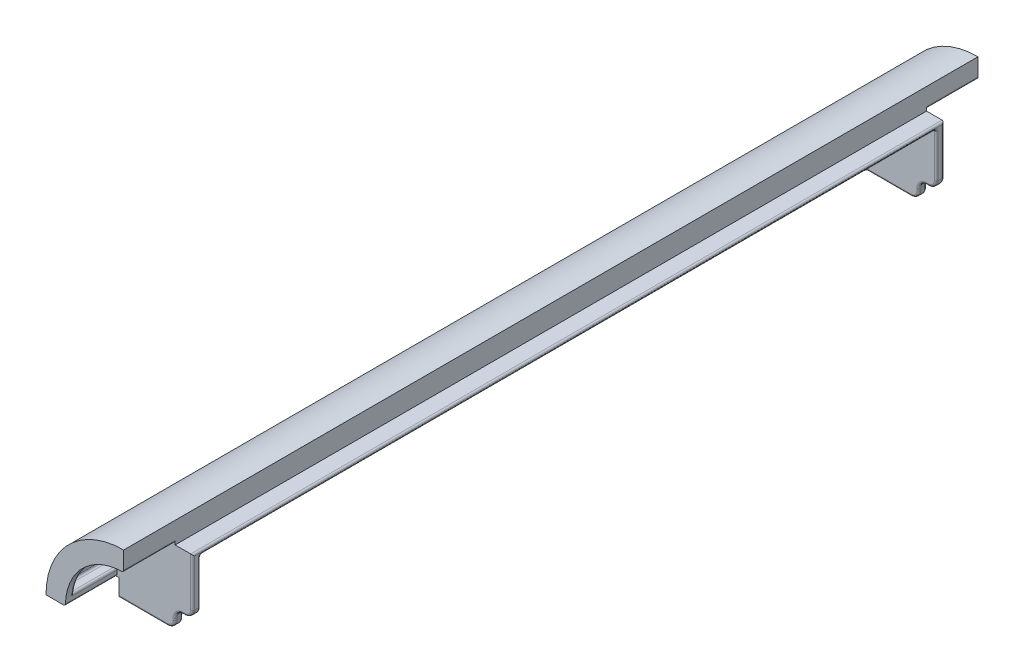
ISO-10303-21;
HEADER;
FILE_DESCRIPTION(('STEP AP214'),'2;1');
FILE_NAME('part.step','',(''),(''),'','','');
FILE_SCHEMA(('AUTOMOTIVE_DESIGN { 1 0 10303 214 1 1 1 1 }'));
ENDSEC;
DATA;
#1=APPLICATION_CONTEXT('core data for automotive mechanical design processes');
#2=APPLICATION_PROTOCOL_DEFINITION('international standard','automotive_design',2000,#1);
#3=PRODUCT_CONTEXT('',#1,'mechanical');
#4=PRODUCT('Part','Part','',(#3));
#5=PRODUCT_RELATED_PRODUCT_CATEGORY('part','',(#4));
#6=PRODUCT_DEFINITION_FORMATION('','',#4);
#7=PRODUCT_DEFINITION_CONTEXT('part definition',#1,'design');
#8=PRODUCT_DEFINITION('design','',#6,#7);
#9=PRODUCT_DEFINITION_SHAPE('','',#8);
#10=(LENGTH_UNIT() NAMED_UNIT(*) SI_UNIT(.MILLI.,.METRE.));
#11=(NAMED_UNIT(*) PLANE_ANGLE_UNIT() SI_UNIT($,.RADIAN.));
#12=(NAMED_UNIT(*) SI_UNIT($,.STERADIAN.) SOLID_ANGLE_UNIT());
#13=UNCERTAINTY_MEASURE_WITH_UNIT(LENGTH_MEASURE(1.E-05),#10,'distance_accuracy_value','');
#14=(GEOMETRIC_REPRESENTATION_CONTEXT(3) GLOBAL_UNCERTAINTY_ASSIGNED_CONTEXT((#13)) GLOBAL_UNIT_ASSIGNED_CONTEXT((#10,
#11,#12)) REPRESENTATION_CONTEXT('',''));
#15=CARTESIAN_POINT('',(0.,0.,0.));
#16=DIRECTION('',(0.,0.,1.));
#17=DIRECTION('',(1.,0.,0.));
#18=AXIS2_PLACEMENT_3D('',#15,#16,#17);
#19=CARTESIAN_POINT('',(4.5,0.,0.));
#20=DIRECTION('',(1.,0.,0.));
#21=DIRECTION('',(0.,0.,-1.));
#22=AXIS2_PLACEMENT_3D('',#19,#20,#21);
#23=PLANE('',#22);
#24=DIRECTION('',(0.,0.,-1.));
#25=VECTOR('',#24,1.);
#26=CARTESIAN_POINT('',(4.5,2.,13.25));
#27=LINE('',#26,#25);
#28=CARTESIAN_POINT('',(4.5,2.,14.75));
#29=VERTEX_POINT('',#28);
#30=CARTESIAN_POINT('',(4.5,2.,13.75));
#31=VERTEX_POINT('',#30);
#32=EDGE_CURVE('E820',#29,#31,#27,.T.);
#33=ORIENTED_EDGE('',*,*,#32,.T.);
#34=DIRECTION('',(0.,1.,0.));
#35=VECTOR('',#34,1.);
#36=CARTESIAN_POINT('',(4.5,0.,13.75));
#37=LINE('',#36,#35);
#38=CARTESIAN_POINT('',(4.5,14.,13.75));
#39=VERTEX_POINT('',#38);
#40=EDGE_CURVE('E1286',#31,#39,#37,.T.);
#41=ORIENTED_EDGE('',*,*,#40,.T.);
#42=DIRECTION('',(0.,0.,1.));
#43=VECTOR('',#42,1.);
#44=CARTESIAN_POINT('',(4.5,14.,206.75));
#45=LINE('',#44,#43);
#46=CARTESIAN_POINT('',(4.5,14.,15.75));
#47=VERTEX_POINT('',#46);
#48=EDGE_CURVE('E1283',#39,#47,#45,.T.);
#49=ORIENTED_EDGE('',*,*,#48,.T.);
#50=CARTESIAN_POINT('',(4.5,13.,15.75));
#51=DIRECTION('',(1.,0.,0.));
#52=DIRECTION('',(0.,0.,-1.));
#53=AXIS2_PLACEMENT_3D('',#50,#51,#52);
#54=CIRCLE('',#53,1.);
#55=CARTESIAN_POINT('',(4.5,13.,14.75));
#56=VERTEX_POINT('',#55);
#57=EDGE_CURVE('E1276',#56,#47,#54,.T.);
#58=ORIENTED_EDGE('',*,*,#57,.F.);
#59=DIRECTION('',(0.,-1.,0.));
#60=VECTOR('',#59,1.);
#61=CARTESIAN_POINT('',(4.5,0.,14.75));
#62=LINE('',#61,#60);
#63=EDGE_CURVE('E1280',#56,#29,#62,.T.);
#64=ORIENTED_EDGE('',*,*,#63,.T.);
#65=EDGE_LOOP('',(#33,#41,#49,#58,#64));
#66=FACE_BOUND('',#65,.T.);
#67=ADVANCED_FACE('F45',(#66),#23,.T.);
#68=CARTESIAN_POINT('',(0.,-4.5,0.));
#69=DIRECTION('',(0.,-1.,0.));
#70=DIRECTION('',(1.,0.,0.));
#71=AXIS2_PLACEMENT_3D('',#68,#69,#70);
#72=PLANE('',#71);
#73=DIRECTION('',(0.,0.,1.));
#74=VECTOR('',#73,1.);
#75=CARTESIAN_POINT('',(-2.,-4.5,15.25));
#76=LINE('',#75,#74);
#77=CARTESIAN_POINT('',(-2.,-4.5,13.75));
#78=VERTEX_POINT('',#77);
#79=CARTESIAN_POINT('',(-2.,-4.5,14.75));
#80=VERTEX_POINT('',#79);
#81=EDGE_CURVE('E812',#78,#80,#76,.T.);
#82=ORIENTED_EDGE('',*,*,#81,.T.);
#83=DIRECTION('',(-1.,0.,0.));
#84=VECTOR('',#83,1.);
#85=CARTESIAN_POINT('',(0.,-4.5,14.75));
#86=LINE('',#85,#84);
#87=CARTESIAN_POINT('',(-13.,-4.50000000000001,14.75));
#88=VERTEX_POINT('',#87);
#89=EDGE_CURVE('E1257',#80,#88,#86,.T.);
#90=ORIENTED_EDGE('',*,*,#89,.T.);
#91=CARTESIAN_POINT('',(-13.,-4.50000000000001,15.75));
#92=DIRECTION('',(0.,-1.,0.));
#93=DIRECTION('',(1.,0.,0.));
#94=AXIS2_PLACEMENT_3D('',#91,#92,#93);
#95=CIRCLE('',#94,1.);
#96=CARTESIAN_POINT('',(-14.,-4.50000000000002,15.75));
#97=VERTEX_POINT('',#96);
#98=EDGE_CURVE('E1253',#97,#88,#95,.T.);
#99=ORIENTED_EDGE('',*,*,#98,.F.);
#100=DIRECTION('',(0.,0.,-1.));
#101=VECTOR('',#100,1.);
#102=CARTESIAN_POINT('',(-14.,-4.50000000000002,13.25));
#103=LINE('',#102,#101);
#104=CARTESIAN_POINT('',(-14.,-4.50000000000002,13.75));
#105=VERTEX_POINT('',#104);
#106=EDGE_CURVE('E1247',#97,#105,#103,.T.);
#107=ORIENTED_EDGE('',*,*,#106,.T.);
#108=DIRECTION('',(1.,0.,0.));
#109=VECTOR('',#108,1.);
#110=CARTESIAN_POINT('',(0.,-4.5,13.75));
#111=LINE('',#110,#109);
#112=EDGE_CURVE('E1250',#105,#78,#111,.T.);
#113=ORIENTED_EDGE('',*,*,#112,.T.);
#114=EDGE_LOOP('',(#82,#90,#99,#107,#113));
#115=FACE_BOUND('',#114,.T.);
#116=ADVANCED_FACE('F1812',(#115),#72,.T.);
#117=CARTESIAN_POINT('',(-26.9814751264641,20.,204.75));
#118=DIRECTION('',(0.,0.,-1.));
#119=DIRECTION('',(-1.,0.,0.));
#120=AXIS2_PLACEMENT_3D('',#117,#118,#119);
#121=PLANE('',#120);
#122=DIRECTION('',(-1.,0.,0.));
#123=VECTOR('',#122,1.);
#124=CARTESIAN_POINT('',(-15.,2.,204.75));
#125=LINE('',#124,#123);
#126=CARTESIAN_POINT('',(-14.8660687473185,2.,204.75));
#127=VERTEX_POINT('',#126);
#128=CARTESIAN_POINT('',(-17.3205080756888,2.,204.75));
#129=VERTEX_POINT('',#128);
#130=EDGE_CURVE('E705',#127,#129,#125,.T.);
#131=ORIENTED_EDGE('',*,*,#130,.T.);
#132=CARTESIAN_POINT('',(-17.3205080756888,2.5,204.75));
#133=DIRECTION('',(0.,0.,-1.));
#134=DIRECTION('',(-1.,0.,0.));
#135=AXIS2_PLACEMENT_3D('',#132,#133,#134);
#136=CIRCLE('',#135,0.5);
#137=CARTESIAN_POINT('',(-17.3848597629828,2.00415843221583,204.75));
#138=VERTEX_POINT('',#137);
#139=EDGE_CURVE('E955',#129,#138,#136,.T.);
#140=ORIENTED_EDGE('',*,*,#139,.T.);
#141=CARTESIAN_POINT('',(0.,0.,204.75));
#142=DIRECTION('',(0.,0.,-1.));
#143=DIRECTION('',(-1.,0.,0.));
#144=AXIS2_PLACEMENT_3D('',#141,#142,#143);
#145=CIRCLE('',#144,17.5);
#146=CARTESIAN_POINT('',(-2.00415843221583,17.3848597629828,204.75));
#147=VERTEX_POINT('',#146);
#148=EDGE_CURVE('E952',#138,#147,#145,.T.);
#149=ORIENTED_EDGE('',*,*,#148,.T.);
#150=CARTESIAN_POINT('',(-2.5,17.3205080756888,204.75));
#151=DIRECTION('',(0.,0.,-1.));
#152=DIRECTION('',(-1.,0.,0.));
#153=AXIS2_PLACEMENT_3D('',#150,#151,#152);
#154=CIRCLE('',#153,0.5);
#155=CARTESIAN_POINT('',(-2.,17.3205080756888,204.75));
#156=VERTEX_POINT('',#155);
#157=EDGE_CURVE('E949',#147,#156,#154,.T.);
#158=ORIENTED_EDGE('',*,*,#157,.T.);
#159=DIRECTION('',(0.,-1.,0.));
#160=VECTOR('',#159,1.);
#161=CARTESIAN_POINT('',(-2.,15.,204.75));
#162=LINE('',#161,#160);
#163=CARTESIAN_POINT('',(-2.,14.8660687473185,204.75));
#164=VERTEX_POINT('',#163);
#165=EDGE_CURVE('E776',#156,#164,#162,.T.);
#166=ORIENTED_EDGE('',*,*,#165,.T.);
#167=CARTESIAN_POINT('',(0.,0.,204.75));
#168=DIRECTION('',(0.,0.,-1.));
#169=DIRECTION('',(-1.,0.,0.));
#170=AXIS2_PLACEMENT_3D('',#167,#168,#169);
#171=CIRCLE('',#170,15.);
#172=CARTESIAN_POINT('',(-1.55172413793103,14.9195225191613,204.75));
#173=VERTEX_POINT('',#172);
#174=EDGE_CURVE('E698',#173,#164,#171,.F.);
#175=ORIENTED_EDGE('',*,*,#174,.F.);
#176=CARTESIAN_POINT('',(-1.5,14.422205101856,204.75));
#177=DIRECTION('',(0.,0.,-1.));
#178=DIRECTION('',(-1.,0.,0.));
#179=AXIS2_PLACEMENT_3D('',#176,#177,#178);
#180=CIRCLE('',#179,0.5);
#181=CARTESIAN_POINT('',(-1.5,14.922205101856,204.75));
#182=VERTEX_POINT('',#181);
#183=EDGE_CURVE('E933',#173,#182,#180,.T.);
#184=ORIENTED_EDGE('',*,*,#183,.T.);
#185=DIRECTION('',(0.,1.,0.));
#186=VECTOR('',#185,1.);
#187=CARTESIAN_POINT('',(-1.5,20.,204.75));
#188=LINE('',#187,#186);
#189=CARTESIAN_POINT('',(-1.5,14.,204.75));
#190=VERTEX_POINT('',#189);
#191=EDGE_CURVE('E930',#182,#190,#188,.F.);
#192=ORIENTED_EDGE('',*,*,#191,.T.);
#193=CARTESIAN_POINT('',(-0.5,14.,204.75));
#194=DIRECTION('',(0.,0.,-1.));
#195=DIRECTION('',(-1.,0.,0.));
#196=AXIS2_PLACEMENT_3D('',#193,#194,#195);
#197=CIRCLE('',#196,1.);
#198=CARTESIAN_POINT('',(-0.5,13.,204.75));
#199=VERTEX_POINT('',#198);
#200=EDGE_CURVE('E926',#199,#190,#197,.T.);
#201=ORIENTED_EDGE('',*,*,#200,.F.);
#202=DIRECTION('',(-1.,0.,0.));
#203=VECTOR('',#202,1.);
#204=CARTESIAN_POINT('',(-26.9814751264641,13.,204.75));
#205=LINE('',#204,#203);
#206=CARTESIAN_POINT('',(4.,13.,204.75));
#207=VERTEX_POINT('',#206);
#208=EDGE_CURVE('E920',#199,#207,#205,.F.);
#209=ORIENTED_EDGE('',*,*,#208,.T.);
#210=DIRECTION('',(0.,1.,0.));
#211=VECTOR('',#210,1.);
#212=CARTESIAN_POINT('',(4.,20.,204.75));
#213=LINE('',#212,#211);
#214=CARTESIAN_POINT('',(4.,1.99999999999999,204.75));
#215=VERTEX_POINT('',#214);
#216=EDGE_CURVE('E902',#207,#215,#213,.F.);
#217=ORIENTED_EDGE('',*,*,#216,.T.);
#218=CARTESIAN_POINT('',(2.5,1.99999999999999,204.75));
#219=DIRECTION('',(0.,0.,-1.));
#220=DIRECTION('',(-1.,0.,0.));
#221=AXIS2_PLACEMENT_3D('',#218,#219,#220);
#222=CIRCLE('',#221,1.5);
#223=CARTESIAN_POINT('',(2.5,0.499999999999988,204.75));
#224=VERTEX_POINT('',#223);
#225=EDGE_CURVE('E905',#215,#224,#222,.T.);
#226=ORIENTED_EDGE('',*,*,#225,.T.);
#227=DIRECTION('',(-1.,0.,0.));
#228=VECTOR('',#227,1.);
#229=CARTESIAN_POINT('',(2.,0.49999999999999,204.75));
#230=LINE('',#229,#228);
#231=CARTESIAN_POINT('',(2.,0.49999999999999,204.75));
#232=VERTEX_POINT('',#231);
#233=EDGE_CURVE('E908',#224,#232,#230,.T.);
#234=ORIENTED_EDGE('',*,*,#233,.T.);
#235=CARTESIAN_POINT('',(2.,-2.00000000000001,204.75));
#236=DIRECTION('',(0.,0.,-1.));
#237=DIRECTION('',(-1.,0.,0.));
#238=AXIS2_PLACEMENT_3D('',#235,#236,#237);
#239=CIRCLE('',#238,2.5);
#240=CARTESIAN_POINT('',(-0.500000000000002,-2.00000000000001,204.75));
#241=VERTEX_POINT('',#240);
#242=EDGE_CURVE('E911',#232,#241,#239,.F.);
#243=ORIENTED_EDGE('',*,*,#242,.T.);
#244=DIRECTION('',(0.,1.,0.));
#245=VECTOR('',#244,1.);
#246=CARTESIAN_POINT('',(-0.500000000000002,-2.5,204.75));
#247=LINE('',#246,#245);
#248=CARTESIAN_POINT('',(-0.500000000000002,-2.5,204.75));
#249=VERTEX_POINT('',#248);
#250=EDGE_CURVE('E914',#241,#249,#247,.F.);
#251=ORIENTED_EDGE('',*,*,#250,.T.);
#252=CARTESIAN_POINT('',(-2.,-2.5,204.75));
#253=DIRECTION('',(0.,0.,-1.));
#254=DIRECTION('',(-1.,0.,0.));
#255=AXIS2_PLACEMENT_3D('',#252,#253,#254);
#256=CIRCLE('',#255,1.5);
#257=CARTESIAN_POINT('',(-2.,-4.,204.75));
#258=VERTEX_POINT('',#257);
#259=EDGE_CURVE('E917',#249,#258,#256,.T.);
#260=ORIENTED_EDGE('',*,*,#259,.T.);
#261=DIRECTION('',(1.,0.,0.));
#262=VECTOR('',#261,1.);
#263=CARTESIAN_POINT('',(-26.9814751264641,-4.00000000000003,204.75));
#264=LINE('',#263,#262);
#265=CARTESIAN_POINT('',(-13.,-4.00000000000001,204.75));
#266=VERTEX_POINT('',#265);
#267=EDGE_CURVE('E923',#258,#266,#264,.F.);
#268=ORIENTED_EDGE('',*,*,#267,.T.);
#269=DIRECTION('',(0.,-1.,0.));
#270=VECTOR('',#269,1.);
#271=CARTESIAN_POINT('',(-13.,20.,204.75));
#272=LINE('',#271,#270);
#273=CARTESIAN_POINT('',(-13.,0.499999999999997,204.75));
#274=VERTEX_POINT('',#273);
#275=EDGE_CURVE('E936',#266,#274,#272,.F.);
#276=ORIENTED_EDGE('',*,*,#275,.T.);
#277=CARTESIAN_POINT('',(-14.,0.499999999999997,204.75));
#278=DIRECTION('',(0.,0.,-1.));
#279=DIRECTION('',(-1.,0.,0.));
#280=AXIS2_PLACEMENT_3D('',#277,#278,#279);
#281=CIRCLE('',#280,1.);
#282=CARTESIAN_POINT('',(-14.,1.5,204.75));
#283=VERTEX_POINT('',#282);
#284=EDGE_CURVE('E939',#283,#274,#281,.T.);
#285=ORIENTED_EDGE('',*,*,#284,.F.);
#286=DIRECTION('',(1.,0.,0.));
#287=VECTOR('',#286,1.);
#288=CARTESIAN_POINT('',(-26.9814751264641,1.5,204.75));
#289=LINE('',#288,#287);
#290=CARTESIAN_POINT('',(-14.922205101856,1.5,204.75));
#291=VERTEX_POINT('',#290);
#292=EDGE_CURVE('E943',#283,#291,#289,.F.);
#293=ORIENTED_EDGE('',*,*,#292,.T.);
#294=CARTESIAN_POINT('',(-14.422205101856,1.5,204.75));
#295=DIRECTION('',(0.,0.,-1.));
#296=DIRECTION('',(-1.,0.,0.));
#297=AXIS2_PLACEMENT_3D('',#294,#295,#296);
#298=CIRCLE('',#297,0.5);
#299=CARTESIAN_POINT('',(-14.9195225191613,1.55172413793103,204.75));
#300=VERTEX_POINT('',#299);
#301=EDGE_CURVE('E946',#291,#300,#298,.T.);
#302=ORIENTED_EDGE('',*,*,#301,.T.);
#303=EDGE_CURVE('E706',#127,#300,#171,.F.);
#304=ORIENTED_EDGE('',*,*,#303,.F.);
#305=EDGE_LOOP('',(#131,#140,#149,#158,#166,#175,#184,#192,#201,#209,#217,#226,#234,#243,#251,
#260,#268,#276,#285,#293,#302,#304));
#306=FACE_BOUND('',#305,.T.);
#307=ADVANCED_FACE('F1819',(#306),#121,.T.);
#308=CARTESIAN_POINT('',(-26.9814751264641,20.,15.25));
#309=DIRECTION('',(0.,0.,1.));
#310=DIRECTION('',(0.,-1.,0.));
#311=AXIS2_PLACEMENT_3D('',#308,#309,#310);
#312=PLANE('',#311);
#313=CARTESIAN_POINT('',(-8.,8.,15.25));
#314=DIRECTION('',(0.,0.,1.));
#315=DIRECTION('',(0.,-1.,0.));
#316=AXIS2_PLACEMENT_3D('',#313,#314,#315);
#317=CIRCLE('',#316,2.5);
#318=CARTESIAN_POINT('',(-8.,5.5,15.25));
#319=VERTEX_POINT('',#318);
#320=EDGE_CURVE('E898',#319,#319,#317,.F.);
#321=ORIENTED_EDGE('',*,*,#320,.T.);
#322=EDGE_LOOP('',(#321));
#323=FACE_BOUND('',#322,.T.);
#324=CARTESIAN_POINT('',(0.,0.,15.25));
#325=DIRECTION('',(0.,0.,1.));
#326=DIRECTION('',(0.,-1.,0.));
#327=AXIS2_PLACEMENT_3D('',#324,#325,#326);
#328=CIRCLE('',#327,17.5);
#329=CARTESIAN_POINT('',(-2.00415843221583,17.3848597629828,15.25));
#330=VERTEX_POINT('',#329);
#331=CARTESIAN_POINT('',(-17.3848597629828,2.00415843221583,15.25));
#332=VERTEX_POINT('',#331);
#333=EDGE_CURVE('E889',#330,#332,#328,.T.);
#334=ORIENTED_EDGE('',*,*,#333,.T.);
#335=CARTESIAN_POINT('',(-17.3205080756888,2.5,15.25));
#336=DIRECTION('',(0.,0.,1.));
#337=DIRECTION('',(0.,-1.,0.));
#338=AXIS2_PLACEMENT_3D('',#335,#336,#337);
#339=CIRCLE('',#338,0.5);
#340=CARTESIAN_POINT('',(-17.3205080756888,2.,15.25));
#341=VERTEX_POINT('',#340);
#342=EDGE_CURVE('E895',#332,#341,#339,.T.);
#343=ORIENTED_EDGE('',*,*,#342,.T.);
#344=DIRECTION('',(1.,0.,0.));
#345=VECTOR('',#344,1.);
#346=CARTESIAN_POINT('',(-15.,2.,15.25));
#347=LINE('',#346,#345);
#348=CARTESIAN_POINT('',(-14.8660687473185,2.,15.25));
#349=VERTEX_POINT('',#348);
#350=EDGE_CURVE('E682',#341,#349,#347,.T.);
#351=ORIENTED_EDGE('',*,*,#350,.T.);
#352=CARTESIAN_POINT('',(0.,0.,15.25));
#353=DIRECTION('',(0.,0.,1.));
#354=DIRECTION('',(0.,-1.,0.));
#355=AXIS2_PLACEMENT_3D('',#352,#353,#354);
#356=CIRCLE('',#355,15.);
#357=CARTESIAN_POINT('',(-14.9195225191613,1.55172413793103,15.25));
#358=VERTEX_POINT('',#357);
#359=EDGE_CURVE('E683',#358,#349,#356,.F.);
#360=ORIENTED_EDGE('',*,*,#359,.F.);
#361=CARTESIAN_POINT('',(-14.422205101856,1.5,15.25));
#362=DIRECTION('',(0.,0.,1.));
#363=DIRECTION('',(0.,-1.,0.));
#364=AXIS2_PLACEMENT_3D('',#361,#362,#363);
#365=CIRCLE('',#364,0.5);
#366=CARTESIAN_POINT('',(-14.922205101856,1.5,15.25));
#367=VERTEX_POINT('',#366);
#368=EDGE_CURVE('E883',#358,#367,#365,.T.);
#369=ORIENTED_EDGE('',*,*,#368,.T.);
#370=DIRECTION('',(-1.,0.,0.));
#371=VECTOR('',#370,1.);
#372=CARTESIAN_POINT('',(-26.9814751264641,1.5,15.25));
#373=LINE('',#372,#371);
#374=CARTESIAN_POINT('',(-14.,1.5,15.25));
#375=VERTEX_POINT('',#374);
#376=EDGE_CURVE('E877',#367,#375,#373,.F.);
#377=ORIENTED_EDGE('',*,*,#376,.T.);
#378=CARTESIAN_POINT('',(-14.,0.499999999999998,15.25));
#379=DIRECTION('',(0.,0.,1.));
#380=DIRECTION('',(0.,-1.,0.));
#381=AXIS2_PLACEMENT_3D('',#378,#379,#380);
#382=CIRCLE('',#381,1.);
#383=CARTESIAN_POINT('',(-13.,0.499999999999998,15.25));
#384=VERTEX_POINT('',#383);
#385=EDGE_CURVE('E873',#384,#375,#382,.T.);
#386=ORIENTED_EDGE('',*,*,#385,.F.);
#387=DIRECTION('',(0.,1.,0.));
#388=VECTOR('',#387,1.);
#389=CARTESIAN_POINT('',(-13.,20.,15.25));
#390=LINE('',#389,#388);
#391=CARTESIAN_POINT('',(-13.,-4.00000000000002,15.25));
#392=VERTEX_POINT('',#391);
#393=EDGE_CURVE('E866',#384,#392,#390,.F.);
#394=ORIENTED_EDGE('',*,*,#393,.T.);
#395=DIRECTION('',(-1.,0.,0.));
#396=VECTOR('',#395,1.);
#397=CARTESIAN_POINT('',(-26.9814751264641,-4.00000000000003,15.25));
#398=LINE('',#397,#396);
#399=CARTESIAN_POINT('',(-2.,-4.,15.25));
#400=VERTEX_POINT('',#399);
#401=EDGE_CURVE('E863',#392,#400,#398,.F.);
#402=ORIENTED_EDGE('',*,*,#401,.T.);
#403=CARTESIAN_POINT('',(-2.,-2.5,15.25));
#404=DIRECTION('',(0.,0.,1.));
#405=DIRECTION('',(0.,-1.,0.));
#406=AXIS2_PLACEMENT_3D('',#403,#404,#405);
#407=CIRCLE('',#406,1.5);
#408=CARTESIAN_POINT('',(-0.500000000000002,-2.5,15.25));
#409=VERTEX_POINT('',#408);
#410=EDGE_CURVE('E856',#400,#409,#407,.T.);
#411=ORIENTED_EDGE('',*,*,#410,.T.);
#412=DIRECTION('',(0.,-1.,0.));
#413=VECTOR('',#412,1.);
#414=CARTESIAN_POINT('',(-0.500000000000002,-2.,15.25));
#415=LINE('',#414,#413);
#416=CARTESIAN_POINT('',(-0.500000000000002,-2.,15.25));
#417=VERTEX_POINT('',#416);
#418=EDGE_CURVE('E853',#409,#417,#415,.F.);
#419=ORIENTED_EDGE('',*,*,#418,.T.);
#420=CARTESIAN_POINT('',(2.,-2.,15.25));
#421=DIRECTION('',(0.,0.,1.));
#422=DIRECTION('',(0.,-1.,0.));
#423=AXIS2_PLACEMENT_3D('',#420,#421,#422);
#424=CIRCLE('',#423,2.5);
#425=CARTESIAN_POINT('',(2.,0.500000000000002,15.25));
#426=VERTEX_POINT('',#425);
#427=EDGE_CURVE('E850',#417,#426,#424,.F.);
#428=ORIENTED_EDGE('',*,*,#427,.T.);
#429=DIRECTION('',(-1.,0.,0.));
#430=VECTOR('',#429,1.);
#431=CARTESIAN_POINT('',(2.5,0.500000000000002,15.25));
#432=LINE('',#431,#430);
#433=CARTESIAN_POINT('',(2.5,0.500000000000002,15.25));
#434=VERTEX_POINT('',#433);
#435=EDGE_CURVE('E847',#426,#434,#432,.F.);
#436=ORIENTED_EDGE('',*,*,#435,.T.);
#437=CARTESIAN_POINT('',(2.5,2.,15.25));
#438=DIRECTION('',(0.,0.,1.));
#439=DIRECTION('',(0.,-1.,0.));
#440=AXIS2_PLACEMENT_3D('',#437,#438,#439);
#441=CIRCLE('',#440,1.5);
#442=CARTESIAN_POINT('',(4.,2.,15.25));
#443=VERTEX_POINT('',#442);
#444=EDGE_CURVE('E844',#434,#443,#441,.T.);
#445=ORIENTED_EDGE('',*,*,#444,.T.);
#446=DIRECTION('',(0.,-1.,0.));
#447=VECTOR('',#446,1.);
#448=CARTESIAN_POINT('',(4.,20.,15.25));
#449=LINE('',#448,#447);
#450=CARTESIAN_POINT('',(4.,13.,15.25));
#451=VERTEX_POINT('',#450);
#452=EDGE_CURVE('E841',#443,#451,#449,.F.);
#453=ORIENTED_EDGE('',*,*,#452,.T.);
#454=DIRECTION('',(1.,0.,0.));
#455=VECTOR('',#454,1.);
#456=CARTESIAN_POINT('',(-26.9814751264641,13.,15.25));
#457=LINE('',#456,#455);
#458=CARTESIAN_POINT('',(-0.5,13.,15.25));
#459=VERTEX_POINT('',#458);
#460=EDGE_CURVE('E859',#451,#459,#457,.F.);
#461=ORIENTED_EDGE('',*,*,#460,.T.);
#462=CARTESIAN_POINT('',(-0.5,14.,15.25));
#463=DIRECTION('',(0.,0.,1.));
#464=DIRECTION('',(0.,-1.,0.));
#465=AXIS2_PLACEMENT_3D('',#462,#463,#464);
#466=CIRCLE('',#465,1.);
#467=CARTESIAN_POINT('',(-1.5,14.,15.25));
#468=VERTEX_POINT('',#467);
#469=EDGE_CURVE('E869',#468,#459,#466,.T.);
#470=ORIENTED_EDGE('',*,*,#469,.F.);
#471=DIRECTION('',(0.,-1.,0.));
#472=VECTOR('',#471,1.);
#473=CARTESIAN_POINT('',(-1.5,20.,15.25));
#474=LINE('',#473,#472);
#475=CARTESIAN_POINT('',(-1.5,14.922205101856,15.25));
#476=VERTEX_POINT('',#475);
#477=EDGE_CURVE('E880',#468,#476,#474,.F.);
#478=ORIENTED_EDGE('',*,*,#477,.T.);
#479=CARTESIAN_POINT('',(-1.5,14.422205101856,15.25));
#480=DIRECTION('',(0.,0.,1.));
#481=DIRECTION('',(0.,-1.,0.));
#482=AXIS2_PLACEMENT_3D('',#479,#480,#481);
#483=CIRCLE('',#482,0.5);
#484=CARTESIAN_POINT('',(-1.55172413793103,14.9195225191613,15.25));
#485=VERTEX_POINT('',#484);
#486=EDGE_CURVE('E886',#476,#485,#483,.T.);
#487=ORIENTED_EDGE('',*,*,#486,.T.);
#488=CARTESIAN_POINT('',(-2.,14.8660687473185,15.25));
#489=VERTEX_POINT('',#488);
#490=EDGE_CURVE('E678',#489,#485,#356,.F.);
#491=ORIENTED_EDGE('',*,*,#490,.F.);
#492=DIRECTION('',(0.,1.,0.));
#493=VECTOR('',#492,1.);
#494=CARTESIAN_POINT('',(-2.,15.,15.25));
#495=LINE('',#494,#493);
#496=CARTESIAN_POINT('',(-2.,17.3205080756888,15.25));
#497=VERTEX_POINT('',#496);
#498=EDGE_CURVE('E674',#489,#497,#495,.T.);
#499=ORIENTED_EDGE('',*,*,#498,.T.);
#500=CARTESIAN_POINT('',(-2.5,17.3205080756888,15.25));
#501=DIRECTION('',(0.,0.,1.));
#502=DIRECTION('',(0.,-1.,0.));
#503=AXIS2_PLACEMENT_3D('',#500,#501,#502);
#504=CIRCLE('',#503,0.5);
#505=EDGE_CURVE('E892',#497,#330,#504,.T.);
#506=ORIENTED_EDGE('',*,*,#505,.T.);
#507=EDGE_LOOP('',(#334,#343,#351,#360,#369,#377,#386,#394,#402,#411,#419,#428,#436,#445,#453,
#461,#470,#478,#487,#491,#499,#506));
#508=FACE_BOUND('',#507,.T.);
#509=ADVANCED_FACE('F2185',(#323,#508),#312,.T.);
#510=CARTESIAN_POINT('',(0.,0.,220.));
#511=DIRECTION('',(0.,0.,-1.));
#512=DIRECTION('',(-1.,0.,0.));
#513=AXIS2_PLACEMENT_3D('',#510,#511,#512);
#514=CYLINDRICAL_SURFACE('',#513,15.);
#515=ORIENTED_EDGE('',*,*,#490,.T.);
#516=DIRECTION('',(0.,0.,-1.));
#517=VECTOR('',#516,1.);
#518=CARTESIAN_POINT('',(-1.55172413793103,14.9195225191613,220.));
#519=LINE('',#518,#517);
#520=EDGE_CURVE('E1215',#485,#173,#519,.F.);
#521=ORIENTED_EDGE('',*,*,#520,.T.);
#522=ORIENTED_EDGE('',*,*,#174,.T.);
#523=DIRECTION('',(0.,0.,-1.));
#524=VECTOR('',#523,1.);
#525=CARTESIAN_POINT('',(-2.,14.8660687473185,218.));
#526=LINE('',#525,#524);
#527=EDGE_CURVE('E723',#164,#489,#526,.T.);
#528=ORIENTED_EDGE('',*,*,#527,.T.);
#529=EDGE_LOOP('',(#515,#521,#522,#528));
#530=FACE_BOUND('',#529,.T.);
#531=ADVANCED_FACE('F2196',(#530),#514,.F.);
#532=ORIENTED_EDGE('',*,*,#303,.T.);
#533=DIRECTION('',(0.,0.,-1.));
#534=VECTOR('',#533,1.);
#535=CARTESIAN_POINT('',(-14.9195225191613,1.55172413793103,220.));
#536=LINE('',#535,#534);
#537=EDGE_CURVE('E1231',#300,#358,#536,.T.);
#538=ORIENTED_EDGE('',*,*,#537,.T.);
#539=ORIENTED_EDGE('',*,*,#359,.T.);
#540=DIRECTION('',(0.,0.,-1.));
#541=VECTOR('',#540,1.);
#542=CARTESIAN_POINT('',(-14.8660687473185,2.,218.));
#543=LINE('',#542,#541);
#544=EDGE_CURVE('E727',#127,#349,#543,.T.);
#545=ORIENTED_EDGE('',*,*,#544,.F.);
#546=EDGE_LOOP('',(#532,#538,#539,#545));
#547=FACE_BOUND('',#546,.T.);
#548=ADVANCED_FACE('F2070',(#547),#514,.F.);
#549=CARTESIAN_POINT('',(0.,15.,220.));
#550=DIRECTION('',(-1.,0.,0.));
#551=DIRECTION('',(0.,0.,1.));
#552=AXIS2_PLACEMENT_3D('',#549,#550,#551);
#553=PLANE('',#552);
#554=DIRECTION('',(0.,0.,1.));
#555=VECTOR('',#554,1.);
#556=CARTESIAN_POINT('',(0.,-2.5,13.25));
#557=LINE('',#556,#555);
#558=CARTESIAN_POINT('',(0.,-2.5,14.75));
#559=VERTEX_POINT('',#558);
#560=CARTESIAN_POINT('',(0.,-2.5,13.75));
#561=VERTEX_POINT('',#560);
#562=EDGE_CURVE('E804',#559,#561,#557,.F.);
#563=ORIENTED_EDGE('',*,*,#562,.T.);
#564=DIRECTION('',(0.,1.,0.));
#565=VECTOR('',#564,1.);
#566=CARTESIAN_POINT('',(0.,-2.,13.75));
#567=LINE('',#566,#565);
#568=CARTESIAN_POINT('',(0.,-2.,13.75));
#569=VERTEX_POINT('',#568);
#570=EDGE_CURVE('E1016',#561,#569,#567,.T.);
#571=ORIENTED_EDGE('',*,*,#570,.T.);
#572=DIRECTION('',(0.,0.,-1.));
#573=VECTOR('',#572,1.);
#574=CARTESIAN_POINT('',(0.,-2.,15.25));
#575=LINE('',#574,#573);
#576=CARTESIAN_POINT('',(0.,-2.,14.75));
#577=VERTEX_POINT('',#576);
#578=EDGE_CURVE('E808',#569,#577,#575,.F.);
#579=ORIENTED_EDGE('',*,*,#578,.T.);
#580=DIRECTION('',(0.,-1.,0.));
#581=VECTOR('',#580,1.);
#582=CARTESIAN_POINT('',(0.,-2.5,14.75));
#583=LINE('',#582,#581);
#584=EDGE_CURVE('E1013',#577,#559,#583,.T.);
#585=ORIENTED_EDGE('',*,*,#584,.T.);
#586=EDGE_LOOP('',(#563,#571,#579,#585));
#587=FACE_BOUND('',#586,.T.);
#588=ADVANCED_FACE('F2005',(#587),#553,.F.);
#589=DIRECTION('',(0.,1.,0.));
#590=VECTOR('',#589,1.);
#591=CARTESIAN_POINT('',(0.,15.,220.));
#592=LINE('',#591,#590);
#593=CARTESIAN_POINT('',(0.,15.4919333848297,220.));
#594=VERTEX_POINT('',#593);
#595=CARTESIAN_POINT('',(0.,20.,220.));
#596=VERTEX_POINT('',#595);
#597=EDGE_CURVE('E748',#594,#596,#592,.T.);
#598=ORIENTED_EDGE('',*,*,#597,.F.);
#599=DIRECTION('',(0.,0.,-1.));
#600=VECTOR('',#599,1.);
#601=CARTESIAN_POINT('',(0.,15.4919333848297,220.));
#602=LINE('',#601,#600);
#603=CARTESIAN_POINT('',(0.,15.4919333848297,206.75));
#604=VERTEX_POINT('',#603);
#605=EDGE_CURVE('E1294',#594,#604,#602,.T.);
#606=ORIENTED_EDGE('',*,*,#605,.T.);
#607=DIRECTION('',(0.,-1.,0.));
#608=VECTOR('',#607,1.);
#609=CARTESIAN_POINT('',(0.,20.,206.75));
#610=LINE('',#609,#608);
#611=CARTESIAN_POINT('',(0.,14.5,206.75));
#612=VERTEX_POINT('',#611);
#613=EDGE_CURVE('E640',#604,#612,#610,.T.);
#614=ORIENTED_EDGE('',*,*,#613,.T.);
#615=DIRECTION('',(0.,0.,1.));
#616=VECTOR('',#615,1.);
#617=CARTESIAN_POINT('',(0.,14.5,206.75));
#618=LINE('',#617,#616);
#619=CARTESIAN_POINT('',(0.,14.5,13.25));
#620=VERTEX_POINT('',#619);
#621=EDGE_CURVE('E623',#620,#612,#618,.T.);
#622=ORIENTED_EDGE('',*,*,#621,.F.);
#623=DIRECTION('',(0.,1.,0.));
#624=VECTOR('',#623,1.);
#625=CARTESIAN_POINT('',(0.,20.,13.25));
#626=LINE('',#625,#624);
#627=CARTESIAN_POINT('',(0.,15.4919333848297,13.25));
#628=VERTEX_POINT('',#627);
#629=EDGE_CURVE('E637',#620,#628,#626,.T.);
#630=ORIENTED_EDGE('',*,*,#629,.T.);
#631=DIRECTION('',(0.,0.,-1.));
#632=VECTOR('',#631,1.);
#633=CARTESIAN_POINT('',(0.,15.4919333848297,220.));
#634=LINE('',#633,#632);
#635=CARTESIAN_POINT('',(0.,15.4919333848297,0.));
#636=VERTEX_POINT('',#635);
#637=EDGE_CURVE('E1291',#628,#636,#634,.T.);
#638=ORIENTED_EDGE('',*,*,#637,.T.);
#639=DIRECTION('',(0.,1.,0.));
#640=VECTOR('',#639,1.);
#641=CARTESIAN_POINT('',(0.,15.,0.));
#642=LINE('',#641,#640);
#643=CARTESIAN_POINT('',(0.,20.,0.));
#644=VERTEX_POINT('',#643);
#645=EDGE_CURVE('E740',#636,#644,#642,.T.);
#646=ORIENTED_EDGE('',*,*,#645,.T.);
#647=DIRECTION('',(0.,0.,-1.));
#648=VECTOR('',#647,1.);
#649=CARTESIAN_POINT('',(0.,20.,220.));
#650=LINE('',#649,#648);
#651=EDGE_CURVE('E751',#596,#644,#650,.T.);
#652=ORIENTED_EDGE('',*,*,#651,.F.);
#653=EDGE_LOOP('',(#598,#606,#614,#622,#630,#638,#646,#652));
#654=FACE_BOUND('',#653,.T.);
#655=ADVANCED_FACE('F635',(#654),#553,.F.);
#656=DIRECTION('',(0.,0.,1.));
#657=VECTOR('',#656,1.);
#658=CARTESIAN_POINT('',(0.,-2.5,204.75));
#659=LINE('',#658,#657);
#660=CARTESIAN_POINT('',(0.,-2.5,206.25));
#661=VERTEX_POINT('',#660);
#662=CARTESIAN_POINT('',(0.,-2.5,205.25));
#663=VERTEX_POINT('',#662);
#664=EDGE_CURVE('E788',#661,#663,#659,.F.);
#665=ORIENTED_EDGE('',*,*,#664,.T.);
#666=DIRECTION('',(0.,1.,0.));
#667=VECTOR('',#666,1.);
#668=CARTESIAN_POINT('',(0.,-2.00000000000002,205.25));
#669=LINE('',#668,#667);
#670=CARTESIAN_POINT('',(0.,-2.00000000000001,205.25));
#671=VERTEX_POINT('',#670);
#672=EDGE_CURVE('E1047',#663,#671,#669,.T.);
#673=ORIENTED_EDGE('',*,*,#672,.T.);
#674=DIRECTION('',(0.,0.,-1.));
#675=VECTOR('',#674,1.);
#676=CARTESIAN_POINT('',(0.,-2.,206.75));
#677=LINE('',#676,#675);
#678=CARTESIAN_POINT('',(0.,-2.,206.25));
#679=VERTEX_POINT('',#678);
#680=EDGE_CURVE('E792',#671,#679,#677,.F.);
#681=ORIENTED_EDGE('',*,*,#680,.T.);
#682=DIRECTION('',(0.,-1.,0.));
#683=VECTOR('',#682,1.);
#684=CARTESIAN_POINT('',(0.,-2.5,206.25));
#685=LINE('',#684,#683);
#686=EDGE_CURVE('E1044',#679,#661,#685,.T.);
#687=ORIENTED_EDGE('',*,*,#686,.T.);
#688=EDGE_LOOP('',(#665,#673,#681,#687));
#689=FACE_BOUND('',#688,.T.);
#690=ADVANCED_FACE('F1891',(#689),#553,.F.);
#691=CARTESIAN_POINT('',(-15.,0.,220.));
#692=DIRECTION('',(0.,1.,0.));
#693=DIRECTION('',(-1.,0.,0.));
#694=AXIS2_PLACEMENT_3D('',#691,#692,#693);
#695=PLANE('',#694);
#696=DIRECTION('',(1.,0.,0.));
#697=VECTOR('',#696,1.);
#698=CARTESIAN_POINT('',(-26.9814751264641,0.,206.75));
#699=LINE('',#698,#697);
#700=CARTESIAN_POINT('',(-15.4919333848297,0.,206.75));
#701=VERTEX_POINT('',#700);
#702=CARTESIAN_POINT('',(-14.5,0.,206.75));
#703=VERTEX_POINT('',#702);
#704=EDGE_CURVE('E689',#701,#703,#699,.T.);
#705=ORIENTED_EDGE('',*,*,#704,.F.);
#706=DIRECTION('',(0.,0.,-1.));
#707=VECTOR('',#706,1.);
#708=CARTESIAN_POINT('',(-15.4919333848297,0.,220.));
#709=LINE('',#708,#707);
#710=CARTESIAN_POINT('',(-15.4919333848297,0.,220.));
#711=VERTEX_POINT('',#710);
#712=EDGE_CURVE('E1323',#701,#711,#709,.F.);
#713=ORIENTED_EDGE('',*,*,#712,.T.);
#714=DIRECTION('',(1.,0.,0.));
#715=VECTOR('',#714,1.);
#716=CARTESIAN_POINT('',(-15.,0.,220.));
#717=LINE('',#716,#715);
#718=CARTESIAN_POINT('',(-20.,0.,220.));
#719=VERTEX_POINT('',#718);
#720=EDGE_CURVE('E739',#719,#711,#717,.T.);
#721=ORIENTED_EDGE('',*,*,#720,.F.);
#722=DIRECTION('',(0.,0.,-1.));
#723=VECTOR('',#722,1.);
#724=CARTESIAN_POINT('',(-20.,0.,220.));
#725=LINE('',#724,#723);
#726=CARTESIAN_POINT('',(-20.,0.,0.));
#727=VERTEX_POINT('',#726);
#728=EDGE_CURVE('E768',#719,#727,#725,.T.);
#729=ORIENTED_EDGE('',*,*,#728,.T.);
#730=DIRECTION('',(1.,0.,0.));
#731=VECTOR('',#730,1.);
#732=CARTESIAN_POINT('',(-15.,0.,0.));
#733=LINE('',#732,#731);
#734=CARTESIAN_POINT('',(-15.4919333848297,0.,0.));
#735=VERTEX_POINT('',#734);
#736=EDGE_CURVE('E755',#727,#735,#733,.T.);
#737=ORIENTED_EDGE('',*,*,#736,.T.);
#738=DIRECTION('',(0.,0.,-1.));
#739=VECTOR('',#738,1.);
#740=CARTESIAN_POINT('',(-15.4919333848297,0.,220.));
#741=LINE('',#740,#739);
#742=CARTESIAN_POINT('',(-15.4919333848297,0.,13.25));
#743=VERTEX_POINT('',#742);
#744=EDGE_CURVE('E1319',#735,#743,#741,.F.);
#745=ORIENTED_EDGE('',*,*,#744,.T.);
#746=DIRECTION('',(1.,0.,0.));
#747=VECTOR('',#746,1.);
#748=CARTESIAN_POINT('',(-26.9814751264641,0.,13.25));
#749=LINE('',#748,#747);
#750=CARTESIAN_POINT('',(-14.5,0.,13.25));
#751=VERTEX_POINT('',#750);
#752=EDGE_CURVE('E650',#743,#751,#749,.T.);
#753=ORIENTED_EDGE('',*,*,#752,.T.);
#754=DIRECTION('',(0.,0.,-1.));
#755=VECTOR('',#754,1.);
#756=CARTESIAN_POINT('',(-14.5,0.,206.75));
#757=LINE('',#756,#755);
#758=EDGE_CURVE('E658',#703,#751,#757,.T.);
#759=ORIENTED_EDGE('',*,*,#758,.F.);
#760=EDGE_LOOP('',(#705,#713,#721,#729,#737,#745,#753,#759));
#761=FACE_BOUND('',#760,.T.);
#762=ADVANCED_FACE('F2092',(#761),#695,.F.);
#763=CARTESIAN_POINT('',(0.,0.,220.));
#764=DIRECTION('',(0.,0.,-1.));
#765=DIRECTION('',(-1.,0.,0.));
#766=AXIS2_PLACEMENT_3D('',#763,#764,#765);
#767=CYLINDRICAL_SURFACE('',#766,18.);
#768=CARTESIAN_POINT('',(0.,0.,204.25));
#769=DIRECTION('',(0.,0.,-1.));
#770=DIRECTION('',(-1.,0.,0.));
#771=AXIS2_PLACEMENT_3D('',#768,#769,#770);
#772=CIRCLE('',#771,18.);
#773=CARTESIAN_POINT('',(-2.57142857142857,17.8153797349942,204.25));
#774=VERTEX_POINT('',#773);
#775=CARTESIAN_POINT('',(-17.8153797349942,2.57142857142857,204.25));
#776=VERTEX_POINT('',#775);
#777=EDGE_CURVE('E1188',#774,#776,#772,.F.);
#778=ORIENTED_EDGE('',*,*,#777,.T.);
#779=DIRECTION('',(0.,0.,-1.));
#780=VECTOR('',#779,1.);
#781=CARTESIAN_POINT('',(-17.8153797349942,2.57142857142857,220.));
#782=LINE('',#781,#780);
#783=CARTESIAN_POINT('',(-17.8153797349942,2.57142857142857,15.75));
#784=VERTEX_POINT('',#783);
#785=EDGE_CURVE('E1191',#776,#784,#782,.T.);
#786=ORIENTED_EDGE('',*,*,#785,.T.);
#787=CARTESIAN_POINT('',(0.,0.,15.75));
#788=DIRECTION('',(0.,0.,1.));
#789=DIRECTION('',(0.,-1.,0.));
#790=AXIS2_PLACEMENT_3D('',#787,#788,#789);
#791=CIRCLE('',#790,18.);
#792=CARTESIAN_POINT('',(-2.57142857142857,17.8153797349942,15.75));
#793=VERTEX_POINT('',#792);
#794=EDGE_CURVE('E1182',#784,#793,#791,.F.);
#795=ORIENTED_EDGE('',*,*,#794,.T.);
#796=DIRECTION('',(0.,0.,-1.));
#797=VECTOR('',#796,1.);
#798=CARTESIAN_POINT('',(-2.57142857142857,17.8153797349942,220.));
#799=LINE('',#798,#797);
#800=EDGE_CURVE('E1185',#793,#774,#799,.F.);
#801=ORIENTED_EDGE('',*,*,#800,.T.);
#802=EDGE_LOOP('',(#778,#786,#795,#801));
#803=FACE_BOUND('',#802,.T.);
#804=ADVANCED_FACE('F2175',(#803),#767,.F.);
#805=CARTESIAN_POINT('',(-15.,2.,220.));
#806=DIRECTION('',(0.,1.,0.));
#807=DIRECTION('',(-1.,0.,0.));
#808=AXIS2_PLACEMENT_3D('',#805,#806,#807);
#809=PLANE('',#808);
#810=ORIENTED_EDGE('',*,*,#350,.F.);
#811=DIRECTION('',(0.,0.,1.));
#812=VECTOR('',#811,1.);
#813=CARTESIAN_POINT('',(-17.3205080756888,2.,204.75));
#814=LINE('',#813,#812);
#815=EDGE_CURVE('E1195',#341,#129,#814,.T.);
#816=ORIENTED_EDGE('',*,*,#815,.T.);
#817=ORIENTED_EDGE('',*,*,#130,.F.);
#818=ORIENTED_EDGE('',*,*,#544,.T.);
#819=EDGE_LOOP('',(#810,#816,#817,#818));
#820=FACE_BOUND('',#819,.T.);
#821=ADVANCED_FACE('F2183',(#820),#809,.T.);
#822=CARTESIAN_POINT('',(-2.,15.,220.));
#823=DIRECTION('',(-1.,0.,0.));
#824=DIRECTION('',(0.,0.,1.));
#825=AXIS2_PLACEMENT_3D('',#822,#823,#824);
#826=PLANE('',#825);
#827=ORIENTED_EDGE('',*,*,#165,.F.);
#828=DIRECTION('',(0.,0.,1.));
#829=VECTOR('',#828,1.);
#830=CARTESIAN_POINT('',(-2.,17.3205080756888,15.25));
#831=LINE('',#830,#829);
#832=EDGE_CURVE('E1199',#156,#497,#831,.F.);
#833=ORIENTED_EDGE('',*,*,#832,.T.);
#834=ORIENTED_EDGE('',*,*,#498,.F.);
#835=ORIENTED_EDGE('',*,*,#527,.F.);
#836=EDGE_LOOP('',(#827,#833,#834,#835));
#837=FACE_BOUND('',#836,.T.);
#838=ADVANCED_FACE('F2194',(#837),#826,.T.);
#839=CARTESIAN_POINT('',(0.,0.,0.));
#840=DIRECTION('',(0.,0.,-1.));
#841=DIRECTION('',(1.,0.,0.));
#842=AXIS2_PLACEMENT_3D('',#839,#840,#841);
#843=CIRCLE('',#842,15.);
#844=CARTESIAN_POINT('',(-14.9921935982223,0.483870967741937,0.));
#845=VERTEX_POINT('',#844);
#846=CARTESIAN_POINT('',(-0.483870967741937,14.9921935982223,0.));
#847=VERTEX_POINT('',#846);
#848=EDGE_CURVE('E759',#845,#847,#843,.T.);
#849=ORIENTED_EDGE('',*,*,#848,.T.);
#850=DIRECTION('',(0.,0.,-1.));
#851=VECTOR('',#850,1.);
#852=CARTESIAN_POINT('',(-0.483870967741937,14.9921935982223,220.));
#853=LINE('',#852,#851);
#854=CARTESIAN_POINT('',(-0.483870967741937,14.9921935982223,13.25));
#855=VERTEX_POINT('',#854);
#856=EDGE_CURVE('E1346',#847,#855,#853,.F.);
#857=ORIENTED_EDGE('',*,*,#856,.T.);
#858=CARTESIAN_POINT('',(0.,0.,13.25));
#859=DIRECTION('',(0.,0.,-1.));
#860=DIRECTION('',(-1.,0.,0.));
#861=AXIS2_PLACEMENT_3D('',#858,#859,#860);
#862=CIRCLE('',#861,15.);
#863=CARTESIAN_POINT('',(-1.45161290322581,14.9295954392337,13.25));
#864=VERTEX_POINT('',#863);
#865=EDGE_CURVE('E665',#855,#864,#862,.F.);
#866=ORIENTED_EDGE('',*,*,#865,.T.);
#867=DIRECTION('',(0.,0.,-1.));
#868=VECTOR('',#867,1.);
#869=CARTESIAN_POINT('',(-1.45161290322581,14.9295954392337,220.));
#870=LINE('',#869,#868);
#871=CARTESIAN_POINT('',(-1.45161290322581,14.9295954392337,1.5));
#872=VERTEX_POINT('',#871);
#873=EDGE_CURVE('E1342',#864,#872,#870,.T.);
#874=ORIENTED_EDGE('',*,*,#873,.T.);
#875=CARTESIAN_POINT('',(0.,0.,1.5));
#876=DIRECTION('',(0.,0.,1.));
#877=DIRECTION('',(1.,0.,0.));
#878=AXIS2_PLACEMENT_3D('',#875,#876,#877);
#879=CIRCLE('',#878,15.);
#880=CARTESIAN_POINT('',(-14.9295954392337,1.45161290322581,1.5));
#881=VERTEX_POINT('',#880);
#882=EDGE_CURVE('E1339',#872,#881,#879,.T.);
#883=ORIENTED_EDGE('',*,*,#882,.T.);
#884=DIRECTION('',(0.,0.,-1.));
#885=VECTOR('',#884,1.);
#886=CARTESIAN_POINT('',(-14.9295954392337,1.45161290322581,220.));
#887=LINE('',#886,#885);
#888=CARTESIAN_POINT('',(-14.9295954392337,1.45161290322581,13.25));
#889=VERTEX_POINT('',#888);
#890=EDGE_CURVE('E1336',#881,#889,#887,.F.);
#891=ORIENTED_EDGE('',*,*,#890,.T.);
#892=CARTESIAN_POINT('',(-14.9921935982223,0.483870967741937,13.25));
#893=VERTEX_POINT('',#892);
#894=EDGE_CURVE('E670',#889,#893,#862,.F.);
#895=ORIENTED_EDGE('',*,*,#894,.T.);
#896=DIRECTION('',(0.,0.,-1.));
#897=VECTOR('',#896,1.);
#898=CARTESIAN_POINT('',(-14.9921935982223,0.483870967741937,220.));
#899=LINE('',#898,#897);
#900=EDGE_CURVE('E1332',#893,#845,#899,.T.);
#901=ORIENTED_EDGE('',*,*,#900,.T.);
#902=EDGE_LOOP('',(#849,#857,#866,#874,#883,#891,#895,#901));
#903=FACE_BOUND('',#902,.T.);
#904=ADVANCED_FACE('F2081',(#903),#514,.F.);
#905=CARTESIAN_POINT('',(0.,0.,2.5));
#906=DIRECTION('',(0.,0.,1.));
#907=DIRECTION('',(1.,0.,0.));
#908=AXIS2_PLACEMENT_3D('',#905,#906,#907);
#909=CIRCLE('',#908,18.);
#910=CARTESIAN_POINT('',(-17.8153797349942,2.57142857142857,2.5));
#911=VERTEX_POINT('',#910);
#912=CARTESIAN_POINT('',(-2.57142857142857,17.8153797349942,2.5));
#913=VERTEX_POINT('',#912);
#914=EDGE_CURVE('E1122',#911,#913,#909,.F.);
#915=ORIENTED_EDGE('',*,*,#914,.T.);
#916=DIRECTION('',(0.,0.,-1.));
#917=VECTOR('',#916,1.);
#918=CARTESIAN_POINT('',(-2.57142857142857,17.8153797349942,220.));
#919=LINE('',#918,#917);
#920=CARTESIAN_POINT('',(-2.57142857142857,17.8153797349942,12.75));
#921=VERTEX_POINT('',#920);
#922=EDGE_CURVE('E1125',#913,#921,#919,.F.);
#923=ORIENTED_EDGE('',*,*,#922,.T.);
#924=CARTESIAN_POINT('',(0.,0.,12.75));
#925=DIRECTION('',(0.,0.,-1.));
#926=DIRECTION('',(-1.,0.,0.));
#927=AXIS2_PLACEMENT_3D('',#924,#925,#926);
#928=CIRCLE('',#927,18.);
#929=CARTESIAN_POINT('',(-17.8153797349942,2.57142857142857,12.75));
#930=VERTEX_POINT('',#929);
#931=EDGE_CURVE('E1116',#921,#930,#928,.F.);
#932=ORIENTED_EDGE('',*,*,#931,.T.);
#933=DIRECTION('',(0.,0.,-1.));
#934=VECTOR('',#933,1.);
#935=CARTESIAN_POINT('',(-17.8153797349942,2.57142857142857,220.));
#936=LINE('',#935,#934);
#937=EDGE_CURVE('E1119',#930,#911,#936,.T.);
#938=ORIENTED_EDGE('',*,*,#937,.T.);
#939=EDGE_LOOP('',(#915,#923,#932,#938));
#940=FACE_BOUND('',#939,.T.);
#941=ADVANCED_FACE('F3134',(#940),#767,.F.);
#942=DIRECTION('',(1.,0.,0.));
#943=VECTOR('',#942,1.);
#944=CARTESIAN_POINT('',(-15.,2.,2.));
#945=LINE('',#944,#943);
#946=CARTESIAN_POINT('',(-17.3205080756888,2.,2.));
#947=VERTEX_POINT('',#946);
#948=CARTESIAN_POINT('',(-15.4272486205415,2.,2.));
#949=VERTEX_POINT('',#948);
#950=EDGE_CURVE('E710',#947,#949,#945,.T.);
#951=ORIENTED_EDGE('',*,*,#950,.F.);
#952=DIRECTION('',(0.,0.,1.));
#953=VECTOR('',#952,1.);
#954=CARTESIAN_POINT('',(-17.3205080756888,2.,13.25));
#955=LINE('',#954,#953);
#956=CARTESIAN_POINT('',(-17.3205080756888,2.,13.25));
#957=VERTEX_POINT('',#956);
#958=EDGE_CURVE('E1132',#947,#957,#955,.T.);
#959=ORIENTED_EDGE('',*,*,#958,.T.);
#960=DIRECTION('',(-1.,0.,0.));
#961=VECTOR('',#960,1.);
#962=CARTESIAN_POINT('',(-15.,2.,13.25));
#963=LINE('',#962,#961);
#964=CARTESIAN_POINT('',(-15.4272486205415,2.,13.25));
#965=VERTEX_POINT('',#964);
#966=EDGE_CURVE('E669',#965,#957,#963,.T.);
#967=ORIENTED_EDGE('',*,*,#966,.F.);
#968=DIRECTION('',(0.,0.,1.));
#969=VECTOR('',#968,1.);
#970=CARTESIAN_POINT('',(-15.4272486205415,2.,2.));
#971=LINE('',#970,#969);
#972=EDGE_CURVE('E1129',#965,#949,#971,.F.);
#973=ORIENTED_EDGE('',*,*,#972,.T.);
#974=EDGE_LOOP('',(#951,#959,#967,#973));
#975=FACE_BOUND('',#974,.T.);
#976=ADVANCED_FACE('F3145',(#975),#809,.T.);
#977=DIRECTION('',(0.,-1.,0.));
#978=VECTOR('',#977,1.);
#979=CARTESIAN_POINT('',(-2.,15.,13.25));
#980=LINE('',#979,#978);
#981=CARTESIAN_POINT('',(-2.,17.3205080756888,13.25));
#982=VERTEX_POINT('',#981);
#983=CARTESIAN_POINT('',(-2.,15.4272486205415,13.25));
#984=VERTEX_POINT('',#983);
#985=EDGE_CURVE('E656',#982,#984,#980,.T.);
#986=ORIENTED_EDGE('',*,*,#985,.F.);
#987=DIRECTION('',(0.,0.,1.));
#988=VECTOR('',#987,1.);
#989=CARTESIAN_POINT('',(-2.,17.3205080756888,2.));
#990=LINE('',#989,#988);
#991=CARTESIAN_POINT('',(-2.,17.3205080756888,2.));
#992=VERTEX_POINT('',#991);
#993=EDGE_CURVE('E1101',#982,#992,#990,.F.);
#994=ORIENTED_EDGE('',*,*,#993,.T.);
#995=DIRECTION('',(0.,1.,0.));
#996=VECTOR('',#995,1.);
#997=CARTESIAN_POINT('',(-2.,15.,2.));
#998=LINE('',#997,#996);
#999=CARTESIAN_POINT('',(-2.,15.4272486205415,2.));
#1000=VERTEX_POINT('',#999);
#1001=EDGE_CURVE('E714',#1000,#992,#998,.T.);
#1002=ORIENTED_EDGE('',*,*,#1001,.F.);
#1003=DIRECTION('',(0.,0.,1.));
#1004=VECTOR('',#1003,1.);
#1005=CARTESIAN_POINT('',(-2.,15.4272486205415,13.25));
#1006=LINE('',#1005,#1004);
#1007=EDGE_CURVE('E1098',#1000,#984,#1006,.T.);
#1008=ORIENTED_EDGE('',*,*,#1007,.T.);
#1009=EDGE_LOOP('',(#986,#994,#1002,#1008));
#1010=FACE_BOUND('',#1009,.T.);
#1011=ADVANCED_FACE('F3155',(#1010),#826,.T.);
#1012=CARTESIAN_POINT('',(0.,0.,206.75));
#1013=DIRECTION('',(0.,0.,1.));
#1014=DIRECTION('',(1.,0.,0.));
#1015=AXIS2_PLACEMENT_3D('',#1012,#1013,#1014);
#1016=CIRCLE('',#1015,15.);
#1017=CARTESIAN_POINT('',(-1.45161290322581,14.9295954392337,206.75));
#1018=VERTEX_POINT('',#1017);
#1019=CARTESIAN_POINT('',(-0.483870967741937,14.9921935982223,206.75));
#1020=VERTEX_POINT('',#1019);
#1021=EDGE_CURVE('E693',#1018,#1020,#1016,.F.);
#1022=ORIENTED_EDGE('',*,*,#1021,.T.);
#1023=DIRECTION('',(0.,0.,-1.));
#1024=VECTOR('',#1023,1.);
#1025=CARTESIAN_POINT('',(-0.483870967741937,14.9921935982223,220.));
#1026=LINE('',#1025,#1024);
#1027=CARTESIAN_POINT('',(-0.483870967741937,14.9921935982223,220.));
#1028=VERTEX_POINT('',#1027);
#1029=EDGE_CURVE('E1310',#1020,#1028,#1026,.F.);
#1030=ORIENTED_EDGE('',*,*,#1029,.T.);
#1031=CARTESIAN_POINT('',(0.,0.,220.));
#1032=DIRECTION('',(0.,0.,-1.));
#1033=DIRECTION('',(1.,0.,0.));
#1034=AXIS2_PLACEMENT_3D('',#1031,#1032,#1033);
#1035=CIRCLE('',#1034,15.);
#1036=CARTESIAN_POINT('',(-14.9921935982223,0.483870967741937,220.));
#1037=VERTEX_POINT('',#1036);
#1038=EDGE_CURVE('E744',#1037,#1028,#1035,.T.);
#1039=ORIENTED_EDGE('',*,*,#1038,.F.);
#1040=DIRECTION('',(0.,0.,-1.));
#1041=VECTOR('',#1040,1.);
#1042=CARTESIAN_POINT('',(-14.9921935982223,0.483870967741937,220.));
#1043=LINE('',#1042,#1041);
#1044=CARTESIAN_POINT('',(-14.9921935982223,0.483870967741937,206.75));
#1045=VERTEX_POINT('',#1044);
#1046=EDGE_CURVE('E1306',#1037,#1045,#1043,.T.);
#1047=ORIENTED_EDGE('',*,*,#1046,.T.);
#1048=CARTESIAN_POINT('',(-14.9295954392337,1.45161290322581,206.75));
#1049=VERTEX_POINT('',#1048);
#1050=EDGE_CURVE('E694',#1045,#1049,#1016,.F.);
#1051=ORIENTED_EDGE('',*,*,#1050,.T.);
#1052=DIRECTION('',(0.,0.,-1.));
#1053=VECTOR('',#1052,1.);
#1054=CARTESIAN_POINT('',(-14.9295954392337,1.45161290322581,220.));
#1055=LINE('',#1054,#1053);
#1056=CARTESIAN_POINT('',(-14.9295954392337,1.45161290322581,218.5));
#1057=VERTEX_POINT('',#1056);
#1058=EDGE_CURVE('E1303',#1049,#1057,#1055,.F.);
#1059=ORIENTED_EDGE('',*,*,#1058,.T.);
#1060=CARTESIAN_POINT('',(0.,0.,218.5));
#1061=DIRECTION('',(0.,0.,1.));
#1062=DIRECTION('',(1.,0.,0.));
#1063=AXIS2_PLACEMENT_3D('',#1060,#1061,#1062);
#1064=CIRCLE('',#1063,15.);
#1065=CARTESIAN_POINT('',(-1.45161290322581,14.9295954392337,218.5));
#1066=VERTEX_POINT('',#1065);
#1067=EDGE_CURVE('E1300',#1057,#1066,#1064,.F.);
#1068=ORIENTED_EDGE('',*,*,#1067,.T.);
#1069=DIRECTION('',(0.,0.,-1.));
#1070=VECTOR('',#1069,1.);
#1071=CARTESIAN_POINT('',(-1.45161290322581,14.9295954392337,220.));
#1072=LINE('',#1071,#1070);
#1073=EDGE_CURVE('E1297',#1066,#1018,#1072,.T.);
#1074=ORIENTED_EDGE('',*,*,#1073,.T.);
#1075=EDGE_LOOP('',(#1022,#1030,#1039,#1047,#1051,#1059,#1068,#1074));
#1076=FACE_BOUND('',#1075,.T.);
#1077=ADVANCED_FACE('F2121',(#1076),#514,.F.);
#1078=CARTESIAN_POINT('',(0.,0.,220.));
#1079=DIRECTION('',(0.,0.,-1.));
#1080=DIRECTION('',(-1.,0.,0.));
#1081=AXIS2_PLACEMENT_3D('',#1078,#1079,#1080);
#1082=CYLINDRICAL_SURFACE('',#1081,20.);
#1083=CARTESIAN_POINT('',(0.,0.,0.));
#1084=DIRECTION('',(0.,0.,1.));
#1085=DIRECTION('',(1.,0.,0.));
#1086=AXIS2_PLACEMENT_3D('',#1083,#1084,#1085);
#1087=CIRCLE('',#1086,20.);
#1088=EDGE_CURVE('E731',#644,#727,#1087,.T.);
#1089=ORIENTED_EDGE('',*,*,#1088,.T.);
#1090=ORIENTED_EDGE('',*,*,#728,.F.);
#1091=CARTESIAN_POINT('',(0.,0.,220.));
#1092=DIRECTION('',(0.,0.,1.));
#1093=DIRECTION('',(1.,0.,0.));
#1094=AXIS2_PLACEMENT_3D('',#1091,#1092,#1093);
#1095=CIRCLE('',#1094,20.);
#1096=EDGE_CURVE('E735',#596,#719,#1095,.T.);
#1097=ORIENTED_EDGE('',*,*,#1096,.F.);
#1098=ORIENTED_EDGE('',*,*,#651,.T.);
#1099=EDGE_LOOP('',(#1089,#1090,#1097,#1098));
#1100=FACE_BOUND('',#1099,.T.);
#1101=ADVANCED_FACE('F2096',(#1100),#1082,.T.);
#1102=CARTESIAN_POINT('',(0.,0.,220.));
#1103=DIRECTION('',(0.,0.,1.));
#1104=DIRECTION('',(1.,0.,0.));
#1105=AXIS2_PLACEMENT_3D('',#1102,#1103,#1104);
#1106=PLANE('',#1105);
#1107=ORIENTED_EDGE('',*,*,#1038,.T.);
#1108=CARTESIAN_POINT('',(-0.500000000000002,15.4919333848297,220.));
#1109=DIRECTION('',(0.,0.,1.));
#1110=DIRECTION('',(1.,0.,0.));
#1111=AXIS2_PLACEMENT_3D('',#1108,#1109,#1110);
#1112=CIRCLE('',#1111,0.5);
#1113=EDGE_CURVE('E1316',#1028,#594,#1112,.T.);
#1114=ORIENTED_EDGE('',*,*,#1113,.T.);
#1115=ORIENTED_EDGE('',*,*,#597,.T.);
#1116=ORIENTED_EDGE('',*,*,#1096,.T.);
#1117=ORIENTED_EDGE('',*,*,#720,.T.);
#1118=CARTESIAN_POINT('',(-15.4919333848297,0.500000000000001,220.));
#1119=DIRECTION('',(0.,0.,1.));
#1120=DIRECTION('',(1.,0.,0.));
#1121=AXIS2_PLACEMENT_3D('',#1118,#1119,#1120);
#1122=CIRCLE('',#1121,0.5);
#1123=EDGE_CURVE('E1313',#711,#1037,#1122,.T.);
#1124=ORIENTED_EDGE('',*,*,#1123,.T.);
#1125=EDGE_LOOP('',(#1107,#1114,#1115,#1116,#1117,#1124));
#1126=FACE_BOUND('',#1125,.T.);
#1127=ADVANCED_FACE('F3205',(#1126),#1106,.T.);
#1128=CARTESIAN_POINT('',(0.,0.,0.));
#1129=DIRECTION('',(0.,0.,1.));
#1130=DIRECTION('',(1.,0.,0.));
#1131=AXIS2_PLACEMENT_3D('',#1128,#1129,#1130);
#1132=PLANE('',#1131);
#1133=ORIENTED_EDGE('',*,*,#645,.F.);
#1134=CARTESIAN_POINT('',(-0.500000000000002,15.4919333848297,0.));
#1135=DIRECTION('',(0.,0.,1.));
#1136=DIRECTION('',(1.,0.,0.));
#1137=AXIS2_PLACEMENT_3D('',#1134,#1135,#1136);
#1138=CIRCLE('',#1137,0.5);
#1139=EDGE_CURVE('E1329',#636,#847,#1138,.F.);
#1140=ORIENTED_EDGE('',*,*,#1139,.T.);
#1141=ORIENTED_EDGE('',*,*,#848,.F.);
#1142=CARTESIAN_POINT('',(-15.4919333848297,0.500000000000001,0.));
#1143=DIRECTION('',(0.,0.,1.));
#1144=DIRECTION('',(1.,0.,0.));
#1145=AXIS2_PLACEMENT_3D('',#1142,#1143,#1144);
#1146=CIRCLE('',#1145,0.5);
#1147=EDGE_CURVE('E1326',#845,#735,#1146,.F.);
#1148=ORIENTED_EDGE('',*,*,#1147,.T.);
#1149=ORIENTED_EDGE('',*,*,#736,.F.);
#1150=ORIENTED_EDGE('',*,*,#1088,.F.);
#1151=EDGE_LOOP('',(#1133,#1140,#1141,#1148,#1149,#1150));
#1152=FACE_BOUND('',#1151,.T.);
#1153=ADVANCED_FACE('F2089',(#1152),#1132,.F.);
#1154=CARTESIAN_POINT('',(0.,0.,217.5));
#1155=DIRECTION('',(0.,0.,1.));
#1156=DIRECTION('',(1.,0.,0.));
#1157=AXIS2_PLACEMENT_3D('',#1154,#1155,#1156);
#1158=CIRCLE('',#1157,18.);
#1159=CARTESIAN_POINT('',(-2.57142857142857,17.8153797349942,217.5));
#1160=VERTEX_POINT('',#1159);
#1161=CARTESIAN_POINT('',(-17.8153797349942,2.57142857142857,217.5));
#1162=VERTEX_POINT('',#1161);
#1163=EDGE_CURVE('E1149',#1160,#1162,#1158,.T.);
#1164=ORIENTED_EDGE('',*,*,#1163,.T.);
#1165=DIRECTION('',(0.,0.,-1.));
#1166=VECTOR('',#1165,1.);
#1167=CARTESIAN_POINT('',(-17.8153797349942,2.57142857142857,220.));
#1168=LINE('',#1167,#1166);
#1169=CARTESIAN_POINT('',(-17.8153797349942,2.57142857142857,207.25));
#1170=VERTEX_POINT('',#1169);
#1171=EDGE_CURVE('E1152',#1162,#1170,#1168,.T.);
#1172=ORIENTED_EDGE('',*,*,#1171,.T.);
#1173=CARTESIAN_POINT('',(0.,0.,207.25));
#1174=DIRECTION('',(0.,0.,1.));
#1175=DIRECTION('',(1.,0.,0.));
#1176=AXIS2_PLACEMENT_3D('',#1173,#1174,#1175);
#1177=CIRCLE('',#1176,18.);
#1178=CARTESIAN_POINT('',(-2.57142857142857,17.8153797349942,207.25));
#1179=VERTEX_POINT('',#1178);
#1180=EDGE_CURVE('E1143',#1170,#1179,#1177,.F.);
#1181=ORIENTED_EDGE('',*,*,#1180,.T.);
#1182=DIRECTION('',(0.,0.,-1.));
#1183=VECTOR('',#1182,1.);
#1184=CARTESIAN_POINT('',(-2.57142857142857,17.8153797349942,220.));
#1185=LINE('',#1184,#1183);
#1186=EDGE_CURVE('E1146',#1179,#1160,#1185,.F.);
#1187=ORIENTED_EDGE('',*,*,#1186,.T.);
#1188=EDGE_LOOP('',(#1164,#1172,#1181,#1187));
#1189=FACE_BOUND('',#1188,.T.);
#1190=ADVANCED_FACE('F3135',(#1189),#767,.F.);
#1191=DIRECTION('',(1.,0.,0.));
#1192=VECTOR('',#1191,1.);
#1193=CARTESIAN_POINT('',(-15.,2.,206.75));
#1194=LINE('',#1193,#1192);
#1195=CARTESIAN_POINT('',(-17.3205080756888,2.,206.75));
#1196=VERTEX_POINT('',#1195);
#1197=CARTESIAN_POINT('',(-15.4272486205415,2.,206.75));
#1198=VERTEX_POINT('',#1197);
#1199=EDGE_CURVE('E699',#1196,#1198,#1194,.T.);
#1200=ORIENTED_EDGE('',*,*,#1199,.F.);
#1201=DIRECTION('',(0.,0.,1.));
#1202=VECTOR('',#1201,1.);
#1203=CARTESIAN_POINT('',(-17.3205080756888,2.,218.));
#1204=LINE('',#1203,#1202);
#1205=CARTESIAN_POINT('',(-17.3205080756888,2.,218.));
#1206=VERTEX_POINT('',#1205);
#1207=EDGE_CURVE('E1160',#1196,#1206,#1204,.T.);
#1208=ORIENTED_EDGE('',*,*,#1207,.T.);
#1209=DIRECTION('',(1.,0.,0.));
#1210=VECTOR('',#1209,1.);
#1211=CARTESIAN_POINT('',(-15.,2.,218.));
#1212=LINE('',#1211,#1210);
#1213=CARTESIAN_POINT('',(-15.4272486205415,2.,218.));
#1214=VERTEX_POINT('',#1213);
#1215=EDGE_CURVE('E715',#1206,#1214,#1212,.T.);
#1216=ORIENTED_EDGE('',*,*,#1215,.T.);
#1217=DIRECTION('',(0.,0.,1.));
#1218=VECTOR('',#1217,1.);
#1219=CARTESIAN_POINT('',(-15.4272486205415,2.,206.75));
#1220=LINE('',#1219,#1218);
#1221=EDGE_CURVE('E1156',#1214,#1198,#1220,.F.);
#1222=ORIENTED_EDGE('',*,*,#1221,.T.);
#1223=EDGE_LOOP('',(#1200,#1208,#1216,#1222));
#1224=FACE_BOUND('',#1223,.T.);
#1225=ADVANCED_FACE('F2151',(#1224),#809,.T.);
#1226=DIRECTION('',(0.,1.,0.));
#1227=VECTOR('',#1226,1.);
#1228=CARTESIAN_POINT('',(-2.,15.,218.));
#1229=LINE('',#1228,#1227);
#1230=CARTESIAN_POINT('',(-2.,15.4272486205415,218.));
#1231=VERTEX_POINT('',#1230);
#1232=CARTESIAN_POINT('',(-2.,17.3205080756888,218.));
#1233=VERTEX_POINT('',#1232);
#1234=EDGE_CURVE('E719',#1231,#1233,#1229,.T.);
#1235=ORIENTED_EDGE('',*,*,#1234,.T.);
#1236=DIRECTION('',(0.,0.,1.));
#1237=VECTOR('',#1236,1.);
#1238=CARTESIAN_POINT('',(-2.,17.3205080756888,206.75));
#1239=LINE('',#1238,#1237);
#1240=CARTESIAN_POINT('',(-2.,17.3205080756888,206.75));
#1241=VERTEX_POINT('',#1240);
#1242=EDGE_CURVE('E1179',#1233,#1241,#1239,.F.);
#1243=ORIENTED_EDGE('',*,*,#1242,.T.);
#1244=DIRECTION('',(0.,1.,0.));
#1245=VECTOR('',#1244,1.);
#1246=CARTESIAN_POINT('',(-2.,15.,206.75));
#1247=LINE('',#1246,#1245);
#1248=CARTESIAN_POINT('',(-2.,15.4272486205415,206.75));
#1249=VERTEX_POINT('',#1248);
#1250=EDGE_CURVE('E772',#1249,#1241,#1247,.T.);
#1251=ORIENTED_EDGE('',*,*,#1250,.F.);
#1252=DIRECTION('',(0.,0.,1.));
#1253=VECTOR('',#1252,1.);
#1254=CARTESIAN_POINT('',(-2.,15.4272486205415,218.));
#1255=LINE('',#1254,#1253);
#1256=EDGE_CURVE('E1176',#1249,#1231,#1255,.T.);
#1257=ORIENTED_EDGE('',*,*,#1256,.T.);
#1258=EDGE_LOOP('',(#1235,#1243,#1251,#1257));
#1259=FACE_BOUND('',#1258,.T.);
#1260=ADVANCED_FACE('F2131',(#1259),#826,.T.);
#1261=CARTESIAN_POINT('',(0.,0.,218.));
#1262=DIRECTION('',(0.,0.,1.));
#1263=DIRECTION('',(1.,0.,0.));
#1264=AXIS2_PLACEMENT_3D('',#1261,#1262,#1263);
#1265=PLANE('',#1264);
#1266=ORIENTED_EDGE('',*,*,#1215,.F.);
#1267=CARTESIAN_POINT('',(-17.3205080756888,2.5,218.));
#1268=DIRECTION('',(0.,0.,1.));
#1269=DIRECTION('',(1.,0.,0.));
#1270=AXIS2_PLACEMENT_3D('',#1267,#1268,#1269);
#1271=CIRCLE('',#1270,0.5);
#1272=CARTESIAN_POINT('',(-17.3848597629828,2.00415843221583,218.));
#1273=VERTEX_POINT('',#1272);
#1274=EDGE_CURVE('E1173',#1206,#1273,#1271,.F.);
#1275=ORIENTED_EDGE('',*,*,#1274,.T.);
#1276=CARTESIAN_POINT('',(0.,0.,218.));
#1277=DIRECTION('',(0.,0.,1.));
#1278=DIRECTION('',(1.,0.,0.));
#1279=AXIS2_PLACEMENT_3D('',#1276,#1277,#1278);
#1280=CIRCLE('',#1279,17.5);
#1281=CARTESIAN_POINT('',(-2.00415843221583,17.3848597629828,218.));
#1282=VERTEX_POINT('',#1281);
#1283=EDGE_CURVE('E1170',#1273,#1282,#1280,.F.);
#1284=ORIENTED_EDGE('',*,*,#1283,.T.);
#1285=CARTESIAN_POINT('',(-2.5,17.3205080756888,218.));
#1286=DIRECTION('',(0.,0.,1.));
#1287=DIRECTION('',(1.,0.,0.));
#1288=AXIS2_PLACEMENT_3D('',#1285,#1286,#1287);
#1289=CIRCLE('',#1288,0.5);
#1290=EDGE_CURVE('E1167',#1282,#1233,#1289,.F.);
#1291=ORIENTED_EDGE('',*,*,#1290,.T.);
#1292=ORIENTED_EDGE('',*,*,#1234,.F.);
#1293=CARTESIAN_POINT('',(-1.5,15.4272486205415,218.));
#1294=DIRECTION('',(0.,0.,1.));
#1295=DIRECTION('',(1.,0.,0.));
#1296=AXIS2_PLACEMENT_3D('',#1293,#1294,#1295);
#1297=CIRCLE('',#1296,0.5);
#1298=CARTESIAN_POINT('',(-1.99680800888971,15.3708411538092,218.));
#1299=VERTEX_POINT('',#1298);
#1300=EDGE_CURVE('E1365',#1231,#1299,#1297,.T.);
#1301=ORIENTED_EDGE('',*,*,#1300,.T.);
#1302=CARTESIAN_POINT('',(0.,0.,218.));
#1303=DIRECTION('',(0.,0.,1.));
#1304=DIRECTION('',(1.,0.,0.));
#1305=AXIS2_PLACEMENT_3D('',#1302,#1303,#1304);
#1306=CIRCLE('',#1305,15.5);
#1307=CARTESIAN_POINT('',(-15.3708411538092,1.99680800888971,218.));
#1308=VERTEX_POINT('',#1307);
#1309=EDGE_CURVE('E1164',#1299,#1308,#1306,.T.);
#1310=ORIENTED_EDGE('',*,*,#1309,.T.);
#1311=CARTESIAN_POINT('',(-15.4272486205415,1.5,218.));
#1312=DIRECTION('',(0.,0.,1.));
#1313=DIRECTION('',(1.,0.,0.));
#1314=AXIS2_PLACEMENT_3D('',#1311,#1312,#1313);
#1315=CIRCLE('',#1314,0.5);
#1316=EDGE_CURVE('E1359',#1308,#1214,#1315,.T.);
#1317=ORIENTED_EDGE('',*,*,#1316,.T.);
#1318=EDGE_LOOP('',(#1266,#1275,#1284,#1291,#1292,#1301,#1310,#1317));
#1319=FACE_BOUND('',#1318,.T.);
#1320=ADVANCED_FACE('F2153',(#1319),#1265,.F.);
#1321=CARTESIAN_POINT('',(0.,0.,2.));
#1322=DIRECTION('',(0.,0.,1.));
#1323=DIRECTION('',(1.,0.,0.));
#1324=AXIS2_PLACEMENT_3D('',#1321,#1322,#1323);
#1325=PLANE('',#1324);
#1326=ORIENTED_EDGE('',*,*,#1001,.T.);
#1327=CARTESIAN_POINT('',(-2.5,17.3205080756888,2.));
#1328=DIRECTION('',(0.,0.,1.));
#1329=DIRECTION('',(1.,0.,0.));
#1330=AXIS2_PLACEMENT_3D('',#1327,#1328,#1329);
#1331=CIRCLE('',#1330,0.5);
#1332=CARTESIAN_POINT('',(-2.00415843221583,17.3848597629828,2.));
#1333=VERTEX_POINT('',#1332);
#1334=EDGE_CURVE('E1113',#992,#1333,#1331,.T.);
#1335=ORIENTED_EDGE('',*,*,#1334,.T.);
#1336=CARTESIAN_POINT('',(0.,0.,2.));
#1337=DIRECTION('',(0.,0.,1.));
#1338=DIRECTION('',(1.,0.,0.));
#1339=AXIS2_PLACEMENT_3D('',#1336,#1337,#1338);
#1340=CIRCLE('',#1339,17.5);
#1341=CARTESIAN_POINT('',(-17.3848597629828,2.00415843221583,2.));
#1342=VERTEX_POINT('',#1341);
#1343=EDGE_CURVE('E1110',#1333,#1342,#1340,.T.);
#1344=ORIENTED_EDGE('',*,*,#1343,.T.);
#1345=CARTESIAN_POINT('',(-17.3205080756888,2.5,2.));
#1346=DIRECTION('',(0.,0.,1.));
#1347=DIRECTION('',(1.,0.,0.));
#1348=AXIS2_PLACEMENT_3D('',#1345,#1346,#1347);
#1349=CIRCLE('',#1348,0.5);
#1350=EDGE_CURVE('E1107',#1342,#947,#1349,.T.);
#1351=ORIENTED_EDGE('',*,*,#1350,.T.);
#1352=ORIENTED_EDGE('',*,*,#950,.T.);
#1353=CARTESIAN_POINT('',(-15.4272486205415,1.5,2.));
#1354=DIRECTION('',(0.,0.,1.));
#1355=DIRECTION('',(1.,0.,0.));
#1356=AXIS2_PLACEMENT_3D('',#1353,#1354,#1355);
#1357=CIRCLE('',#1356,0.5);
#1358=CARTESIAN_POINT('',(-15.3708411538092,1.99680800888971,2.));
#1359=VERTEX_POINT('',#1358);
#1360=EDGE_CURVE('E1377',#949,#1359,#1357,.F.);
#1361=ORIENTED_EDGE('',*,*,#1360,.T.);
#1362=CARTESIAN_POINT('',(0.,0.,2.));
#1363=DIRECTION('',(0.,0.,1.));
#1364=DIRECTION('',(1.,0.,0.));
#1365=AXIS2_PLACEMENT_3D('',#1362,#1363,#1364);
#1366=CIRCLE('',#1365,15.5);
#1367=CARTESIAN_POINT('',(-1.99680800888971,15.3708411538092,2.));
#1368=VERTEX_POINT('',#1367);
#1369=EDGE_CURVE('E68',#1359,#1368,#1366,.F.);
#1370=ORIENTED_EDGE('',*,*,#1369,.T.);
#1371=CARTESIAN_POINT('',(-1.5,15.4272486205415,2.));
#1372=DIRECTION('',(0.,0.,1.));
#1373=DIRECTION('',(1.,0.,0.));
#1374=AXIS2_PLACEMENT_3D('',#1371,#1372,#1373);
#1375=CIRCLE('',#1374,0.5);
#1376=EDGE_CURVE('E1371',#1368,#1000,#1375,.F.);
#1377=ORIENTED_EDGE('',*,*,#1376,.T.);
#1378=EDGE_LOOP('',(#1326,#1335,#1344,#1351,#1352,#1361,#1370,#1377));
#1379=FACE_BOUND('',#1378,.T.);
#1380=ADVANCED_FACE('F3074',(#1379),#1325,.T.);
#1381=CARTESIAN_POINT('',(-26.9814751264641,20.,206.75));
#1382=DIRECTION('',(0.,0.,1.));
#1383=DIRECTION('',(1.,0.,0.));
#1384=AXIS2_PLACEMENT_3D('',#1381,#1382,#1383);
#1385=PLANE('',#1384);
#1386=CARTESIAN_POINT('',(0.,0.,206.75));
#1387=DIRECTION('',(0.,0.,1.));
#1388=DIRECTION('',(1.,0.,0.));
#1389=AXIS2_PLACEMENT_3D('',#1386,#1387,#1388);
#1390=CIRCLE('',#1389,17.5);
#1391=CARTESIAN_POINT('',(-2.00415843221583,17.3848597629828,206.75));
#1392=VERTEX_POINT('',#1391);
#1393=CARTESIAN_POINT('',(-17.3848597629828,2.00415843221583,206.75));
#1394=VERTEX_POINT('',#1393);
#1395=EDGE_CURVE('E1089',#1392,#1394,#1390,.T.);
#1396=ORIENTED_EDGE('',*,*,#1395,.T.);
#1397=CARTESIAN_POINT('',(-17.3205080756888,2.5,206.75));
#1398=DIRECTION('',(0.,0.,1.));
#1399=DIRECTION('',(1.,0.,0.));
#1400=AXIS2_PLACEMENT_3D('',#1397,#1398,#1399);
#1401=CIRCLE('',#1400,0.5);
#1402=EDGE_CURVE('E1095',#1394,#1196,#1401,.T.);
#1403=ORIENTED_EDGE('',*,*,#1402,.T.);
#1404=ORIENTED_EDGE('',*,*,#1199,.T.);
#1405=CARTESIAN_POINT('',(-15.4272486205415,1.5,206.75));
#1406=DIRECTION('',(0.,0.,1.));
#1407=DIRECTION('',(1.,0.,0.));
#1408=AXIS2_PLACEMENT_3D('',#1405,#1406,#1407);
#1409=CIRCLE('',#1408,0.5);
#1410=EDGE_CURVE('E1356',#1198,#1049,#1409,.F.);
#1411=ORIENTED_EDGE('',*,*,#1410,.T.);
#1412=ORIENTED_EDGE('',*,*,#1050,.F.);
#1413=CARTESIAN_POINT('',(-15.4919333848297,0.500000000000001,206.75));
#1414=DIRECTION('',(0.,0.,1.));
#1415=DIRECTION('',(1.,0.,0.));
#1416=AXIS2_PLACEMENT_3D('',#1413,#1414,#1415);
#1417=CIRCLE('',#1416,0.5);
#1418=EDGE_CURVE('E1352',#1045,#701,#1417,.F.);
#1419=ORIENTED_EDGE('',*,*,#1418,.T.);
#1420=ORIENTED_EDGE('',*,*,#704,.T.);
#1421=DIRECTION('',(0.,1.,0.));
#1422=VECTOR('',#1421,1.);
#1423=CARTESIAN_POINT('',(-14.5,-4.50000000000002,206.75));
#1424=LINE('',#1423,#1422);
#1425=CARTESIAN_POINT('',(-14.5,-4.00000000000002,206.75));
#1426=VERTEX_POINT('',#1425);
#1427=EDGE_CURVE('E651',#1426,#703,#1424,.T.);
#1428=ORIENTED_EDGE('',*,*,#1427,.F.);
#1429=DIRECTION('',(-1.,0.,0.));
#1430=VECTOR('',#1429,1.);
#1431=CARTESIAN_POINT('',(-26.9814751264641,-4.00000000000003,206.75));
#1432=LINE('',#1431,#1430);
#1433=CARTESIAN_POINT('',(-2.,-4.,206.75));
#1434=VERTEX_POINT('',#1433);
#1435=EDGE_CURVE('E1086',#1426,#1434,#1432,.F.);
#1436=ORIENTED_EDGE('',*,*,#1435,.T.);
#1437=CARTESIAN_POINT('',(-2.,-2.5,206.75));
#1438=DIRECTION('',(0.,0.,1.));
#1439=DIRECTION('',(1.,0.,0.));
#1440=AXIS2_PLACEMENT_3D('',#1437,#1438,#1439);
#1441=CIRCLE('',#1440,1.5);
#1442=CARTESIAN_POINT('',(-0.500000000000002,-2.5,206.75));
#1443=VERTEX_POINT('',#1442);
#1444=EDGE_CURVE('E1083',#1434,#1443,#1441,.T.);
#1445=ORIENTED_EDGE('',*,*,#1444,.T.);
#1446=DIRECTION('',(0.,-1.,0.));
#1447=VECTOR('',#1446,1.);
#1448=CARTESIAN_POINT('',(-0.500000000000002,-2.,206.75));
#1449=LINE('',#1448,#1447);
#1450=CARTESIAN_POINT('',(-0.500000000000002,-2.,206.75));
#1451=VERTEX_POINT('',#1450);
#1452=EDGE_CURVE('E1080',#1443,#1451,#1449,.F.);
#1453=ORIENTED_EDGE('',*,*,#1452,.T.);
#1454=CARTESIAN_POINT('',(2.,-2.,206.75));
#1455=DIRECTION('',(0.,0.,1.));
#1456=DIRECTION('',(1.,0.,0.));
#1457=AXIS2_PLACEMENT_3D('',#1454,#1455,#1456);
#1458=CIRCLE('',#1457,2.5);
#1459=CARTESIAN_POINT('',(2.,0.499999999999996,206.75));
#1460=VERTEX_POINT('',#1459);
#1461=EDGE_CURVE('E1077',#1451,#1460,#1458,.F.);
#1462=ORIENTED_EDGE('',*,*,#1461,.T.);
#1463=DIRECTION('',(-1.,0.,0.));
#1464=VECTOR('',#1463,1.);
#1465=CARTESIAN_POINT('',(2.5,0.499999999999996,206.75));
#1466=LINE('',#1465,#1464);
#1467=CARTESIAN_POINT('',(2.5,0.499999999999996,206.75));
#1468=VERTEX_POINT('',#1467);
#1469=EDGE_CURVE('E1074',#1460,#1468,#1466,.F.);
#1470=ORIENTED_EDGE('',*,*,#1469,.T.);
#1471=CARTESIAN_POINT('',(2.5,2.,206.75));
#1472=DIRECTION('',(0.,0.,1.));
#1473=DIRECTION('',(1.,0.,0.));
#1474=AXIS2_PLACEMENT_3D('',#1471,#1472,#1473);
#1475=CIRCLE('',#1474,1.5);
#1476=CARTESIAN_POINT('',(4.,2.,206.75));
#1477=VERTEX_POINT('',#1476);
#1478=EDGE_CURVE('E1071',#1468,#1477,#1475,.T.);
#1479=ORIENTED_EDGE('',*,*,#1478,.T.);
#1480=DIRECTION('',(0.,-1.,0.));
#1481=VECTOR('',#1480,1.);
#1482=CARTESIAN_POINT('',(4.,20.,206.75));
#1483=LINE('',#1482,#1481);
#1484=CARTESIAN_POINT('',(4.,14.5,206.75));
#1485=VERTEX_POINT('',#1484);
#1486=EDGE_CURVE('E1068',#1477,#1485,#1483,.F.);
#1487=ORIENTED_EDGE('',*,*,#1486,.T.);
#1488=DIRECTION('',(-1.,0.,0.));
#1489=VECTOR('',#1488,1.);
#1490=CARTESIAN_POINT('',(4.5,14.5,206.75));
#1491=LINE('',#1490,#1489);
#1492=EDGE_CURVE('E642',#1485,#612,#1491,.T.);
#1493=ORIENTED_EDGE('',*,*,#1492,.T.);
#1494=ORIENTED_EDGE('',*,*,#613,.F.);
#1495=CARTESIAN_POINT('',(-0.500000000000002,15.4919333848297,206.75));
#1496=DIRECTION('',(0.,0.,1.));
#1497=DIRECTION('',(1.,0.,0.));
#1498=AXIS2_PLACEMENT_3D('',#1495,#1496,#1497);
#1499=CIRCLE('',#1498,0.5);
#1500=EDGE_CURVE('E1349',#604,#1020,#1499,.F.);
#1501=ORIENTED_EDGE('',*,*,#1500,.T.);
#1502=ORIENTED_EDGE('',*,*,#1021,.F.);
#1503=CARTESIAN_POINT('',(-1.5,15.4272486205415,206.75));
#1504=DIRECTION('',(0.,0.,1.));
#1505=DIRECTION('',(1.,0.,0.));
#1506=AXIS2_PLACEMENT_3D('',#1503,#1504,#1505);
#1507=CIRCLE('',#1506,0.5);
#1508=EDGE_CURVE('E1362',#1018,#1249,#1507,.F.);
#1509=ORIENTED_EDGE('',*,*,#1508,.T.);
#1510=ORIENTED_EDGE('',*,*,#1250,.T.);
#1511=CARTESIAN_POINT('',(-2.5,17.3205080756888,206.75));
#1512=DIRECTION('',(0.,0.,1.));
#1513=DIRECTION('',(1.,0.,0.));
#1514=AXIS2_PLACEMENT_3D('',#1511,#1512,#1513);
#1515=CIRCLE('',#1514,0.5);
#1516=EDGE_CURVE('E1092',#1241,#1392,#1515,.T.);
#1517=ORIENTED_EDGE('',*,*,#1516,.T.);
#1518=EDGE_LOOP('',(#1396,#1403,#1404,#1411,#1412,#1419,#1420,#1428,#1436,#1445,#1453,#1462,
#1470,#1479,#1487,#1493,#1494,#1501,#1502,#1509,#1510,#1517));
#1519=FACE_BOUND('',#1518,.T.);
#1520=ADVANCED_FACE('F2128',(#1519),#1385,.T.);
#1521=CARTESIAN_POINT('',(-26.9814751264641,20.,13.25));
#1522=DIRECTION('',(0.,0.,-1.));
#1523=DIRECTION('',(-1.,0.,0.));
#1524=AXIS2_PLACEMENT_3D('',#1521,#1522,#1523);
#1525=PLANE('',#1524);
#1526=CARTESIAN_POINT('',(-8.,8.,13.25));
#1527=DIRECTION('',(0.,0.,-1.));
#1528=DIRECTION('',(-1.,0.,0.));
#1529=AXIS2_PLACEMENT_3D('',#1526,#1527,#1528);
#1530=CIRCLE('',#1529,2.5);
#1531=CARTESIAN_POINT('',(-10.5,8.,13.25));
#1532=VERTEX_POINT('',#1531);
#1533=EDGE_CURVE('E993',#1532,#1532,#1530,.F.);
#1534=ORIENTED_EDGE('',*,*,#1533,.T.);
#1535=EDGE_LOOP('',(#1534));
#1536=FACE_BOUND('',#1535,.T.);
#1537=CARTESIAN_POINT('',(0.,0.,13.25));
#1538=DIRECTION('',(0.,0.,-1.));
#1539=DIRECTION('',(-1.,0.,0.));
#1540=AXIS2_PLACEMENT_3D('',#1537,#1538,#1539);
#1541=CIRCLE('',#1540,17.5);
#1542=CARTESIAN_POINT('',(-17.3848597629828,2.00415843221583,13.25));
#1543=VERTEX_POINT('',#1542);
#1544=CARTESIAN_POINT('',(-2.00415843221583,17.3848597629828,13.25));
#1545=VERTEX_POINT('',#1544);
#1546=EDGE_CURVE('E997',#1543,#1545,#1541,.T.);
#1547=ORIENTED_EDGE('',*,*,#1546,.T.);
#1548=CARTESIAN_POINT('',(-2.5,17.3205080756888,13.25));
#1549=DIRECTION('',(0.,0.,-1.));
#1550=DIRECTION('',(-1.,0.,0.));
#1551=AXIS2_PLACEMENT_3D('',#1548,#1549,#1550);
#1552=CIRCLE('',#1551,0.5);
#1553=EDGE_CURVE('E1003',#1545,#982,#1552,.T.);
#1554=ORIENTED_EDGE('',*,*,#1553,.T.);
#1555=ORIENTED_EDGE('',*,*,#985,.T.);
#1556=CARTESIAN_POINT('',(-1.5,15.4272486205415,13.25));
#1557=DIRECTION('',(0.,0.,-1.));
#1558=DIRECTION('',(-1.,0.,0.));
#1559=AXIS2_PLACEMENT_3D('',#1556,#1557,#1558);
#1560=CIRCLE('',#1559,0.5);
#1561=EDGE_CURVE('E1374',#984,#864,#1560,.F.);
#1562=ORIENTED_EDGE('',*,*,#1561,.T.);
#1563=ORIENTED_EDGE('',*,*,#865,.F.);
#1564=CARTESIAN_POINT('',(-0.500000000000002,15.4919333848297,13.25));
#1565=DIRECTION('',(0.,0.,-1.));
#1566=DIRECTION('',(-1.,0.,0.));
#1567=AXIS2_PLACEMENT_3D('',#1564,#1565,#1566);
#1568=CIRCLE('',#1567,0.5);
#1569=EDGE_CURVE('E647',#855,#628,#1568,.F.);
#1570=ORIENTED_EDGE('',*,*,#1569,.T.);
#1571=ORIENTED_EDGE('',*,*,#629,.F.);
#1572=DIRECTION('',(-1.,0.,0.));
#1573=VECTOR('',#1572,1.);
#1574=CARTESIAN_POINT('',(4.5,14.5,13.25));
#1575=LINE('',#1574,#1573);
#1576=CARTESIAN_POINT('',(4.,14.5,13.25));
#1577=VERTEX_POINT('',#1576);
#1578=EDGE_CURVE('E619',#1577,#620,#1575,.T.);
#1579=ORIENTED_EDGE('',*,*,#1578,.F.);
#1580=DIRECTION('',(0.,1.,0.));
#1581=VECTOR('',#1580,1.);
#1582=CARTESIAN_POINT('',(4.,20.,13.25));
#1583=LINE('',#1582,#1581);
#1584=CARTESIAN_POINT('',(4.,2.,13.25));
#1585=VERTEX_POINT('',#1584);
#1586=EDGE_CURVE('E971',#1577,#1585,#1583,.F.);
#1587=ORIENTED_EDGE('',*,*,#1586,.T.);
#1588=CARTESIAN_POINT('',(2.5,2.,13.25));
#1589=DIRECTION('',(0.,0.,-1.));
#1590=DIRECTION('',(-1.,0.,0.));
#1591=AXIS2_PLACEMENT_3D('',#1588,#1589,#1590);
#1592=CIRCLE('',#1591,1.5);
#1593=CARTESIAN_POINT('',(2.5,0.500000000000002,13.25));
#1594=VERTEX_POINT('',#1593);
#1595=EDGE_CURVE('E974',#1585,#1594,#1592,.T.);
#1596=ORIENTED_EDGE('',*,*,#1595,.T.);
#1597=DIRECTION('',(-1.,0.,0.));
#1598=VECTOR('',#1597,1.);
#1599=CARTESIAN_POINT('',(2.,0.5,13.25));
#1600=LINE('',#1599,#1598);
#1601=CARTESIAN_POINT('',(2.,0.5,13.25));
#1602=VERTEX_POINT('',#1601);
#1603=EDGE_CURVE('E977',#1594,#1602,#1600,.T.);
#1604=ORIENTED_EDGE('',*,*,#1603,.T.);
#1605=CARTESIAN_POINT('',(2.,-2.,13.25));
#1606=DIRECTION('',(0.,0.,-1.));
#1607=DIRECTION('',(-1.,0.,0.));
#1608=AXIS2_PLACEMENT_3D('',#1605,#1606,#1607);
#1609=CIRCLE('',#1608,2.5);
#1610=CARTESIAN_POINT('',(-0.500000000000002,-2.,13.25));
#1611=VERTEX_POINT('',#1610);
#1612=EDGE_CURVE('E980',#1602,#1611,#1609,.F.);
#1613=ORIENTED_EDGE('',*,*,#1612,.T.);
#1614=DIRECTION('',(0.,1.,0.));
#1615=VECTOR('',#1614,1.);
#1616=CARTESIAN_POINT('',(-0.500000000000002,-2.5,13.25));
#1617=LINE('',#1616,#1615);
#1618=CARTESIAN_POINT('',(-0.500000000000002,-2.5,13.25));
#1619=VERTEX_POINT('',#1618);
#1620=EDGE_CURVE('E983',#1611,#1619,#1617,.F.);
#1621=ORIENTED_EDGE('',*,*,#1620,.T.);
#1622=CARTESIAN_POINT('',(-2.,-2.5,13.25));
#1623=DIRECTION('',(0.,0.,-1.));
#1624=DIRECTION('',(-1.,0.,0.));
#1625=AXIS2_PLACEMENT_3D('',#1622,#1623,#1624);
#1626=CIRCLE('',#1625,1.5);
#1627=CARTESIAN_POINT('',(-2.,-4.,13.25));
#1628=VERTEX_POINT('',#1627);
#1629=EDGE_CURVE('E986',#1619,#1628,#1626,.T.);
#1630=ORIENTED_EDGE('',*,*,#1629,.T.);
#1631=DIRECTION('',(1.,0.,0.));
#1632=VECTOR('',#1631,1.);
#1633=CARTESIAN_POINT('',(-26.9814751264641,-4.00000000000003,13.25));
#1634=LINE('',#1633,#1632);
#1635=CARTESIAN_POINT('',(-14.5,-4.00000000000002,13.25));
#1636=VERTEX_POINT('',#1635);
#1637=EDGE_CURVE('E990',#1628,#1636,#1634,.F.);
#1638=ORIENTED_EDGE('',*,*,#1637,.T.);
#1639=DIRECTION('',(0.,1.,0.));
#1640=VECTOR('',#1639,1.);
#1641=CARTESIAN_POINT('',(-14.5,-4.50000000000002,13.25));
#1642=LINE('',#1641,#1640);
#1643=EDGE_CURVE('E3505',#1636,#751,#1642,.T.);
#1644=ORIENTED_EDGE('',*,*,#1643,.T.);
#1645=ORIENTED_EDGE('',*,*,#752,.F.);
#1646=CARTESIAN_POINT('',(-15.4919333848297,0.500000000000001,13.25));
#1647=DIRECTION('',(0.,0.,-1.));
#1648=DIRECTION('',(-1.,0.,0.));
#1649=AXIS2_PLACEMENT_3D('',#1646,#1647,#1648);
#1650=CIRCLE('',#1649,0.5);
#1651=EDGE_CURVE('E11',#743,#893,#1650,.F.);
#1652=ORIENTED_EDGE('',*,*,#1651,.T.);
#1653=ORIENTED_EDGE('',*,*,#894,.F.);
#1654=CARTESIAN_POINT('',(-15.4272486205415,1.5,13.25));
#1655=DIRECTION('',(0.,0.,-1.));
#1656=DIRECTION('',(-1.,0.,0.));
#1657=AXIS2_PLACEMENT_3D('',#1654,#1655,#1656);
#1658=CIRCLE('',#1657,0.5);
#1659=EDGE_CURVE('E60',#889,#965,#1658,.F.);
#1660=ORIENTED_EDGE('',*,*,#1659,.T.);
#1661=ORIENTED_EDGE('',*,*,#966,.T.);
#1662=CARTESIAN_POINT('',(-17.3205080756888,2.5,13.25));
#1663=DIRECTION('',(0.,0.,-1.));
#1664=DIRECTION('',(-1.,0.,0.));
#1665=AXIS2_PLACEMENT_3D('',#1662,#1663,#1664);
#1666=CIRCLE('',#1665,0.5);
#1667=EDGE_CURVE('E1000',#957,#1543,#1666,.T.);
#1668=ORIENTED_EDGE('',*,*,#1667,.T.);
#1669=EDGE_LOOP('',(#1547,#1554,#1555,#1562,#1563,#1570,#1571,#1579,#1587,#1596,#1604,#1613,
#1621,#1630,#1638,#1644,#1645,#1652,#1653,#1660,#1661,#1668));
#1670=FACE_BOUND('',#1669,.T.);
#1671=ADVANCED_FACE('F644',(#1536,#1670),#1525,.T.);
#1672=CARTESIAN_POINT('',(-8.,7.99999999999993,220.001));
#1673=DIRECTION('',(0.,0.,-1.));
#1674=DIRECTION('',(0.,1.,0.));
#1675=AXIS2_PLACEMENT_3D('',#1672,#1673,#1674);
#1676=CYLINDRICAL_SURFACE('',#1675,2.);
#1677=CARTESIAN_POINT('',(-8.,8.,13.75));
#1678=DIRECTION('',(0.,0.,-1.));
#1679=DIRECTION('',(-1.,0.,0.));
#1680=AXIS2_PLACEMENT_3D('',#1677,#1678,#1679);
#1681=CIRCLE('',#1680,2.);
#1682=CARTESIAN_POINT('',(-10.,8.,13.75));
#1683=VERTEX_POINT('',#1682);
#1684=EDGE_CURVE('E1139',#1683,#1683,#1681,.T.);
#1685=ORIENTED_EDGE('',*,*,#1684,.T.);
#1686=EDGE_LOOP('',(#1685));
#1687=FACE_BOUND('',#1686,.T.);
#1688=CARTESIAN_POINT('',(-8.,8.,14.75));
#1689=DIRECTION('',(0.,0.,1.));
#1690=DIRECTION('',(0.,-1.,0.));
#1691=AXIS2_PLACEMENT_3D('',#1688,#1689,#1690);
#1692=CIRCLE('',#1691,2.);
#1693=CARTESIAN_POINT('',(-8.,6.,14.75));
#1694=VERTEX_POINT('',#1693);
#1695=EDGE_CURVE('E1135',#1694,#1694,#1692,.T.);
#1696=ORIENTED_EDGE('',*,*,#1695,.T.);
#1697=EDGE_LOOP('',(#1696));
#1698=FACE_BOUND('',#1697,.T.);
#1699=ADVANCED_FACE('F3059',(#1687,#1698),#1676,.F.);
#1700=CARTESIAN_POINT('',(-14.5,-4.50000000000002,206.75));
#1701=DIRECTION('',(1.,0.,0.));
#1702=DIRECTION('',(0.,1.,0.));
#1703=AXIS2_PLACEMENT_3D('',#1700,#1701,#1702);
#1704=PLANE('',#1703);
#1705=ORIENTED_EDGE('',*,*,#1643,.F.);
#1706=DIRECTION('',(0.,0.,-1.));
#1707=VECTOR('',#1706,1.);
#1708=CARTESIAN_POINT('',(-14.5,-4.00000000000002,206.75));
#1709=LINE('',#1708,#1707);
#1710=EDGE_CURVE('E1260',#1636,#1426,#1709,.F.);
#1711=ORIENTED_EDGE('',*,*,#1710,.T.);
#1712=ORIENTED_EDGE('',*,*,#1427,.T.);
#1713=ORIENTED_EDGE('',*,*,#758,.T.);
#1714=EDGE_LOOP('',(#1705,#1711,#1712,#1713));
#1715=FACE_BOUND('',#1714,.T.);
#1716=ADVANCED_FACE('F3270',(#1715),#1704,.F.);
#1717=DIRECTION('',(0.,0.,1.));
#1718=VECTOR('',#1717,1.);
#1719=CARTESIAN_POINT('',(-2.,-4.5,206.75));
#1720=LINE('',#1719,#1718);
#1721=CARTESIAN_POINT('',(-2.,-4.5,205.25));
#1722=VERTEX_POINT('',#1721);
#1723=CARTESIAN_POINT('',(-2.,-4.5,206.25));
#1724=VERTEX_POINT('',#1723);
#1725=EDGE_CURVE('E816',#1722,#1724,#1720,.T.);
#1726=ORIENTED_EDGE('',*,*,#1725,.T.);
#1727=DIRECTION('',(-1.,0.,0.));
#1728=VECTOR('',#1727,1.);
#1729=CARTESIAN_POINT('',(0.,-4.5,206.25));
#1730=LINE('',#1729,#1728);
#1731=CARTESIAN_POINT('',(-14.,-4.50000000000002,206.25));
#1732=VERTEX_POINT('',#1731);
#1733=EDGE_CURVE('E1244',#1724,#1732,#1730,.T.);
#1734=ORIENTED_EDGE('',*,*,#1733,.T.);
#1735=DIRECTION('',(0.,0.,-1.));
#1736=VECTOR('',#1735,1.);
#1737=CARTESIAN_POINT('',(-14.,-4.50000000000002,13.25));
#1738=LINE('',#1737,#1736);
#1739=CARTESIAN_POINT('',(-14.,-4.50000000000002,204.25));
#1740=VERTEX_POINT('',#1739);
#1741=EDGE_CURVE('E1241',#1732,#1740,#1738,.T.);
#1742=ORIENTED_EDGE('',*,*,#1741,.T.);
#1743=CARTESIAN_POINT('',(-13.,-4.50000000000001,204.25));
#1744=DIRECTION('',(0.,-1.,0.));
#1745=DIRECTION('',(1.,0.,0.));
#1746=AXIS2_PLACEMENT_3D('',#1743,#1744,#1745);
#1747=CIRCLE('',#1746,1.);
#1748=CARTESIAN_POINT('',(-13.,-4.50000000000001,205.25));
#1749=VERTEX_POINT('',#1748);
#1750=EDGE_CURVE('E1237',#1749,#1740,#1747,.T.);
#1751=ORIENTED_EDGE('',*,*,#1750,.F.);
#1752=DIRECTION('',(1.,0.,0.));
#1753=VECTOR('',#1752,1.);
#1754=CARTESIAN_POINT('',(0.,-4.5,205.25));
#1755=LINE('',#1754,#1753);
#1756=EDGE_CURVE('E1234',#1749,#1722,#1755,.T.);
#1757=ORIENTED_EDGE('',*,*,#1756,.T.);
#1758=EDGE_LOOP('',(#1726,#1734,#1742,#1751,#1757));
#1759=FACE_BOUND('',#1758,.T.);
#1760=ADVANCED_FACE('F1822',(#1759),#72,.T.);
#1761=CARTESIAN_POINT('',(4.5,0.,206.75));
#1762=DIRECTION('',(0.,1.,0.));
#1763=DIRECTION('',(0.,0.,1.));
#1764=AXIS2_PLACEMENT_3D('',#1761,#1762,#1763);
#1765=PLANE('',#1764);
#1766=DIRECTION('',(0.,0.,-1.));
#1767=VECTOR('',#1766,1.);
#1768=CARTESIAN_POINT('',(2.,0.,204.75));
#1769=LINE('',#1768,#1767);
#1770=CARTESIAN_POINT('',(2.,0.,206.25));
#1771=VERTEX_POINT('',#1770);
#1772=CARTESIAN_POINT('',(2.,0.,205.25));
#1773=VERTEX_POINT('',#1772);
#1774=EDGE_CURVE('E784',#1771,#1773,#1769,.T.);
#1775=ORIENTED_EDGE('',*,*,#1774,.T.);
#1776=DIRECTION('',(-1.,0.,0.));
#1777=VECTOR('',#1776,1.);
#1778=CARTESIAN_POINT('',(2.5,0.,205.25));
#1779=LINE('',#1778,#1777);
#1780=CARTESIAN_POINT('',(2.5,0.,205.25));
#1781=VERTEX_POINT('',#1780);
#1782=EDGE_CURVE('E1059',#1773,#1781,#1779,.F.);
#1783=ORIENTED_EDGE('',*,*,#1782,.T.);
#1784=DIRECTION('',(0.,0.,-1.));
#1785=VECTOR('',#1784,1.);
#1786=CARTESIAN_POINT('',(2.5,0.,206.75));
#1787=LINE('',#1786,#1785);
#1788=CARTESIAN_POINT('',(2.5,0.,206.25));
#1789=VERTEX_POINT('',#1788);
#1790=EDGE_CURVE('E780',#1781,#1789,#1787,.F.);
#1791=ORIENTED_EDGE('',*,*,#1790,.T.);
#1792=DIRECTION('',(-1.,0.,0.));
#1793=VECTOR('',#1792,1.);
#1794=CARTESIAN_POINT('',(2.,0.,206.25));
#1795=LINE('',#1794,#1793);
#1796=EDGE_CURVE('E1056',#1789,#1771,#1795,.T.);
#1797=ORIENTED_EDGE('',*,*,#1796,.T.);
#1798=EDGE_LOOP('',(#1775,#1783,#1791,#1797));
#1799=FACE_BOUND('',#1798,.T.);
#1800=ADVANCED_FACE('F1835',(#1799),#1765,.F.);
#1801=CARTESIAN_POINT('',(4.5,14.5,206.75));
#1802=DIRECTION('',(0.,-1.,0.));
#1803=DIRECTION('',(0.,0.,-1.));
#1804=AXIS2_PLACEMENT_3D('',#1801,#1802,#1803);
#1805=PLANE('',#1804);
#1806=ORIENTED_EDGE('',*,*,#1492,.F.);
#1807=DIRECTION('',(0.,0.,1.));
#1808=VECTOR('',#1807,1.);
#1809=CARTESIAN_POINT('',(4.,14.5,13.25));
#1810=LINE('',#1809,#1808);
#1811=EDGE_CURVE('E625',#1485,#1577,#1810,.F.);
#1812=ORIENTED_EDGE('',*,*,#1811,.T.);
#1813=ORIENTED_EDGE('',*,*,#1578,.T.);
#1814=ORIENTED_EDGE('',*,*,#621,.T.);
#1815=EDGE_LOOP('',(#1806,#1812,#1813,#1814));
#1816=FACE_BOUND('',#1815,.T.);
#1817=ADVANCED_FACE('F622',(#1816),#1805,.F.);
#1818=DIRECTION('',(0.,0.,-1.));
#1819=VECTOR('',#1818,1.);
#1820=CARTESIAN_POINT('',(4.5,1.99999999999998,204.75));
#1821=LINE('',#1820,#1819);
#1822=CARTESIAN_POINT('',(4.5,2.,206.25));
#1823=VERTEX_POINT('',#1822);
#1824=CARTESIAN_POINT('',(4.5,1.99999999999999,205.25));
#1825=VERTEX_POINT('',#1824);
#1826=EDGE_CURVE('E824',#1823,#1825,#1821,.T.);
#1827=ORIENTED_EDGE('',*,*,#1826,.T.);
#1828=DIRECTION('',(0.,1.,0.));
#1829=VECTOR('',#1828,1.);
#1830=CARTESIAN_POINT('',(4.5,0.,205.25));
#1831=LINE('',#1830,#1829);
#1832=CARTESIAN_POINT('',(4.5,13.,205.25));
#1833=VERTEX_POINT('',#1832);
#1834=EDGE_CURVE('E1273',#1825,#1833,#1831,.T.);
#1835=ORIENTED_EDGE('',*,*,#1834,.T.);
#1836=CARTESIAN_POINT('',(4.5,13.,204.25));
#1837=DIRECTION('',(1.,0.,0.));
#1838=DIRECTION('',(0.,0.,-1.));
#1839=AXIS2_PLACEMENT_3D('',#1836,#1837,#1838);
#1840=CIRCLE('',#1839,1.);
#1841=CARTESIAN_POINT('',(4.5,14.,204.25));
#1842=VERTEX_POINT('',#1841);
#1843=EDGE_CURVE('E1269',#1842,#1833,#1840,.T.);
#1844=ORIENTED_EDGE('',*,*,#1843,.F.);
#1845=DIRECTION('',(0.,0.,1.));
#1846=VECTOR('',#1845,1.);
#1847=CARTESIAN_POINT('',(4.5,14.,206.75));
#1848=LINE('',#1847,#1846);
#1849=CARTESIAN_POINT('',(4.5,14.,206.25));
#1850=VERTEX_POINT('',#1849);
#1851=EDGE_CURVE('E1266',#1842,#1850,#1848,.T.);
#1852=ORIENTED_EDGE('',*,*,#1851,.T.);
#1853=DIRECTION('',(0.,-1.,0.));
#1854=VECTOR('',#1853,1.);
#1855=CARTESIAN_POINT('',(4.5,0.,206.25));
#1856=LINE('',#1855,#1854);
#1857=EDGE_CURVE('E1263',#1850,#1823,#1856,.T.);
#1858=ORIENTED_EDGE('',*,*,#1857,.T.);
#1859=EDGE_LOOP('',(#1827,#1835,#1844,#1852,#1858));
#1860=FACE_BOUND('',#1859,.T.);
#1861=ADVANCED_FACE('F1815',(#1860),#23,.T.);
#1862=CARTESIAN_POINT('',(4.5,0.,15.25));
#1863=DIRECTION('',(0.,1.,0.));
#1864=DIRECTION('',(0.,0.,1.));
#1865=AXIS2_PLACEMENT_3D('',#1862,#1863,#1864);
#1866=PLANE('',#1865);
#1867=DIRECTION('',(0.,0.,-1.));
#1868=VECTOR('',#1867,1.);
#1869=CARTESIAN_POINT('',(2.,0.,13.25));
#1870=LINE('',#1869,#1868);
#1871=CARTESIAN_POINT('',(2.,0.,14.75));
#1872=VERTEX_POINT('',#1871);
#1873=CARTESIAN_POINT('',(2.,0.,13.75));
#1874=VERTEX_POINT('',#1873);
#1875=EDGE_CURVE('E800',#1872,#1874,#1870,.T.);
#1876=ORIENTED_EDGE('',*,*,#1875,.T.);
#1877=DIRECTION('',(-1.,0.,0.));
#1878=VECTOR('',#1877,1.);
#1879=CARTESIAN_POINT('',(2.5,0.,13.75));
#1880=LINE('',#1879,#1878);
#1881=CARTESIAN_POINT('',(2.5,0.,13.75));
#1882=VERTEX_POINT('',#1881);
#1883=EDGE_CURVE('E1028',#1874,#1882,#1880,.F.);
#1884=ORIENTED_EDGE('',*,*,#1883,.T.);
#1885=DIRECTION('',(0.,0.,-1.));
#1886=VECTOR('',#1885,1.);
#1887=CARTESIAN_POINT('',(2.5,0.,15.25));
#1888=LINE('',#1887,#1886);
#1889=CARTESIAN_POINT('',(2.5,0.,14.75));
#1890=VERTEX_POINT('',#1889);
#1891=EDGE_CURVE('E796',#1882,#1890,#1888,.F.);
#1892=ORIENTED_EDGE('',*,*,#1891,.T.);
#1893=DIRECTION('',(-1.,0.,0.));
#1894=VECTOR('',#1893,1.);
#1895=CARTESIAN_POINT('',(2.,0.,14.75));
#1896=LINE('',#1895,#1894);
#1897=EDGE_CURVE('E1025',#1890,#1872,#1896,.T.);
#1898=ORIENTED_EDGE('',*,*,#1897,.T.);
#1899=EDGE_LOOP('',(#1876,#1884,#1892,#1898));
#1900=FACE_BOUND('',#1899,.T.);
#1901=ADVANCED_FACE('F1826',(#1900),#1866,.F.);
#1902=CARTESIAN_POINT('',(-14.9666295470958,0.999999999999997,220.002));
#1903=DIRECTION('',(0.,-1.,0.));
#1904=DIRECTION('',(0.,0.,-1.));
#1905=AXIS2_PLACEMENT_3D('',#1902,#1903,#1904);
#1906=PLANE('',#1905);
#1907=DIRECTION('',(0.,0.,-1.));
#1908=VECTOR('',#1907,1.);
#1909=CARTESIAN_POINT('',(-14.,0.999999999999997,220.002));
#1910=LINE('',#1909,#1908);
#1911=CARTESIAN_POINT('',(-14.,0.999999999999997,204.25));
#1912=VERTEX_POINT('',#1911);
#1913=CARTESIAN_POINT('',(-14.,0.999999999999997,15.75));
#1914=VERTEX_POINT('',#1913);
#1915=EDGE_CURVE('E1224',#1912,#1914,#1910,.T.);
#1916=ORIENTED_EDGE('',*,*,#1915,.T.);
#1917=DIRECTION('',(-1.,0.,0.));
#1918=VECTOR('',#1917,1.);
#1919=CARTESIAN_POINT('',(-14.9666295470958,0.999999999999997,15.75));
#1920=LINE('',#1919,#1918);
#1921=CARTESIAN_POINT('',(-14.422205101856,0.999999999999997,15.75));
#1922=VERTEX_POINT('',#1921);
#1923=EDGE_CURVE('E1227',#1914,#1922,#1920,.T.);
#1924=ORIENTED_EDGE('',*,*,#1923,.T.);
#1925=DIRECTION('',(0.,0.,1.));
#1926=VECTOR('',#1925,1.);
#1927=CARTESIAN_POINT('',(-14.422205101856,0.999999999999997,204.75));
#1928=LINE('',#1927,#1926);
#1929=CARTESIAN_POINT('',(-14.422205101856,0.999999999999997,204.25));
#1930=VERTEX_POINT('',#1929);
#1931=EDGE_CURVE('E1218',#1922,#1930,#1928,.T.);
#1932=ORIENTED_EDGE('',*,*,#1931,.T.);
#1933=DIRECTION('',(1.,0.,0.));
#1934=VECTOR('',#1933,1.);
#1935=CARTESIAN_POINT('',(-14.9666295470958,0.999999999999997,204.25));
#1936=LINE('',#1935,#1934);
#1937=EDGE_CURVE('E1221',#1930,#1912,#1936,.T.);
#1938=ORIENTED_EDGE('',*,*,#1937,.T.);
#1939=EDGE_LOOP('',(#1916,#1924,#1932,#1938));
#1940=FACE_BOUND('',#1939,.T.);
#1941=ADVANCED_FACE('F1832',(#1940),#1906,.F.);
#1942=CARTESIAN_POINT('',(-13.5,0.999999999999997,220.002));
#1943=DIRECTION('',(-1.,0.,0.));
#1944=DIRECTION('',(0.,0.,1.));
#1945=AXIS2_PLACEMENT_3D('',#1942,#1943,#1944);
#1946=PLANE('',#1945);
#1947=DIRECTION('',(0.,1.,0.));
#1948=VECTOR('',#1947,1.);
#1949=CARTESIAN_POINT('',(-13.5,1.00000000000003,15.75));
#1950=LINE('',#1949,#1948);
#1951=CARTESIAN_POINT('',(-13.5,-4.00000000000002,15.75));
#1952=VERTEX_POINT('',#1951);
#1953=CARTESIAN_POINT('',(-13.5,0.499999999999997,15.75));
#1954=VERTEX_POINT('',#1953);
#1955=EDGE_CURVE('E964',#1952,#1954,#1950,.T.);
#1956=ORIENTED_EDGE('',*,*,#1955,.T.);
#1957=DIRECTION('',(0.,0.,-1.));
#1958=VECTOR('',#1957,1.);
#1959=CARTESIAN_POINT('',(-13.5,0.499999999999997,220.002));
#1960=LINE('',#1959,#1958);
#1961=CARTESIAN_POINT('',(-13.5,0.499999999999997,204.25));
#1962=VERTEX_POINT('',#1961);
#1963=EDGE_CURVE('E968',#1954,#1962,#1960,.F.);
#1964=ORIENTED_EDGE('',*,*,#1963,.T.);
#1965=DIRECTION('',(0.,-1.,0.));
#1966=VECTOR('',#1965,1.);
#1967=CARTESIAN_POINT('',(-13.5,0.999999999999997,204.25));
#1968=LINE('',#1967,#1966);
#1969=CARTESIAN_POINT('',(-13.5,-4.00000000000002,204.25));
#1970=VERTEX_POINT('',#1969);
#1971=EDGE_CURVE('E961',#1962,#1970,#1968,.T.);
#1972=ORIENTED_EDGE('',*,*,#1971,.T.);
#1973=DIRECTION('',(0.,0.,-1.));
#1974=VECTOR('',#1973,1.);
#1975=CARTESIAN_POINT('',(-13.5,-4.00000000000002,15.25));
#1976=LINE('',#1975,#1974);
#1977=EDGE_CURVE('E958',#1970,#1952,#1976,.T.);
#1978=ORIENTED_EDGE('',*,*,#1977,.T.);
#1979=EDGE_LOOP('',(#1956,#1964,#1972,#1978));
#1980=FACE_BOUND('',#1979,.T.);
#1981=ADVANCED_FACE('F1834',(#1980),#1946,.F.);
#1982=CARTESIAN_POINT('',(-1.,13.5,220.002));
#1983=DIRECTION('',(0.,1.,0.));
#1984=DIRECTION('',(0.,0.,1.));
#1985=AXIS2_PLACEMENT_3D('',#1982,#1983,#1984);
#1986=PLANE('',#1985);
#1987=DIRECTION('',(-1.,0.,0.));
#1988=VECTOR('',#1987,1.);
#1989=CARTESIAN_POINT('',(-1.,13.5,204.25));
#1990=LINE('',#1989,#1988);
#1991=CARTESIAN_POINT('',(4.,13.5,204.25));
#1992=VERTEX_POINT('',#1991);
#1993=CARTESIAN_POINT('',(-0.5,13.5,204.25));
#1994=VERTEX_POINT('',#1993);
#1995=EDGE_CURVE('E831',#1992,#1994,#1990,.T.);
#1996=ORIENTED_EDGE('',*,*,#1995,.T.);
#1997=DIRECTION('',(0.,0.,-1.));
#1998=VECTOR('',#1997,1.);
#1999=CARTESIAN_POINT('',(-0.5,13.5,220.002));
#2000=LINE('',#1999,#1998);
#2001=CARTESIAN_POINT('',(-0.5,13.5,15.75));
#2002=VERTEX_POINT('',#2001);
#2003=EDGE_CURVE('E838',#1994,#2002,#2000,.T.);
#2004=ORIENTED_EDGE('',*,*,#2003,.T.);
#2005=DIRECTION('',(1.,0.,0.));
#2006=VECTOR('',#2005,1.);
#2007=CARTESIAN_POINT('',(-1.,13.5,15.75));
#2008=LINE('',#2007,#2006);
#2009=CARTESIAN_POINT('',(4.,13.5,15.75));
#2010=VERTEX_POINT('',#2009);
#2011=EDGE_CURVE('E834',#2002,#2010,#2008,.T.);
#2012=ORIENTED_EDGE('',*,*,#2011,.T.);
#2013=DIRECTION('',(0.,0.,-1.));
#2014=VECTOR('',#2013,1.);
#2015=CARTESIAN_POINT('',(4.,13.5,204.75));
#2016=LINE('',#2015,#2014);
#2017=EDGE_CURVE('E828',#2010,#1992,#2016,.F.);
#2018=ORIENTED_EDGE('',*,*,#2017,.T.);
#2019=EDGE_LOOP('',(#1996,#2004,#2012,#2018));
#2020=FACE_BOUND('',#2019,.T.);
#2021=ADVANCED_FACE('F1962',(#2020),#1986,.F.);
#2022=CARTESIAN_POINT('',(-1.,14.9666295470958,220.002));
#2023=DIRECTION('',(1.,0.,0.));
#2024=DIRECTION('',(0.,1.,0.));
#2025=AXIS2_PLACEMENT_3D('',#2022,#2023,#2024);
#2026=PLANE('',#2025);
#2027=DIRECTION('',(0.,0.,1.));
#2028=VECTOR('',#2027,1.);
#2029=CARTESIAN_POINT('',(-1.,14.422205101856,15.25));
#2030=LINE('',#2029,#2028);
#2031=CARTESIAN_POINT('',(-1.,14.422205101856,204.25));
#2032=VERTEX_POINT('',#2031);
#2033=CARTESIAN_POINT('',(-1.,14.422205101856,15.75));
#2034=VERTEX_POINT('',#2033);
#2035=EDGE_CURVE('E1208',#2032,#2034,#2030,.F.);
#2036=ORIENTED_EDGE('',*,*,#2035,.T.);
#2037=DIRECTION('',(0.,-1.,0.));
#2038=VECTOR('',#2037,1.);
#2039=CARTESIAN_POINT('',(-1.,14.9666295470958,15.75));
#2040=LINE('',#2039,#2038);
#2041=CARTESIAN_POINT('',(-1.,14.,15.75));
#2042=VERTEX_POINT('',#2041);
#2043=EDGE_CURVE('E1211',#2034,#2042,#2040,.T.);
#2044=ORIENTED_EDGE('',*,*,#2043,.T.);
#2045=DIRECTION('',(0.,0.,-1.));
#2046=VECTOR('',#2045,1.);
#2047=CARTESIAN_POINT('',(-1.,14.,220.002));
#2048=LINE('',#2047,#2046);
#2049=CARTESIAN_POINT('',(-1.,14.,204.25));
#2050=VERTEX_POINT('',#2049);
#2051=EDGE_CURVE('E1202',#2042,#2050,#2048,.F.);
#2052=ORIENTED_EDGE('',*,*,#2051,.T.);
#2053=DIRECTION('',(0.,1.,0.));
#2054=VECTOR('',#2053,1.);
#2055=CARTESIAN_POINT('',(-1.,14.9666295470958,204.25));
#2056=LINE('',#2055,#2054);
#2057=EDGE_CURVE('E1205',#2050,#2032,#2056,.T.);
#2058=ORIENTED_EDGE('',*,*,#2057,.T.);
#2059=EDGE_LOOP('',(#2036,#2044,#2052,#2058));
#2060=FACE_BOUND('',#2059,.T.);
#2061=ADVANCED_FACE('F2210',(#2060),#2026,.F.);
#2062=CARTESIAN_POINT('',(2.,-2.,206.75));
#2063=DIRECTION('',(0.,0.,1.));
#2064=DIRECTION('',(0.,-1.,0.));
#2065=AXIS2_PLACEMENT_3D('',#2062,#2063,#2064);
#2066=CYLINDRICAL_SURFACE('',#2065,2.);
#2067=ORIENTED_EDGE('',*,*,#680,.F.);
#2068=CARTESIAN_POINT('',(2.,-2.00000000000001,205.25));
#2069=DIRECTION('',(0.,0.,-1.));
#2070=DIRECTION('',(-1.,0.,0.));
#2071=AXIS2_PLACEMENT_3D('',#2068,#2069,#2070);
#2072=CIRCLE('',#2071,2.);
#2073=EDGE_CURVE('E1053',#671,#1773,#2072,.T.);
#2074=ORIENTED_EDGE('',*,*,#2073,.T.);
#2075=ORIENTED_EDGE('',*,*,#1774,.F.);
#2076=CARTESIAN_POINT('',(2.,-2.,206.25));
#2077=DIRECTION('',(0.,0.,1.));
#2078=DIRECTION('',(1.,0.,0.));
#2079=AXIS2_PLACEMENT_3D('',#2076,#2077,#2078);
#2080=CIRCLE('',#2079,2.);
#2081=EDGE_CURVE('E1050',#1771,#679,#2080,.T.);
#2082=ORIENTED_EDGE('',*,*,#2081,.T.);
#2083=EDGE_LOOP('',(#2067,#2074,#2075,#2082));
#2084=FACE_BOUND('',#2083,.T.);
#2085=ADVANCED_FACE('F1887',(#2084),#2066,.F.);
#2086=CARTESIAN_POINT('',(2.,-2.,15.25));
#2087=DIRECTION('',(0.,0.,1.));
#2088=DIRECTION('',(1.,0.,0.));
#2089=AXIS2_PLACEMENT_3D('',#2086,#2087,#2088);
#2090=CYLINDRICAL_SURFACE('',#2089,2.);
#2091=ORIENTED_EDGE('',*,*,#578,.F.);
#2092=CARTESIAN_POINT('',(2.,-2.,13.75));
#2093=DIRECTION('',(0.,0.,-1.));
#2094=DIRECTION('',(-1.,0.,0.));
#2095=AXIS2_PLACEMENT_3D('',#2092,#2093,#2094);
#2096=CIRCLE('',#2095,2.);
#2097=EDGE_CURVE('E1022',#569,#1874,#2096,.T.);
#2098=ORIENTED_EDGE('',*,*,#2097,.T.);
#2099=ORIENTED_EDGE('',*,*,#1875,.F.);
#2100=CARTESIAN_POINT('',(2.,-2.,14.75));
#2101=DIRECTION('',(0.,0.,1.));
#2102=DIRECTION('',(0.,-1.,0.));
#2103=AXIS2_PLACEMENT_3D('',#2100,#2101,#2102);
#2104=CIRCLE('',#2103,2.);
#2105=EDGE_CURVE('E1019',#1872,#577,#2104,.T.);
#2106=ORIENTED_EDGE('',*,*,#2105,.T.);
#2107=EDGE_LOOP('',(#2091,#2098,#2099,#2106));
#2108=FACE_BOUND('',#2107,.T.);
#2109=ADVANCED_FACE('F2001',(#2108),#2090,.F.);
#2110=CARTESIAN_POINT('',(-2.,-2.5,0.));
#2111=DIRECTION('',(0.,0.,-1.));
#2112=DIRECTION('',(-1.,0.,0.));
#2113=AXIS2_PLACEMENT_3D('',#2110,#2111,#2112);
#2114=CYLINDRICAL_SURFACE('',#2113,2.);
#2115=ORIENTED_EDGE('',*,*,#1725,.F.);
#2116=CARTESIAN_POINT('',(-2.,-2.5,205.25));
#2117=DIRECTION('',(0.,0.,-1.));
#2118=DIRECTION('',(-1.,0.,0.));
#2119=AXIS2_PLACEMENT_3D('',#2116,#2117,#2118);
#2120=CIRCLE('',#2119,2.);
#2121=EDGE_CURVE('E1040',#1722,#663,#2120,.F.);
#2122=ORIENTED_EDGE('',*,*,#2121,.T.);
#2123=ORIENTED_EDGE('',*,*,#664,.F.);
#2124=CARTESIAN_POINT('',(-2.,-2.5,206.25));
#2125=DIRECTION('',(0.,0.,1.));
#2126=DIRECTION('',(1.,0.,0.));
#2127=AXIS2_PLACEMENT_3D('',#2124,#2125,#2126);
#2128=CIRCLE('',#2127,2.);
#2129=EDGE_CURVE('E1037',#661,#1724,#2128,.F.);
#2130=ORIENTED_EDGE('',*,*,#2129,.T.);
#2131=EDGE_LOOP('',(#2115,#2122,#2123,#2130));
#2132=FACE_BOUND('',#2131,.T.);
#2133=ADVANCED_FACE('F1904',(#2132),#2114,.T.);
#2134=CARTESIAN_POINT('',(2.5,1.99999999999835,0.));
#2135=DIRECTION('',(0.,0.,1.));
#2136=DIRECTION('',(0.,-1.,0.));
#2137=AXIS2_PLACEMENT_3D('',#2134,#2135,#2136);
#2138=CYLINDRICAL_SURFACE('',#2137,2.);
#2139=ORIENTED_EDGE('',*,*,#1790,.F.);
#2140=CARTESIAN_POINT('',(2.5,1.99999999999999,205.25));
#2141=DIRECTION('',(0.,0.,-1.));
#2142=DIRECTION('',(-1.,0.,0.));
#2143=AXIS2_PLACEMENT_3D('',#2140,#2141,#2142);
#2144=CIRCLE('',#2143,2.);
#2145=EDGE_CURVE('E1065',#1781,#1825,#2144,.F.);
#2146=ORIENTED_EDGE('',*,*,#2145,.T.);
#2147=ORIENTED_EDGE('',*,*,#1826,.F.);
#2148=CARTESIAN_POINT('',(2.5,2.,206.25));
#2149=DIRECTION('',(0.,0.,1.));
#2150=DIRECTION('',(1.,0.,0.));
#2151=AXIS2_PLACEMENT_3D('',#2148,#2149,#2150);
#2152=CIRCLE('',#2151,2.);
#2153=EDGE_CURVE('E1062',#1823,#1789,#2152,.F.);
#2154=ORIENTED_EDGE('',*,*,#2153,.T.);
#2155=EDGE_LOOP('',(#2139,#2146,#2147,#2154));
#2156=FACE_BOUND('',#2155,.T.);
#2157=ADVANCED_FACE('F1870',(#2156),#2138,.T.);
#2158=CARTESIAN_POINT('',(-2.,-2.5,0.));
#2159=DIRECTION('',(0.,0.,-1.));
#2160=DIRECTION('',(-1.,0.,0.));
#2161=AXIS2_PLACEMENT_3D('',#2158,#2159,#2160);
#2162=CYLINDRICAL_SURFACE('',#2161,2.);
#2163=ORIENTED_EDGE('',*,*,#81,.F.);
#2164=CARTESIAN_POINT('',(-2.,-2.5,13.75));
#2165=DIRECTION('',(0.,0.,-1.));
#2166=DIRECTION('',(-1.,0.,0.));
#2167=AXIS2_PLACEMENT_3D('',#2164,#2165,#2166);
#2168=CIRCLE('',#2167,2.);
#2169=EDGE_CURVE('E1009',#78,#561,#2168,.F.);
#2170=ORIENTED_EDGE('',*,*,#2169,.T.);
#2171=ORIENTED_EDGE('',*,*,#562,.F.);
#2172=CARTESIAN_POINT('',(-2.,-2.5,14.75));
#2173=DIRECTION('',(0.,0.,1.));
#2174=DIRECTION('',(0.,-1.,0.));
#2175=AXIS2_PLACEMENT_3D('',#2172,#2173,#2174);
#2176=CIRCLE('',#2175,2.);
#2177=EDGE_CURVE('E1006',#559,#80,#2176,.F.);
#2178=ORIENTED_EDGE('',*,*,#2177,.T.);
#2179=EDGE_LOOP('',(#2163,#2170,#2171,#2178));
#2180=FACE_BOUND('',#2179,.T.);
#2181=ADVANCED_FACE('F2018',(#2180),#2162,.T.);
#2182=CARTESIAN_POINT('',(2.5,2.,0.));
#2183=DIRECTION('',(0.,0.,1.));
#2184=DIRECTION('',(1.,0.,0.));
#2185=AXIS2_PLACEMENT_3D('',#2182,#2183,#2184);
#2186=CYLINDRICAL_SURFACE('',#2185,2.);
#2187=ORIENTED_EDGE('',*,*,#1891,.F.);
#2188=CARTESIAN_POINT('',(2.5,2.,13.75));
#2189=DIRECTION('',(0.,0.,-1.));
#2190=DIRECTION('',(-1.,0.,0.));
#2191=AXIS2_PLACEMENT_3D('',#2188,#2189,#2190);
#2192=CIRCLE('',#2191,2.);
#2193=EDGE_CURVE('E1034',#1882,#31,#2192,.F.);
#2194=ORIENTED_EDGE('',*,*,#2193,.T.);
#2195=ORIENTED_EDGE('',*,*,#32,.F.);
#2196=CARTESIAN_POINT('',(2.5,2.,14.75));
#2197=DIRECTION('',(0.,0.,1.));
#2198=DIRECTION('',(0.,-1.,0.));
#2199=AXIS2_PLACEMENT_3D('',#2196,#2197,#2198);
#2200=CIRCLE('',#2199,2.);
#2201=EDGE_CURVE('E1031',#29,#1890,#2200,.F.);
#2202=ORIENTED_EDGE('',*,*,#2201,.T.);
#2203=EDGE_LOOP('',(#2187,#2194,#2195,#2202));
#2204=FACE_BOUND('',#2203,.T.);
#2205=ADVANCED_FACE('F1985',(#2204),#2186,.T.);
#2206=CARTESIAN_POINT('',(-14.9666295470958,1.5,204.25));
#2207=DIRECTION('',(1.,0.,0.));
#2208=DIRECTION('',(0.,0.,-1.));
#2209=AXIS2_PLACEMENT_3D('',#2206,#2207,#2208);
#2210=CYLINDRICAL_SURFACE('',#2209,0.5);
#2211=CARTESIAN_POINT('',(-14.422205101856,1.5,204.25));
#2212=DIRECTION('',(0.707106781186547,0.,0.707106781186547));
#2213=DIRECTION('',(0.707106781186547,0.,-0.707106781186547));
#2214=AXIS2_PLACEMENT_3D('',#2211,#2212,#2213);
#2215=ELLIPSE('',#2214,0.707106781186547,0.5);
#2216=EDGE_CURVE('E1601',#291,#1930,#2215,.T.);
#2217=ORIENTED_EDGE('',*,*,#2216,.F.);
#2218=ORIENTED_EDGE('',*,*,#292,.F.);
#2219=CARTESIAN_POINT('',(-14.,1.5,204.25));
#2220=DIRECTION('',(-1.,0.,0.));
#2221=DIRECTION('',(0.,0.,1.));
#2222=AXIS2_PLACEMENT_3D('',#2219,#2220,#2221);
#2223=CIRCLE('',#2222,0.5);
#2224=EDGE_CURVE('E630',#1912,#283,#2223,.T.);
#2225=ORIENTED_EDGE('',*,*,#2224,.F.);
#2226=ORIENTED_EDGE('',*,*,#1937,.F.);
#2227=EDGE_LOOP('',(#2217,#2218,#2225,#2226));
#2228=FACE_BOUND('',#2227,.T.);
#2229=ADVANCED_FACE('F2058',(#2228),#2210,.F.);
#2230=CARTESIAN_POINT('',(-14.,0.499999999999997,204.25));
#2231=DIRECTION('',(0.,0.,-1.));
#2232=DIRECTION('',(-1.,0.,0.));
#2233=AXIS2_PLACEMENT_3D('',#2230,#2231,#2232);
#2234=TOROIDAL_SURFACE('',#2233,1.,0.5);
#2235=ORIENTED_EDGE('',*,*,#2224,.T.);
#2236=ORIENTED_EDGE('',*,*,#284,.T.);
#2237=CARTESIAN_POINT('',(-13.,0.499999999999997,204.25));
#2238=DIRECTION('',(0.,-1.,0.));
#2239=DIRECTION('',(0.,0.,-1.));
#2240=AXIS2_PLACEMENT_3D('',#2237,#2238,#2239);
#2241=CIRCLE('',#2240,0.5);
#2242=EDGE_CURVE('E1597',#1962,#274,#2241,.F.);
#2243=ORIENTED_EDGE('',*,*,#2242,.F.);
#2244=CARTESIAN_POINT('',(-14.,0.499999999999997,204.25));
#2245=DIRECTION('',(0.,0.,-1.));
#2246=DIRECTION('',(-1.,0.,0.));
#2247=AXIS2_PLACEMENT_3D('',#2244,#2245,#2246);
#2248=CIRCLE('',#2247,0.5);
#2249=EDGE_CURVE('E1593',#1912,#1962,#2248,.T.);
#2250=ORIENTED_EDGE('',*,*,#2249,.F.);
#2251=EDGE_LOOP('',(#2235,#2236,#2243,#2250));
#2252=FACE_BOUND('',#2251,.T.);
#2253=ADVANCED_FACE('F2050',(#2252),#2234,.F.);
#2254=CARTESIAN_POINT('',(-14.422205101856,1.5,220.));
#2255=DIRECTION('',(0.,0.,-1.));
#2256=DIRECTION('',(-1.,0.,0.));
#2257=AXIS2_PLACEMENT_3D('',#2254,#2255,#2256);
#2258=CYLINDRICAL_SURFACE('',#2257,0.5);
#2259=ORIENTED_EDGE('',*,*,#2216,.T.);
#2260=ORIENTED_EDGE('',*,*,#1931,.F.);
#2261=CARTESIAN_POINT('',(-14.422205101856,1.5,15.75));
#2262=DIRECTION('',(-0.707106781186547,0.,0.707106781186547));
#2263=DIRECTION('',(-0.707106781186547,0.,-0.707106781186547));
#2264=AXIS2_PLACEMENT_3D('',#2261,#2262,#2263);
#2265=ELLIPSE('',#2264,0.707106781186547,0.5);
#2266=EDGE_CURVE('E1590',#367,#1922,#2265,.T.);
#2267=ORIENTED_EDGE('',*,*,#2266,.F.);
#2268=ORIENTED_EDGE('',*,*,#368,.F.);
#2269=ORIENTED_EDGE('',*,*,#537,.F.);
#2270=ORIENTED_EDGE('',*,*,#301,.F.);
#2271=EDGE_LOOP('',(#2259,#2260,#2267,#2268,#2269,#2270));
#2272=FACE_BOUND('',#2271,.T.);
#2273=ADVANCED_FACE('F2064',(#2272),#2258,.F.);
#2274=CARTESIAN_POINT('',(-13.,0.999999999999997,204.25));
#2275=DIRECTION('',(0.,-1.,0.));
#2276=DIRECTION('',(0.,0.,-1.));
#2277=AXIS2_PLACEMENT_3D('',#2274,#2275,#2276);
#2278=CYLINDRICAL_SURFACE('',#2277,0.5);
#2279=ORIENTED_EDGE('',*,*,#2242,.T.);
#2280=ORIENTED_EDGE('',*,*,#275,.F.);
#2281=CARTESIAN_POINT('',(-13.,-4.00000000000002,204.25));
#2282=DIRECTION('',(0.,-1.,0.));
#2283=DIRECTION('',(1.,0.,0.));
#2284=AXIS2_PLACEMENT_3D('',#2281,#2282,#2283);
#2285=CIRCLE('',#2284,0.5);
#2286=EDGE_CURVE('E1586',#1970,#266,#2285,.F.);
#2287=ORIENTED_EDGE('',*,*,#2286,.F.);
#2288=ORIENTED_EDGE('',*,*,#1971,.F.);
#2289=EDGE_LOOP('',(#2279,#2280,#2287,#2288));
#2290=FACE_BOUND('',#2289,.T.);
#2291=ADVANCED_FACE('F2053',(#2290),#2278,.F.);
#2292=CARTESIAN_POINT('',(-14.,0.499999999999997,220.002));
#2293=DIRECTION('',(0.,0.,-1.));
#2294=DIRECTION('',(-1.,0.,0.));
#2295=AXIS2_PLACEMENT_3D('',#2292,#2293,#2294);
#2296=CYLINDRICAL_SURFACE('',#2295,0.5);
#2297=ORIENTED_EDGE('',*,*,#2249,.T.);
#2298=ORIENTED_EDGE('',*,*,#1963,.F.);
#2299=CARTESIAN_POINT('',(-14.,0.499999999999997,15.75));
#2300=DIRECTION('',(0.,0.,1.));
#2301=DIRECTION('',(0.,-1.,0.));
#2302=AXIS2_PLACEMENT_3D('',#2299,#2300,#2301);
#2303=CIRCLE('',#2302,0.5);
#2304=EDGE_CURVE('E1582',#1914,#1954,#2303,.F.);
#2305=ORIENTED_EDGE('',*,*,#2304,.F.);
#2306=ORIENTED_EDGE('',*,*,#1915,.F.);
#2307=EDGE_LOOP('',(#2297,#2298,#2305,#2306));
#2308=FACE_BOUND('',#2307,.T.);
#2309=ADVANCED_FACE('F2046',(#2308),#2296,.T.);
#2310=CARTESIAN_POINT('',(-14.,-4.00000000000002,0.));
#2311=DIRECTION('',(0.,0.,1.));
#2312=DIRECTION('',(1.,0.,0.));
#2313=AXIS2_PLACEMENT_3D('',#2310,#2311,#2312);
#2314=CYLINDRICAL_SURFACE('',#2313,0.5);
#2315=DIRECTION('',(0.,0.,-1.));
#2316=VECTOR('',#2315,1.);
#2317=CARTESIAN_POINT('',(-14.,-4.50000000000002,13.25));
#2318=LINE('',#2317,#2316);
#2319=EDGE_CURVE('E1562',#1740,#97,#2318,.T.);
#2320=ORIENTED_EDGE('',*,*,#2319,.F.);
#2321=ORIENTED_EDGE('',*,*,#1741,.F.);
#2322=CARTESIAN_POINT('',(-14.,-4.00000000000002,206.25));
#2323=DIRECTION('',(-0.707106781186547,0.,-0.707106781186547));
#2324=DIRECTION('',(-0.707106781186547,0.,0.707106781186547));
#2325=AXIS2_PLACEMENT_3D('',#2322,#2323,#2324);
#2326=ELLIPSE('',#2325,0.707106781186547,0.5);
#2327=EDGE_CURVE('E1570',#1426,#1732,#2326,.F.);
#2328=ORIENTED_EDGE('',*,*,#2327,.F.);
#2329=ORIENTED_EDGE('',*,*,#1710,.F.);
#2330=CARTESIAN_POINT('',(-14.,-4.00000000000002,13.75));
#2331=DIRECTION('',(-0.707106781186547,0.,0.707106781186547));
#2332=DIRECTION('',(0.707106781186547,0.,0.707106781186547));
#2333=AXIS2_PLACEMENT_3D('',#2330,#2331,#2332);
#2334=ELLIPSE('',#2333,0.707106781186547,0.5);
#2335=EDGE_CURVE('E1566',#105,#1636,#2334,.F.);
#2336=ORIENTED_EDGE('',*,*,#2335,.F.);
#2337=ORIENTED_EDGE('',*,*,#106,.F.);
#2338=EDGE_LOOP('',(#2320,#2321,#2328,#2329,#2336,#2337));
#2339=FACE_BOUND('',#2338,.T.);
#2340=ADVANCED_FACE('F1917',(#2339),#2314,.T.);
#2341=CARTESIAN_POINT('',(-14.9666295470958,1.5,15.75));
#2342=DIRECTION('',(-1.,0.,0.));
#2343=DIRECTION('',(0.,0.,1.));
#2344=AXIS2_PLACEMENT_3D('',#2341,#2342,#2343);
#2345=CYLINDRICAL_SURFACE('',#2344,0.5);
#2346=ORIENTED_EDGE('',*,*,#2266,.T.);
#2347=ORIENTED_EDGE('',*,*,#1923,.F.);
#2348=CARTESIAN_POINT('',(-14.,1.5,15.75));
#2349=DIRECTION('',(-1.,0.,0.));
#2350=DIRECTION('',(0.,0.,1.));
#2351=AXIS2_PLACEMENT_3D('',#2348,#2349,#2350);
#2352=CIRCLE('',#2351,0.5);
#2353=EDGE_CURVE('E1578',#375,#1914,#2352,.T.);
#2354=ORIENTED_EDGE('',*,*,#2353,.F.);
#2355=ORIENTED_EDGE('',*,*,#376,.F.);
#2356=EDGE_LOOP('',(#2346,#2347,#2354,#2355));
#2357=FACE_BOUND('',#2356,.T.);
#2358=ADVANCED_FACE('F2290',(#2357),#2345,.F.);
#2359=CARTESIAN_POINT('',(-13.,-4.00000000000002,204.25));
#2360=DIRECTION('',(0.,-1.,0.));
#2361=DIRECTION('',(1.,0.,0.));
#2362=AXIS2_PLACEMENT_3D('',#2359,#2360,#2361);
#2363=TOROIDAL_SURFACE('',#2362,1.,0.5);
#2364=CARTESIAN_POINT('',(-14.,-4.00000000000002,204.25));
#2365=DIRECTION('',(0.,0.,1.));
#2366=DIRECTION('',(1.,0.,0.));
#2367=AXIS2_PLACEMENT_3D('',#2364,#2365,#2366);
#2368=CIRCLE('',#2367,0.5);
#2369=EDGE_CURVE('E1558',#1970,#1740,#2368,.F.);
#2370=ORIENTED_EDGE('',*,*,#2369,.F.);
#2371=ORIENTED_EDGE('',*,*,#2286,.T.);
#2372=CARTESIAN_POINT('',(-13.,-4.00000000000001,205.25));
#2373=DIRECTION('',(-1.,0.,0.));
#2374=DIRECTION('',(0.,0.,1.));
#2375=AXIS2_PLACEMENT_3D('',#2372,#2373,#2374);
#2376=CIRCLE('',#2375,0.5);
#2377=EDGE_CURVE('E1574',#1749,#266,#2376,.F.);
#2378=ORIENTED_EDGE('',*,*,#2377,.F.);
#2379=ORIENTED_EDGE('',*,*,#1750,.T.);
#2380=EDGE_LOOP('',(#2370,#2371,#2378,#2379));
#2381=FACE_BOUND('',#2380,.T.);
#2382=ADVANCED_FACE('F1923',(#2381),#2363,.T.);
#2383=CARTESIAN_POINT('',(-14.,0.499999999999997,15.75));
#2384=DIRECTION('',(0.,0.,1.));
#2385=DIRECTION('',(0.,-1.,0.));
#2386=AXIS2_PLACEMENT_3D('',#2383,#2384,#2385);
#2387=TOROIDAL_SURFACE('',#2386,1.,0.5);
#2388=ORIENTED_EDGE('',*,*,#2353,.T.);
#2389=ORIENTED_EDGE('',*,*,#2304,.T.);
#2390=CARTESIAN_POINT('',(-13.,0.499999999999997,15.75));
#2391=DIRECTION('',(0.,-1.,0.));
#2392=DIRECTION('',(0.,0.,-1.));
#2393=AXIS2_PLACEMENT_3D('',#2390,#2391,#2392);
#2394=CIRCLE('',#2393,0.5);
#2395=EDGE_CURVE('E1555',#384,#1954,#2394,.F.);
#2396=ORIENTED_EDGE('',*,*,#2395,.F.);
#2397=ORIENTED_EDGE('',*,*,#385,.T.);
#2398=EDGE_LOOP('',(#2388,#2389,#2396,#2397));
#2399=FACE_BOUND('',#2398,.T.);
#2400=ADVANCED_FACE('F2042',(#2399),#2387,.F.);
#2401=CARTESIAN_POINT('',(0.,-4.,205.25));
#2402=DIRECTION('',(1.,0.,0.));
#2403=DIRECTION('',(0.,1.,0.));
#2404=AXIS2_PLACEMENT_3D('',#2401,#2402,#2403);
#2405=CYLINDRICAL_SURFACE('',#2404,0.5);
#2406=ORIENTED_EDGE('',*,*,#2377,.T.);
#2407=ORIENTED_EDGE('',*,*,#267,.F.);
#2408=CARTESIAN_POINT('',(-2.,-4.,205.25));
#2409=DIRECTION('',(1.,0.,0.));
#2410=DIRECTION('',(0.,1.,0.));
#2411=AXIS2_PLACEMENT_3D('',#2408,#2409,#2410);
#2412=CIRCLE('',#2411,0.5);
#2413=EDGE_CURVE('E1551',#1722,#258,#2412,.T.);
#2414=ORIENTED_EDGE('',*,*,#2413,.F.);
#2415=ORIENTED_EDGE('',*,*,#1756,.F.);
#2416=EDGE_LOOP('',(#2406,#2407,#2414,#2415));
#2417=FACE_BOUND('',#2416,.T.);
#2418=ADVANCED_FACE('F1928',(#2417),#2405,.T.);
#2419=CARTESIAN_POINT('',(0.,-4.,206.25));
#2420=DIRECTION('',(-1.,0.,0.));
#2421=DIRECTION('',(0.,-1.,0.));
#2422=AXIS2_PLACEMENT_3D('',#2419,#2420,#2421);
#2423=CYLINDRICAL_SURFACE('',#2422,0.5);
#2424=ORIENTED_EDGE('',*,*,#2327,.T.);
#2425=ORIENTED_EDGE('',*,*,#1733,.F.);
#2426=CARTESIAN_POINT('',(-2.,-4.,206.25));
#2427=DIRECTION('',(1.,0.,0.));
#2428=DIRECTION('',(0.,1.,0.));
#2429=AXIS2_PLACEMENT_3D('',#2426,#2427,#2428);
#2430=CIRCLE('',#2429,0.5);
#2431=EDGE_CURVE('E1547',#1434,#1724,#2430,.T.);
#2432=ORIENTED_EDGE('',*,*,#2431,.F.);
#2433=ORIENTED_EDGE('',*,*,#1435,.F.);
#2434=EDGE_LOOP('',(#2424,#2425,#2432,#2433));
#2435=FACE_BOUND('',#2434,.T.);
#2436=ADVANCED_FACE('F1911',(#2435),#2423,.T.);
#2437=CARTESIAN_POINT('',(0.,-4.,13.75));
#2438=DIRECTION('',(1.,0.,0.));
#2439=DIRECTION('',(0.,1.,0.));
#2440=AXIS2_PLACEMENT_3D('',#2437,#2438,#2439);
#2441=CYLINDRICAL_SURFACE('',#2440,0.5);
#2442=ORIENTED_EDGE('',*,*,#2335,.T.);
#2443=ORIENTED_EDGE('',*,*,#1637,.F.);
#2444=CARTESIAN_POINT('',(-2.,-4.,13.75));
#2445=DIRECTION('',(1.,0.,0.));
#2446=DIRECTION('',(0.,1.,0.));
#2447=AXIS2_PLACEMENT_3D('',#2444,#2445,#2446);
#2448=CIRCLE('',#2447,0.5);
#2449=EDGE_CURVE('E1544',#78,#1628,#2448,.T.);
#2450=ORIENTED_EDGE('',*,*,#2449,.F.);
#2451=ORIENTED_EDGE('',*,*,#112,.F.);
#2452=EDGE_LOOP('',(#2442,#2443,#2450,#2451));
#2453=FACE_BOUND('',#2452,.T.);
#2454=ADVANCED_FACE('F2278',(#2453),#2441,.T.);
#2455=CARTESIAN_POINT('',(-14.,-4.00000000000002,220.002));
#2456=DIRECTION('',(0.,0.,1.));
#2457=DIRECTION('',(1.,0.,0.));
#2458=AXIS2_PLACEMENT_3D('',#2455,#2456,#2457);
#2459=CYLINDRICAL_SURFACE('',#2458,0.5);
#2460=ORIENTED_EDGE('',*,*,#2369,.T.);
#2461=ORIENTED_EDGE('',*,*,#2319,.T.);
#2462=CARTESIAN_POINT('',(-14.,-4.00000000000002,15.75));
#2463=DIRECTION('',(0.,0.,-1.));
#2464=DIRECTION('',(-1.,0.,0.));
#2465=AXIS2_PLACEMENT_3D('',#2462,#2463,#2464);
#2466=CIRCLE('',#2465,0.5);
#2467=EDGE_CURVE('E1540',#1952,#97,#2466,.T.);
#2468=ORIENTED_EDGE('',*,*,#2467,.F.);
#2469=ORIENTED_EDGE('',*,*,#1977,.F.);
#2470=EDGE_LOOP('',(#2460,#2461,#2468,#2469));
#2471=FACE_BOUND('',#2470,.T.);
#2472=ADVANCED_FACE('F2031',(#2471),#2459,.T.);
#2473=CARTESIAN_POINT('',(-13.,1.00000000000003,15.75));
#2474=DIRECTION('',(0.,1.,0.));
#2475=DIRECTION('',(0.,0.,1.));
#2476=AXIS2_PLACEMENT_3D('',#2473,#2474,#2475);
#2477=CYLINDRICAL_SURFACE('',#2476,0.5);
#2478=ORIENTED_EDGE('',*,*,#2395,.T.);
#2479=ORIENTED_EDGE('',*,*,#1955,.F.);
#2480=CARTESIAN_POINT('',(-13.,-4.00000000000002,15.75));
#2481=DIRECTION('',(0.,-1.,0.));
#2482=DIRECTION('',(1.,0.,0.));
#2483=AXIS2_PLACEMENT_3D('',#2480,#2481,#2482);
#2484=CIRCLE('',#2483,0.5);
#2485=EDGE_CURVE('E1536',#392,#1952,#2484,.F.);
#2486=ORIENTED_EDGE('',*,*,#2485,.F.);
#2487=ORIENTED_EDGE('',*,*,#393,.F.);
#2488=EDGE_LOOP('',(#2478,#2479,#2486,#2487));
#2489=FACE_BOUND('',#2488,.T.);
#2490=ADVANCED_FACE('F2036',(#2489),#2477,.F.);
#2491=CARTESIAN_POINT('',(-2.,-2.5,205.25));
#2492=DIRECTION('',(0.,0.,-1.));
#2493=DIRECTION('',(-1.,0.,0.));
#2494=AXIS2_PLACEMENT_3D('',#2491,#2492,#2493);
#2495=TOROIDAL_SURFACE('',#2494,1.5,0.5);
#2496=ORIENTED_EDGE('',*,*,#2413,.T.);
#2497=ORIENTED_EDGE('',*,*,#259,.F.);
#2498=CARTESIAN_POINT('',(-0.500000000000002,-2.5,205.25));
#2499=DIRECTION('',(0.,1.,0.));
#2500=DIRECTION('',(0.,0.,1.));
#2501=AXIS2_PLACEMENT_3D('',#2498,#2499,#2500);
#2502=CIRCLE('',#2501,0.5);
#2503=EDGE_CURVE('E1532',#663,#249,#2502,.T.);
#2504=ORIENTED_EDGE('',*,*,#2503,.F.);
#2505=ORIENTED_EDGE('',*,*,#2121,.F.);
#2506=EDGE_LOOP('',(#2496,#2497,#2504,#2505));
#2507=FACE_BOUND('',#2506,.T.);
#2508=ADVANCED_FACE('F1933',(#2507),#2495,.T.);
#2509=CARTESIAN_POINT('',(-2.,-2.5,206.25));
#2510=DIRECTION('',(0.,0.,1.));
#2511=DIRECTION('',(1.,0.,0.));
#2512=AXIS2_PLACEMENT_3D('',#2509,#2510,#2511);
#2513=TOROIDAL_SURFACE('',#2512,1.5,0.5);
#2514=ORIENTED_EDGE('',*,*,#2431,.T.);
#2515=ORIENTED_EDGE('',*,*,#2129,.F.);
#2516=CARTESIAN_POINT('',(-0.500000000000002,-2.5,206.25));
#2517=DIRECTION('',(0.,1.,0.));
#2518=DIRECTION('',(0.,0.,1.));
#2519=AXIS2_PLACEMENT_3D('',#2516,#2517,#2518);
#2520=CIRCLE('',#2519,0.5);
#2521=EDGE_CURVE('E1528',#1443,#661,#2520,.T.);
#2522=ORIENTED_EDGE('',*,*,#2521,.F.);
#2523=ORIENTED_EDGE('',*,*,#1444,.F.);
#2524=EDGE_LOOP('',(#2514,#2515,#2522,#2523));
#2525=FACE_BOUND('',#2524,.T.);
#2526=ADVANCED_FACE('F1900',(#2525),#2513,.T.);
#2527=CARTESIAN_POINT('',(-2.,-2.5,13.75));
#2528=DIRECTION('',(0.,0.,-1.));
#2529=DIRECTION('',(-1.,0.,0.));
#2530=AXIS2_PLACEMENT_3D('',#2527,#2528,#2529);
#2531=TOROIDAL_SURFACE('',#2530,1.5,0.5);
#2532=ORIENTED_EDGE('',*,*,#2449,.T.);
#2533=ORIENTED_EDGE('',*,*,#1629,.F.);
#2534=CARTESIAN_POINT('',(-0.500000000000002,-2.5,13.75));
#2535=DIRECTION('',(0.,1.,0.));
#2536=DIRECTION('',(0.,0.,1.));
#2537=AXIS2_PLACEMENT_3D('',#2534,#2535,#2536);
#2538=CIRCLE('',#2537,0.5);
#2539=EDGE_CURVE('E1524',#561,#1619,#2538,.T.);
#2540=ORIENTED_EDGE('',*,*,#2539,.F.);
#2541=ORIENTED_EDGE('',*,*,#2169,.F.);
#2542=EDGE_LOOP('',(#2532,#2533,#2540,#2541));
#2543=FACE_BOUND('',#2542,.T.);
#2544=ADVANCED_FACE('F2266',(#2543),#2531,.T.);
#2545=CARTESIAN_POINT('',(-13.,-4.00000000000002,15.75));
#2546=DIRECTION('',(0.,-1.,0.));
#2547=DIRECTION('',(1.,0.,0.));
#2548=AXIS2_PLACEMENT_3D('',#2545,#2546,#2547);
#2549=TOROIDAL_SURFACE('',#2548,1.,0.5);
#2550=ORIENTED_EDGE('',*,*,#2467,.T.);
#2551=ORIENTED_EDGE('',*,*,#98,.T.);
#2552=CARTESIAN_POINT('',(-13.,-4.00000000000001,14.75));
#2553=DIRECTION('',(-1.,0.,0.));
#2554=DIRECTION('',(0.,0.,1.));
#2555=AXIS2_PLACEMENT_3D('',#2552,#2553,#2554);
#2556=CIRCLE('',#2555,0.5);
#2557=EDGE_CURVE('E1520',#392,#88,#2556,.F.);
#2558=ORIENTED_EDGE('',*,*,#2557,.F.);
#2559=ORIENTED_EDGE('',*,*,#2485,.T.);
#2560=EDGE_LOOP('',(#2550,#2551,#2558,#2559));
#2561=FACE_BOUND('',#2560,.T.);
#2562=ADVANCED_FACE('F2027',(#2561),#2549,.T.);
#2563=CARTESIAN_POINT('',(-0.500000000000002,15.,205.25));
#2564=DIRECTION('',(0.,-1.,0.));
#2565=DIRECTION('',(0.,0.,-1.));
#2566=AXIS2_PLACEMENT_3D('',#2563,#2564,#2565);
#2567=CYLINDRICAL_SURFACE('',#2566,0.5);
#2568=ORIENTED_EDGE('',*,*,#2503,.T.);
#2569=ORIENTED_EDGE('',*,*,#250,.F.);
#2570=CARTESIAN_POINT('',(-0.500000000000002,-2.00000000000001,205.25));
#2571=DIRECTION('',(0.,1.,0.));
#2572=DIRECTION('',(0.,0.,1.));
#2573=AXIS2_PLACEMENT_3D('',#2570,#2571,#2572);
#2574=CIRCLE('',#2573,0.5);
#2575=EDGE_CURVE('E1516',#671,#241,#2574,.T.);
#2576=ORIENTED_EDGE('',*,*,#2575,.F.);
#2577=ORIENTED_EDGE('',*,*,#672,.F.);
#2578=EDGE_LOOP('',(#2568,#2569,#2576,#2577));
#2579=FACE_BOUND('',#2578,.T.);
#2580=ADVANCED_FACE('F1936',(#2579),#2567,.T.);
#2581=CARTESIAN_POINT('',(-0.500000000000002,15.,206.25));
#2582=DIRECTION('',(0.,1.,0.));
#2583=DIRECTION('',(0.,0.,1.));
#2584=AXIS2_PLACEMENT_3D('',#2581,#2582,#2583);
#2585=CYLINDRICAL_SURFACE('',#2584,0.5);
#2586=ORIENTED_EDGE('',*,*,#2521,.T.);
#2587=ORIENTED_EDGE('',*,*,#686,.F.);
#2588=CARTESIAN_POINT('',(-0.500000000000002,-2.,206.25));
#2589=DIRECTION('',(0.,1.,0.));
#2590=DIRECTION('',(0.,0.,1.));
#2591=AXIS2_PLACEMENT_3D('',#2588,#2589,#2590);
#2592=CIRCLE('',#2591,0.5);
#2593=EDGE_CURVE('E1512',#1451,#679,#2592,.T.);
#2594=ORIENTED_EDGE('',*,*,#2593,.F.);
#2595=ORIENTED_EDGE('',*,*,#1452,.F.);
#2596=EDGE_LOOP('',(#2586,#2587,#2594,#2595));
#2597=FACE_BOUND('',#2596,.T.);
#2598=ADVANCED_FACE('F1894',(#2597),#2585,.T.);
#2599=CARTESIAN_POINT('',(-0.500000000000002,15.,13.75));
#2600=DIRECTION('',(0.,-1.,0.));
#2601=DIRECTION('',(0.,0.,-1.));
#2602=AXIS2_PLACEMENT_3D('',#2599,#2600,#2601);
#2603=CYLINDRICAL_SURFACE('',#2602,0.5);
#2604=ORIENTED_EDGE('',*,*,#2539,.T.);
#2605=ORIENTED_EDGE('',*,*,#1620,.F.);
#2606=CARTESIAN_POINT('',(-0.500000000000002,-2.,13.75));
#2607=DIRECTION('',(0.,1.,0.));
#2608=DIRECTION('',(0.,0.,1.));
#2609=AXIS2_PLACEMENT_3D('',#2606,#2607,#2608);
#2610=CIRCLE('',#2609,0.5);
#2611=EDGE_CURVE('E1508',#569,#1611,#2610,.T.);
#2612=ORIENTED_EDGE('',*,*,#2611,.F.);
#2613=ORIENTED_EDGE('',*,*,#570,.F.);
#2614=EDGE_LOOP('',(#2604,#2605,#2612,#2613));
#2615=FACE_BOUND('',#2614,.T.);
#2616=ADVANCED_FACE('F2256',(#2615),#2603,.T.);
#2617=CARTESIAN_POINT('',(0.,-4.,14.75));
#2618=DIRECTION('',(-1.,0.,0.));
#2619=DIRECTION('',(0.,-1.,0.));
#2620=AXIS2_PLACEMENT_3D('',#2617,#2618,#2619);
#2621=CYLINDRICAL_SURFACE('',#2620,0.5);
#2622=ORIENTED_EDGE('',*,*,#2557,.T.);
#2623=ORIENTED_EDGE('',*,*,#89,.F.);
#2624=CARTESIAN_POINT('',(-2.,-4.,14.75));
#2625=DIRECTION('',(1.,0.,0.));
#2626=DIRECTION('',(0.,1.,0.));
#2627=AXIS2_PLACEMENT_3D('',#2624,#2625,#2626);
#2628=CIRCLE('',#2627,0.5);
#2629=EDGE_CURVE('E1504',#400,#80,#2628,.T.);
#2630=ORIENTED_EDGE('',*,*,#2629,.F.);
#2631=ORIENTED_EDGE('',*,*,#401,.F.);
#2632=EDGE_LOOP('',(#2622,#2623,#2630,#2631));
#2633=FACE_BOUND('',#2632,.T.);
#2634=ADVANCED_FACE('F2023',(#2633),#2621,.T.);
#2635=CARTESIAN_POINT('',(2.,-2.00000000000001,205.25));
#2636=DIRECTION('',(0.,0.,-1.));
#2637=DIRECTION('',(-1.,0.,0.));
#2638=AXIS2_PLACEMENT_3D('',#2635,#2636,#2637);
#2639=TOROIDAL_SURFACE('',#2638,2.5,0.5);
#2640=ORIENTED_EDGE('',*,*,#2575,.T.);
#2641=ORIENTED_EDGE('',*,*,#242,.F.);
#2642=CARTESIAN_POINT('',(2.,0.499999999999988,205.25));
#2643=DIRECTION('',(1.,0.,0.));
#2644=DIRECTION('',(0.,0.,-1.));
#2645=AXIS2_PLACEMENT_3D('',#2642,#2643,#2644);
#2646=CIRCLE('',#2645,0.5);
#2647=EDGE_CURVE('E1500',#1773,#232,#2646,.T.);
#2648=ORIENTED_EDGE('',*,*,#2647,.F.);
#2649=ORIENTED_EDGE('',*,*,#2073,.F.);
#2650=EDGE_LOOP('',(#2640,#2641,#2648,#2649));
#2651=FACE_BOUND('',#2650,.T.);
#2652=ADVANCED_FACE('F1941',(#2651),#2639,.T.);
#2653=CARTESIAN_POINT('',(2.,-2.,206.25));
#2654=DIRECTION('',(0.,0.,1.));
#2655=DIRECTION('',(1.,0.,0.));
#2656=AXIS2_PLACEMENT_3D('',#2653,#2654,#2655);
#2657=TOROIDAL_SURFACE('',#2656,2.5,0.5);
#2658=ORIENTED_EDGE('',*,*,#2593,.T.);
#2659=ORIENTED_EDGE('',*,*,#2081,.F.);
#2660=CARTESIAN_POINT('',(2.,0.499999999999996,206.25));
#2661=DIRECTION('',(1.,0.,0.));
#2662=DIRECTION('',(0.,0.,-1.));
#2663=AXIS2_PLACEMENT_3D('',#2660,#2661,#2662);
#2664=CIRCLE('',#2663,0.5);
#2665=EDGE_CURVE('E1496',#1460,#1771,#2664,.T.);
#2666=ORIENTED_EDGE('',*,*,#2665,.F.);
#2667=ORIENTED_EDGE('',*,*,#1461,.F.);
#2668=EDGE_LOOP('',(#2658,#2659,#2666,#2667));
#2669=FACE_BOUND('',#2668,.T.);
#2670=ADVANCED_FACE('F1883',(#2669),#2657,.T.);
#2671=CARTESIAN_POINT('',(2.,-2.,13.75));
#2672=DIRECTION('',(0.,0.,-1.));
#2673=DIRECTION('',(-1.,0.,0.));
#2674=AXIS2_PLACEMENT_3D('',#2671,#2672,#2673);
#2675=TOROIDAL_SURFACE('',#2674,2.5,0.5);
#2676=ORIENTED_EDGE('',*,*,#2611,.T.);
#2677=ORIENTED_EDGE('',*,*,#1612,.F.);
#2678=CARTESIAN_POINT('',(2.,0.500000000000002,13.75));
#2679=DIRECTION('',(1.,0.,0.));
#2680=DIRECTION('',(0.,0.,-1.));
#2681=AXIS2_PLACEMENT_3D('',#2678,#2679,#2680);
#2682=CIRCLE('',#2681,0.5);
#2683=EDGE_CURVE('E1492',#1874,#1602,#2682,.T.);
#2684=ORIENTED_EDGE('',*,*,#2683,.F.);
#2685=ORIENTED_EDGE('',*,*,#2097,.F.);
#2686=EDGE_LOOP('',(#2676,#2677,#2684,#2685));
#2687=FACE_BOUND('',#2686,.T.);
#2688=ADVANCED_FACE('F2246',(#2687),#2675,.T.);
#2689=CARTESIAN_POINT('',(-2.,-2.5,14.75));
#2690=DIRECTION('',(0.,0.,1.));
#2691=DIRECTION('',(0.,-1.,0.));
#2692=AXIS2_PLACEMENT_3D('',#2689,#2690,#2691);
#2693=TOROIDAL_SURFACE('',#2692,1.5,0.5);
#2694=ORIENTED_EDGE('',*,*,#2629,.T.);
#2695=ORIENTED_EDGE('',*,*,#2177,.F.);
#2696=CARTESIAN_POINT('',(-0.500000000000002,-2.5,14.75));
#2697=DIRECTION('',(0.,1.,0.));
#2698=DIRECTION('',(0.,0.,1.));
#2699=AXIS2_PLACEMENT_3D('',#2696,#2697,#2698);
#2700=CIRCLE('',#2699,0.5);
#2701=EDGE_CURVE('E1488',#409,#559,#2700,.T.);
#2702=ORIENTED_EDGE('',*,*,#2701,.F.);
#2703=ORIENTED_EDGE('',*,*,#410,.F.);
#2704=EDGE_LOOP('',(#2694,#2695,#2702,#2703));
#2705=FACE_BOUND('',#2704,.T.);
#2706=ADVANCED_FACE('F2014',(#2705),#2693,.T.);
#2707=CARTESIAN_POINT('',(-26.9814751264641,0.49999999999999,205.25));
#2708=DIRECTION('',(1.,0.,0.));
#2709=DIRECTION('',(0.,0.,-1.));
#2710=AXIS2_PLACEMENT_3D('',#2707,#2708,#2709);
#2711=CYLINDRICAL_SURFACE('',#2710,0.5);
#2712=ORIENTED_EDGE('',*,*,#2647,.T.);
#2713=ORIENTED_EDGE('',*,*,#233,.F.);
#2714=CARTESIAN_POINT('',(2.5,0.499999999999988,205.25));
#2715=DIRECTION('',(1.,0.,0.));
#2716=DIRECTION('',(0.,0.,-1.));
#2717=AXIS2_PLACEMENT_3D('',#2714,#2715,#2716);
#2718=CIRCLE('',#2717,0.5);
#2719=EDGE_CURVE('E1484',#1781,#224,#2718,.T.);
#2720=ORIENTED_EDGE('',*,*,#2719,.F.);
#2721=ORIENTED_EDGE('',*,*,#1782,.F.);
#2722=EDGE_LOOP('',(#2712,#2713,#2720,#2721));
#2723=FACE_BOUND('',#2722,.T.);
#2724=ADVANCED_FACE('F1944',(#2723),#2711,.T.);
#2725=CARTESIAN_POINT('',(4.5,0.499999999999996,206.25));
#2726=DIRECTION('',(1.,0.,0.));
#2727=DIRECTION('',(0.,0.,-1.));
#2728=AXIS2_PLACEMENT_3D('',#2725,#2726,#2727);
#2729=CYLINDRICAL_SURFACE('',#2728,0.5);
#2730=ORIENTED_EDGE('',*,*,#2665,.T.);
#2731=ORIENTED_EDGE('',*,*,#1796,.F.);
#2732=CARTESIAN_POINT('',(2.5,0.499999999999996,206.25));
#2733=DIRECTION('',(1.,0.,0.));
#2734=DIRECTION('',(0.,0.,-1.));
#2735=AXIS2_PLACEMENT_3D('',#2732,#2733,#2734);
#2736=CIRCLE('',#2735,0.5);
#2737=EDGE_CURVE('E1480',#1468,#1789,#2736,.T.);
#2738=ORIENTED_EDGE('',*,*,#2737,.F.);
#2739=ORIENTED_EDGE('',*,*,#1469,.F.);
#2740=EDGE_LOOP('',(#2730,#2731,#2738,#2739));
#2741=FACE_BOUND('',#2740,.T.);
#2742=ADVANCED_FACE('F1877',(#2741),#2729,.T.);
#2743=CARTESIAN_POINT('',(-26.9814751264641,0.5,13.75));
#2744=DIRECTION('',(1.,0.,0.));
#2745=DIRECTION('',(0.,0.,-1.));
#2746=AXIS2_PLACEMENT_3D('',#2743,#2744,#2745);
#2747=CYLINDRICAL_SURFACE('',#2746,0.5);
#2748=ORIENTED_EDGE('',*,*,#2683,.T.);
#2749=ORIENTED_EDGE('',*,*,#1603,.F.);
#2750=CARTESIAN_POINT('',(2.5,0.500000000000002,13.75));
#2751=DIRECTION('',(1.,0.,0.));
#2752=DIRECTION('',(0.,0.,-1.));
#2753=AXIS2_PLACEMENT_3D('',#2750,#2751,#2752);
#2754=CIRCLE('',#2753,0.5);
#2755=EDGE_CURVE('E1476',#1882,#1594,#2754,.T.);
#2756=ORIENTED_EDGE('',*,*,#2755,.F.);
#2757=ORIENTED_EDGE('',*,*,#1883,.F.);
#2758=EDGE_LOOP('',(#2748,#2749,#2756,#2757));
#2759=FACE_BOUND('',#2758,.T.);
#2760=ADVANCED_FACE('F2236',(#2759),#2747,.T.);
#2761=CARTESIAN_POINT('',(-0.500000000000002,15.,14.75));
#2762=DIRECTION('',(0.,1.,0.));
#2763=DIRECTION('',(0.,0.,1.));
#2764=AXIS2_PLACEMENT_3D('',#2761,#2762,#2763);
#2765=CYLINDRICAL_SURFACE('',#2764,0.5);
#2766=ORIENTED_EDGE('',*,*,#2701,.T.);
#2767=ORIENTED_EDGE('',*,*,#584,.F.);
#2768=CARTESIAN_POINT('',(-0.500000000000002,-2.,14.75));
#2769=DIRECTION('',(0.,1.,0.));
#2770=DIRECTION('',(0.,0.,1.));
#2771=AXIS2_PLACEMENT_3D('',#2768,#2769,#2770);
#2772=CIRCLE('',#2771,0.5);
#2773=EDGE_CURVE('E1472',#417,#577,#2772,.T.);
#2774=ORIENTED_EDGE('',*,*,#2773,.F.);
#2775=ORIENTED_EDGE('',*,*,#418,.F.);
#2776=EDGE_LOOP('',(#2766,#2767,#2774,#2775));
#2777=FACE_BOUND('',#2776,.T.);
#2778=ADVANCED_FACE('F2008',(#2777),#2765,.T.);
#2779=CARTESIAN_POINT('',(2.5,1.99999999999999,205.25));
#2780=DIRECTION('',(0.,0.,-1.));
#2781=DIRECTION('',(-1.,0.,0.));
#2782=AXIS2_PLACEMENT_3D('',#2779,#2780,#2781);
#2783=TOROIDAL_SURFACE('',#2782,1.5,0.5);
#2784=ORIENTED_EDGE('',*,*,#2719,.T.);
#2785=ORIENTED_EDGE('',*,*,#225,.F.);
#2786=CARTESIAN_POINT('',(4.,1.99999999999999,205.25));
#2787=DIRECTION('',(0.,1.,0.));
#2788=DIRECTION('',(0.,0.,1.));
#2789=AXIS2_PLACEMENT_3D('',#2786,#2787,#2788);
#2790=CIRCLE('',#2789,0.5);
#2791=EDGE_CURVE('E1468',#1825,#215,#2790,.T.);
#2792=ORIENTED_EDGE('',*,*,#2791,.F.);
#2793=ORIENTED_EDGE('',*,*,#2145,.F.);
#2794=EDGE_LOOP('',(#2784,#2785,#2792,#2793));
#2795=FACE_BOUND('',#2794,.T.);
#2796=ADVANCED_FACE('F1846',(#2795),#2783,.T.);
#2797=CARTESIAN_POINT('',(2.5,2.,206.25));
#2798=DIRECTION('',(0.,0.,1.));
#2799=DIRECTION('',(1.,0.,0.));
#2800=AXIS2_PLACEMENT_3D('',#2797,#2798,#2799);
#2801=TOROIDAL_SURFACE('',#2800,1.5,0.5);
#2802=ORIENTED_EDGE('',*,*,#2737,.T.);
#2803=ORIENTED_EDGE('',*,*,#2153,.F.);
#2804=CARTESIAN_POINT('',(4.,2.,206.25));
#2805=DIRECTION('',(0.,1.,0.));
#2806=DIRECTION('',(0.,0.,1.));
#2807=AXIS2_PLACEMENT_3D('',#2804,#2805,#2806);
#2808=CIRCLE('',#2807,0.5);
#2809=EDGE_CURVE('E1464',#1477,#1823,#2808,.T.);
#2810=ORIENTED_EDGE('',*,*,#2809,.F.);
#2811=ORIENTED_EDGE('',*,*,#1478,.F.);
#2812=EDGE_LOOP('',(#2802,#2803,#2810,#2811));
#2813=FACE_BOUND('',#2812,.T.);
#2814=ADVANCED_FACE('F1867',(#2813),#2801,.T.);
#2815=CARTESIAN_POINT('',(2.5,2.,13.75));
#2816=DIRECTION('',(0.,0.,-1.));
#2817=DIRECTION('',(-1.,0.,0.));
#2818=AXIS2_PLACEMENT_3D('',#2815,#2816,#2817);
#2819=TOROIDAL_SURFACE('',#2818,1.5,0.5);
#2820=ORIENTED_EDGE('',*,*,#2755,.T.);
#2821=ORIENTED_EDGE('',*,*,#1595,.F.);
#2822=CARTESIAN_POINT('',(4.,2.,13.75));
#2823=DIRECTION('',(0.,1.,0.));
#2824=DIRECTION('',(0.,0.,1.));
#2825=AXIS2_PLACEMENT_3D('',#2822,#2823,#2824);
#2826=CIRCLE('',#2825,0.5);
#2827=EDGE_CURVE('E1460',#31,#1585,#2826,.T.);
#2828=ORIENTED_EDGE('',*,*,#2827,.F.);
#2829=ORIENTED_EDGE('',*,*,#2193,.F.);
#2830=EDGE_LOOP('',(#2820,#2821,#2828,#2829));
#2831=FACE_BOUND('',#2830,.T.);
#2832=ADVANCED_FACE('F2223',(#2831),#2819,.T.);
#2833=CARTESIAN_POINT('',(2.,-2.,14.75));
#2834=DIRECTION('',(0.,0.,1.));
#2835=DIRECTION('',(0.,-1.,0.));
#2836=AXIS2_PLACEMENT_3D('',#2833,#2834,#2835);
#2837=TOROIDAL_SURFACE('',#2836,2.5,0.5);
#2838=ORIENTED_EDGE('',*,*,#2773,.T.);
#2839=ORIENTED_EDGE('',*,*,#2105,.F.);
#2840=CARTESIAN_POINT('',(2.,0.500000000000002,14.75));
#2841=DIRECTION('',(1.,0.,0.));
#2842=DIRECTION('',(0.,0.,-1.));
#2843=AXIS2_PLACEMENT_3D('',#2840,#2841,#2842);
#2844=CIRCLE('',#2843,0.5);
#2845=EDGE_CURVE('E1456',#426,#1872,#2844,.T.);
#2846=ORIENTED_EDGE('',*,*,#2845,.F.);
#2847=ORIENTED_EDGE('',*,*,#427,.F.);
#2848=EDGE_LOOP('',(#2838,#2839,#2846,#2847));
#2849=FACE_BOUND('',#2848,.T.);
#2850=ADVANCED_FACE('F1997',(#2849),#2837,.T.);
#2851=CARTESIAN_POINT('',(-1.5,14.9666295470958,204.25));
#2852=DIRECTION('',(0.,1.,0.));
#2853=DIRECTION('',(-1.,0.,0.));
#2854=AXIS2_PLACEMENT_3D('',#2851,#2852,#2853);
#2855=CYLINDRICAL_SURFACE('',#2854,0.5);
#2856=CARTESIAN_POINT('',(-1.5,14.,204.25));
#2857=DIRECTION('',(0.,1.,0.));
#2858=DIRECTION('',(0.,0.,1.));
#2859=AXIS2_PLACEMENT_3D('',#2856,#2857,#2858);
#2860=CIRCLE('',#2859,0.5);
#2861=EDGE_CURVE('E1448',#190,#2050,#2860,.T.);
#2862=ORIENTED_EDGE('',*,*,#2861,.F.);
#2863=ORIENTED_EDGE('',*,*,#191,.F.);
#2864=CARTESIAN_POINT('',(-1.5,14.422205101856,204.25));
#2865=DIRECTION('',(0.,0.707106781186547,-0.707106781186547));
#2866=DIRECTION('',(0.,-0.707106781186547,-0.707106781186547));
#2867=AXIS2_PLACEMENT_3D('',#2864,#2865,#2866);
#2868=ELLIPSE('',#2867,0.707106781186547,0.5);
#2869=EDGE_CURVE('E1452',#2032,#182,#2868,.F.);
#2870=ORIENTED_EDGE('',*,*,#2869,.F.);
#2871=ORIENTED_EDGE('',*,*,#2057,.F.);
#2872=EDGE_LOOP('',(#2862,#2863,#2870,#2871));
#2873=FACE_BOUND('',#2872,.T.);
#2874=ADVANCED_FACE('F2215',(#2873),#2855,.F.);
#2875=CARTESIAN_POINT('',(-1.,13.,204.25));
#2876=DIRECTION('',(-1.,0.,0.));
#2877=DIRECTION('',(0.,0.,1.));
#2878=AXIS2_PLACEMENT_3D('',#2875,#2876,#2877);
#2879=CYLINDRICAL_SURFACE('',#2878,0.5);
#2880=CARTESIAN_POINT('',(4.,13.,204.25));
#2881=DIRECTION('',(1.,0.,0.));
#2882=DIRECTION('',(0.,0.,-1.));
#2883=AXIS2_PLACEMENT_3D('',#2880,#2881,#2882);
#2884=CIRCLE('',#2883,0.5);
#2885=EDGE_CURVE('E1440',#207,#1992,#2884,.F.);
#2886=ORIENTED_EDGE('',*,*,#2885,.F.);
#2887=ORIENTED_EDGE('',*,*,#208,.F.);
#2888=CARTESIAN_POINT('',(-0.5,13.,204.25));
#2889=DIRECTION('',(1.,0.,0.));
#2890=DIRECTION('',(0.,0.,-1.));
#2891=AXIS2_PLACEMENT_3D('',#2888,#2889,#2890);
#2892=CIRCLE('',#2891,0.5);
#2893=EDGE_CURVE('E1444',#1994,#199,#2892,.T.);
#2894=ORIENTED_EDGE('',*,*,#2893,.F.);
#2895=ORIENTED_EDGE('',*,*,#1995,.F.);
#2896=EDGE_LOOP('',(#2886,#2887,#2894,#2895));
#2897=FACE_BOUND('',#2896,.T.);
#2898=ADVANCED_FACE('F1949',(#2897),#2879,.F.);
#2899=CARTESIAN_POINT('',(4.,0.,205.25));
#2900=DIRECTION('',(0.,1.,0.));
#2901=DIRECTION('',(0.,0.,1.));
#2902=AXIS2_PLACEMENT_3D('',#2899,#2900,#2901);
#2903=CYLINDRICAL_SURFACE('',#2902,0.5);
#2904=ORIENTED_EDGE('',*,*,#2791,.T.);
#2905=ORIENTED_EDGE('',*,*,#216,.F.);
#2906=CARTESIAN_POINT('',(4.,13.,205.25));
#2907=DIRECTION('',(0.,1.,0.));
#2908=DIRECTION('',(0.,0.,1.));
#2909=AXIS2_PLACEMENT_3D('',#2906,#2907,#2908);
#2910=CIRCLE('',#2909,0.5);
#2911=EDGE_CURVE('E1436',#1833,#207,#2910,.T.);
#2912=ORIENTED_EDGE('',*,*,#2911,.F.);
#2913=ORIENTED_EDGE('',*,*,#1834,.F.);
#2914=EDGE_LOOP('',(#2904,#2905,#2912,#2913));
#2915=FACE_BOUND('',#2914,.T.);
#2916=ADVANCED_FACE('F1849',(#2915),#2903,.T.);
#2917=CARTESIAN_POINT('',(4.,0.,206.25));
#2918=DIRECTION('',(0.,-1.,0.));
#2919=DIRECTION('',(0.,0.,-1.));
#2920=AXIS2_PLACEMENT_3D('',#2917,#2918,#2919);
#2921=CYLINDRICAL_SURFACE('',#2920,0.5);
#2922=ORIENTED_EDGE('',*,*,#2809,.T.);
#2923=ORIENTED_EDGE('',*,*,#1857,.F.);
#2924=CARTESIAN_POINT('',(4.,14.,206.25));
#2925=DIRECTION('',(0.,-0.707106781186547,0.707106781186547));
#2926=DIRECTION('',(0.,-0.707106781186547,-0.707106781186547));
#2927=AXIS2_PLACEMENT_3D('',#2924,#2925,#2926);
#2928=ELLIPSE('',#2927,0.707106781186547,0.5);
#2929=EDGE_CURVE('E1432',#1485,#1850,#2928,.F.);
#2930=ORIENTED_EDGE('',*,*,#2929,.F.);
#2931=ORIENTED_EDGE('',*,*,#1486,.F.);
#2932=EDGE_LOOP('',(#2922,#2923,#2930,#2931));
#2933=FACE_BOUND('',#2932,.T.);
#2934=ADVANCED_FACE('F1863',(#2933),#2921,.T.);
#2935=CARTESIAN_POINT('',(4.,0.,13.75));
#2936=DIRECTION('',(0.,1.,0.));
#2937=DIRECTION('',(0.,0.,1.));
#2938=AXIS2_PLACEMENT_3D('',#2935,#2936,#2937);
#2939=CYLINDRICAL_SURFACE('',#2938,0.5);
#2940=ORIENTED_EDGE('',*,*,#2827,.T.);
#2941=ORIENTED_EDGE('',*,*,#1586,.F.);
#2942=CARTESIAN_POINT('',(4.,14.,13.75));
#2943=DIRECTION('',(0.,0.707106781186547,0.707106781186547));
#2944=DIRECTION('',(0.,0.707106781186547,-0.707106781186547));
#2945=AXIS2_PLACEMENT_3D('',#2942,#2943,#2944);
#2946=ELLIPSE('',#2945,0.707106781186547,0.5);
#2947=EDGE_CURVE('E1428',#39,#1577,#2946,.T.);
#2948=ORIENTED_EDGE('',*,*,#2947,.F.);
#2949=ORIENTED_EDGE('',*,*,#40,.F.);
#2950=EDGE_LOOP('',(#2940,#2941,#2948,#2949));
#2951=FACE_BOUND('',#2950,.T.);
#2952=ADVANCED_FACE('F2343',(#2951),#2939,.T.);
#2953=CARTESIAN_POINT('',(4.5,0.500000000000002,14.75));
#2954=DIRECTION('',(1.,0.,0.));
#2955=DIRECTION('',(0.,0.,-1.));
#2956=AXIS2_PLACEMENT_3D('',#2953,#2954,#2955);
#2957=CYLINDRICAL_SURFACE('',#2956,0.5);
#2958=ORIENTED_EDGE('',*,*,#2845,.T.);
#2959=ORIENTED_EDGE('',*,*,#1897,.F.);
#2960=CARTESIAN_POINT('',(2.5,0.500000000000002,14.75));
#2961=DIRECTION('',(1.,0.,0.));
#2962=DIRECTION('',(0.,0.,-1.));
#2963=AXIS2_PLACEMENT_3D('',#2960,#2961,#2962);
#2964=CIRCLE('',#2963,0.5);
#2965=EDGE_CURVE('E1424',#434,#1890,#2964,.T.);
#2966=ORIENTED_EDGE('',*,*,#2965,.F.);
#2967=ORIENTED_EDGE('',*,*,#435,.F.);
#2968=EDGE_LOOP('',(#2958,#2959,#2966,#2967));
#2969=FACE_BOUND('',#2968,.T.);
#2970=ADVANCED_FACE('F1991',(#2969),#2957,.T.);
#2971=CARTESIAN_POINT('',(-1.5,14.422205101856,220.));
#2972=DIRECTION('',(0.,0.,-1.));
#2973=DIRECTION('',(-1.,0.,0.));
#2974=AXIS2_PLACEMENT_3D('',#2971,#2972,#2973);
#2975=CYLINDRICAL_SURFACE('',#2974,0.5);
#2976=ORIENTED_EDGE('',*,*,#520,.F.);
#2977=ORIENTED_EDGE('',*,*,#486,.F.);
#2978=CARTESIAN_POINT('',(-1.5,14.422205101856,15.75));
#2979=DIRECTION('',(0.,-0.707106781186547,-0.707106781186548));
#2980=DIRECTION('',(0.,-0.707106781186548,0.707106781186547));
#2981=AXIS2_PLACEMENT_3D('',#2978,#2979,#2980);
#2982=ELLIPSE('',#2981,0.707106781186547,0.5);
#2983=EDGE_CURVE('E1420',#2034,#476,#2982,.F.);
#2984=ORIENTED_EDGE('',*,*,#2983,.F.);
#2985=ORIENTED_EDGE('',*,*,#2035,.F.);
#2986=ORIENTED_EDGE('',*,*,#2869,.T.);
#2987=ORIENTED_EDGE('',*,*,#183,.F.);
#2988=EDGE_LOOP('',(#2976,#2977,#2984,#2985,#2986,#2987));
#2989=FACE_BOUND('',#2988,.T.);
#2990=ADVANCED_FACE('F2202',(#2989),#2975,.F.);
#2991=CARTESIAN_POINT('',(-0.5,14.,204.25));
#2992=DIRECTION('',(0.,0.,-1.));
#2993=DIRECTION('',(-1.,0.,0.));
#2994=AXIS2_PLACEMENT_3D('',#2991,#2992,#2993);
#2995=TOROIDAL_SURFACE('',#2994,1.,0.5);
#2996=ORIENTED_EDGE('',*,*,#200,.T.);
#2997=ORIENTED_EDGE('',*,*,#2861,.T.);
#2998=CARTESIAN_POINT('',(-0.5,14.,204.25));
#2999=DIRECTION('',(0.,0.,-1.));
#3000=DIRECTION('',(-1.,0.,0.));
#3001=AXIS2_PLACEMENT_3D('',#2998,#2999,#3000);
#3002=CIRCLE('',#3001,0.5);
#3003=EDGE_CURVE('E1416',#1994,#2050,#3002,.T.);
#3004=ORIENTED_EDGE('',*,*,#3003,.F.);
#3005=ORIENTED_EDGE('',*,*,#2893,.T.);
#3006=EDGE_LOOP('',(#2996,#2997,#3004,#3005));
#3007=FACE_BOUND('',#3006,.T.);
#3008=ADVANCED_FACE('F1953',(#3007),#2995,.F.);
#3009=CARTESIAN_POINT('',(4.,13.,204.25));
#3010=DIRECTION('',(1.,0.,0.));
#3011=DIRECTION('',(0.,0.,-1.));
#3012=AXIS2_PLACEMENT_3D('',#3009,#3010,#3011);
#3013=TOROIDAL_SURFACE('',#3012,1.,0.5);
#3014=ORIENTED_EDGE('',*,*,#2911,.T.);
#3015=ORIENTED_EDGE('',*,*,#2885,.T.);
#3016=CARTESIAN_POINT('',(4.,14.,204.25));
#3017=DIRECTION('',(0.,0.,1.));
#3018=DIRECTION('',(1.,0.,0.));
#3019=AXIS2_PLACEMENT_3D('',#3016,#3017,#3018);
#3020=CIRCLE('',#3019,0.5);
#3021=EDGE_CURVE('E1412',#1842,#1992,#3020,.F.);
#3022=ORIENTED_EDGE('',*,*,#3021,.F.);
#3023=ORIENTED_EDGE('',*,*,#1843,.T.);
#3024=EDGE_LOOP('',(#3014,#3015,#3022,#3023));
#3025=FACE_BOUND('',#3024,.T.);
#3026=ADVANCED_FACE('F1853',(#3025),#3013,.T.);
#3027=CARTESIAN_POINT('',(4.,14.,0.));
#3028=DIRECTION('',(0.,0.,-1.));
#3029=DIRECTION('',(-1.,0.,0.));
#3030=AXIS2_PLACEMENT_3D('',#3027,#3028,#3029);
#3031=CYLINDRICAL_SURFACE('',#3030,0.5);
#3032=ORIENTED_EDGE('',*,*,#2929,.T.);
#3033=ORIENTED_EDGE('',*,*,#1851,.F.);
#3034=DIRECTION('',(0.,0.,1.));
#3035=VECTOR('',#3034,1.);
#3036=CARTESIAN_POINT('',(4.5,14.,206.75));
#3037=LINE('',#3036,#3035);
#3038=EDGE_CURVE('E1408',#47,#1842,#3037,.T.);
#3039=ORIENTED_EDGE('',*,*,#3038,.F.);
#3040=ORIENTED_EDGE('',*,*,#48,.F.);
#3041=ORIENTED_EDGE('',*,*,#2947,.T.);
#3042=ORIENTED_EDGE('',*,*,#1811,.F.);
#3043=EDGE_LOOP('',(#3032,#3033,#3039,#3040,#3041,#3042));
#3044=FACE_BOUND('',#3043,.T.);
#3045=ADVANCED_FACE('F1857',(#3044),#3031,.T.);
#3046=CARTESIAN_POINT('',(2.5,2.,14.75));
#3047=DIRECTION('',(0.,0.,1.));
#3048=DIRECTION('',(0.,-1.,0.));
#3049=AXIS2_PLACEMENT_3D('',#3046,#3047,#3048);
#3050=TOROIDAL_SURFACE('',#3049,1.5,0.5);
#3051=ORIENTED_EDGE('',*,*,#2965,.T.);
#3052=ORIENTED_EDGE('',*,*,#2201,.F.);
#3053=CARTESIAN_POINT('',(4.,2.,14.75));
#3054=DIRECTION('',(0.,1.,0.));
#3055=DIRECTION('',(0.,0.,1.));
#3056=AXIS2_PLACEMENT_3D('',#3053,#3054,#3055);
#3057=CIRCLE('',#3056,0.5);
#3058=EDGE_CURVE('E1404',#443,#29,#3057,.T.);
#3059=ORIENTED_EDGE('',*,*,#3058,.F.);
#3060=ORIENTED_EDGE('',*,*,#444,.F.);
#3061=EDGE_LOOP('',(#3051,#3052,#3059,#3060));
#3062=FACE_BOUND('',#3061,.T.);
#3063=ADVANCED_FACE('F1981',(#3062),#3050,.T.);
#3064=CARTESIAN_POINT('',(-1.5,14.9666295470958,15.75));
#3065=DIRECTION('',(0.,-1.,0.));
#3066=DIRECTION('',(0.,0.,-1.));
#3067=AXIS2_PLACEMENT_3D('',#3064,#3065,#3066);
#3068=CYLINDRICAL_SURFACE('',#3067,0.5);
#3069=ORIENTED_EDGE('',*,*,#2983,.T.);
#3070=ORIENTED_EDGE('',*,*,#477,.F.);
#3071=CARTESIAN_POINT('',(-1.5,14.,15.75));
#3072=DIRECTION('',(0.,1.,0.));
#3073=DIRECTION('',(0.,0.,1.));
#3074=AXIS2_PLACEMENT_3D('',#3071,#3072,#3073);
#3075=CIRCLE('',#3074,0.5);
#3076=EDGE_CURVE('E1400',#2042,#468,#3075,.T.);
#3077=ORIENTED_EDGE('',*,*,#3076,.F.);
#3078=ORIENTED_EDGE('',*,*,#2043,.F.);
#3079=EDGE_LOOP('',(#3069,#3070,#3077,#3078));
#3080=FACE_BOUND('',#3079,.T.);
#3081=ADVANCED_FACE('F2207',(#3080),#3068,.F.);
#3082=CARTESIAN_POINT('',(-0.5,14.,220.002));
#3083=DIRECTION('',(0.,0.,-1.));
#3084=DIRECTION('',(-1.,0.,0.));
#3085=AXIS2_PLACEMENT_3D('',#3082,#3083,#3084);
#3086=CYLINDRICAL_SURFACE('',#3085,0.5);
#3087=ORIENTED_EDGE('',*,*,#3003,.T.);
#3088=ORIENTED_EDGE('',*,*,#2051,.F.);
#3089=CARTESIAN_POINT('',(-0.5,14.,15.75));
#3090=DIRECTION('',(0.,0.,1.));
#3091=DIRECTION('',(0.,-1.,0.));
#3092=AXIS2_PLACEMENT_3D('',#3089,#3090,#3091);
#3093=CIRCLE('',#3092,0.5);
#3094=EDGE_CURVE('E1397',#2002,#2042,#3093,.F.);
#3095=ORIENTED_EDGE('',*,*,#3094,.F.);
#3096=ORIENTED_EDGE('',*,*,#2003,.F.);
#3097=EDGE_LOOP('',(#3087,#3088,#3095,#3096));
#3098=FACE_BOUND('',#3097,.T.);
#3099=ADVANCED_FACE('F1959',(#3098),#3086,.T.);
#3100=CARTESIAN_POINT('',(4.,14.,0.));
#3101=DIRECTION('',(0.,0.,1.));
#3102=DIRECTION('',(1.,0.,0.));
#3103=AXIS2_PLACEMENT_3D('',#3100,#3101,#3102);
#3104=CYLINDRICAL_SURFACE('',#3103,0.5);
#3105=ORIENTED_EDGE('',*,*,#3021,.T.);
#3106=ORIENTED_EDGE('',*,*,#2017,.F.);
#3107=CARTESIAN_POINT('',(4.,14.,15.75));
#3108=DIRECTION('',(0.,0.,-1.));
#3109=DIRECTION('',(-1.,0.,0.));
#3110=AXIS2_PLACEMENT_3D('',#3107,#3108,#3109);
#3111=CIRCLE('',#3110,0.5);
#3112=EDGE_CURVE('E1393',#47,#2010,#3111,.T.);
#3113=ORIENTED_EDGE('',*,*,#3112,.F.);
#3114=ORIENTED_EDGE('',*,*,#3038,.T.);
#3115=EDGE_LOOP('',(#3105,#3106,#3113,#3114));
#3116=FACE_BOUND('',#3115,.T.);
#3117=ADVANCED_FACE('F1966',(#3116),#3104,.T.);
#3118=CARTESIAN_POINT('',(4.,0.,14.75));
#3119=DIRECTION('',(0.,-1.,0.));
#3120=DIRECTION('',(0.,0.,-1.));
#3121=AXIS2_PLACEMENT_3D('',#3118,#3119,#3120);
#3122=CYLINDRICAL_SURFACE('',#3121,0.5);
#3123=ORIENTED_EDGE('',*,*,#3058,.T.);
#3124=ORIENTED_EDGE('',*,*,#63,.F.);
#3125=CARTESIAN_POINT('',(4.,13.,14.75));
#3126=DIRECTION('',(0.,1.,0.));
#3127=DIRECTION('',(0.,0.,1.));
#3128=AXIS2_PLACEMENT_3D('',#3125,#3126,#3127);
#3129=CIRCLE('',#3128,0.5);
#3130=EDGE_CURVE('E1389',#451,#56,#3129,.T.);
#3131=ORIENTED_EDGE('',*,*,#3130,.F.);
#3132=ORIENTED_EDGE('',*,*,#452,.F.);
#3133=EDGE_LOOP('',(#3123,#3124,#3131,#3132));
#3134=FACE_BOUND('',#3133,.T.);
#3135=ADVANCED_FACE('F1974',(#3134),#3122,.T.);
#3136=CARTESIAN_POINT('',(-0.5,14.,15.75));
#3137=DIRECTION('',(0.,0.,1.));
#3138=DIRECTION('',(0.,-1.,0.));
#3139=AXIS2_PLACEMENT_3D('',#3136,#3137,#3138);
#3140=TOROIDAL_SURFACE('',#3139,1.,0.5);
#3141=ORIENTED_EDGE('',*,*,#3076,.T.);
#3142=ORIENTED_EDGE('',*,*,#469,.T.);
#3143=CARTESIAN_POINT('',(-0.5,13.,15.75));
#3144=DIRECTION('',(1.,0.,0.));
#3145=DIRECTION('',(0.,0.,-1.));
#3146=AXIS2_PLACEMENT_3D('',#3143,#3144,#3145);
#3147=CIRCLE('',#3146,0.5);
#3148=EDGE_CURVE('E1385',#2002,#459,#3147,.F.);
#3149=ORIENTED_EDGE('',*,*,#3148,.F.);
#3150=ORIENTED_EDGE('',*,*,#3094,.T.);
#3151=EDGE_LOOP('',(#3141,#3142,#3149,#3150));
#3152=FACE_BOUND('',#3151,.T.);
#3153=ADVANCED_FACE('F2319',(#3152),#3140,.F.);
#3154=CARTESIAN_POINT('',(4.,13.,15.75));
#3155=DIRECTION('',(1.,0.,0.));
#3156=DIRECTION('',(0.,0.,-1.));
#3157=AXIS2_PLACEMENT_3D('',#3154,#3155,#3156);
#3158=TOROIDAL_SURFACE('',#3157,1.,0.5);
#3159=ORIENTED_EDGE('',*,*,#57,.T.);
#3160=ORIENTED_EDGE('',*,*,#3112,.T.);
#3161=CARTESIAN_POINT('',(4.,13.,15.75));
#3162=DIRECTION('',(1.,0.,0.));
#3163=DIRECTION('',(0.,0.,-1.));
#3164=AXIS2_PLACEMENT_3D('',#3161,#3162,#3163);
#3165=CIRCLE('',#3164,0.5);
#3166=EDGE_CURVE('E1382',#451,#2010,#3165,.T.);
#3167=ORIENTED_EDGE('',*,*,#3166,.F.);
#3168=ORIENTED_EDGE('',*,*,#3130,.T.);
#3169=EDGE_LOOP('',(#3159,#3160,#3167,#3168));
#3170=FACE_BOUND('',#3169,.T.);
#3171=ADVANCED_FACE('F1969',(#3170),#3158,.T.);
#3172=CARTESIAN_POINT('',(-1.,13.,15.75));
#3173=DIRECTION('',(1.,0.,0.));
#3174=DIRECTION('',(0.,0.,-1.));
#3175=AXIS2_PLACEMENT_3D('',#3172,#3173,#3174);
#3176=CYLINDRICAL_SURFACE('',#3175,0.5);
#3177=ORIENTED_EDGE('',*,*,#3148,.T.);
#3178=ORIENTED_EDGE('',*,*,#460,.F.);
#3179=ORIENTED_EDGE('',*,*,#3166,.T.);
#3180=ORIENTED_EDGE('',*,*,#2011,.F.);
#3181=EDGE_LOOP('',(#3177,#3178,#3179,#3180));
#3182=FACE_BOUND('',#3181,.T.);
#3183=ADVANCED_FACE('F1654',(#3182),#3176,.F.);
#3184=CARTESIAN_POINT('',(-17.3205080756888,2.5,220.));
#3185=DIRECTION('',(0.,0.,-1.));
#3186=DIRECTION('',(-1.,0.,0.));
#3187=AXIS2_PLACEMENT_3D('',#3184,#3185,#3186);
#3188=CYLINDRICAL_SURFACE('',#3187,0.5);
#3189=CARTESIAN_POINT('',(-17.3848597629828,2.00415843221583,2.));
#3190=CARTESIAN_POINT('',(-17.4071975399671,2.00701947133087,1.99996305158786));
#3191=CARTESIAN_POINT('',(-17.4292713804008,2.01145382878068,2.00151862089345));
#3192=CARTESIAN_POINT('',(-17.4720963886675,2.02303218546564,2.00747031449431));
#3193=CARTESIAN_POINT('',(-17.4928574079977,2.03015223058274,2.01184156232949));
#3194=CARTESIAN_POINT('',(-17.5326154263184,2.0467047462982,2.02307466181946));
#3195=CARTESIAN_POINT('',(-17.5516172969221,2.05613055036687,2.02992936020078));
#3196=CARTESIAN_POINT('',(-17.5876754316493,2.07685130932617,2.0457069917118));
#3197=CARTESIAN_POINT('',(-17.6047271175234,2.08815051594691,2.05463464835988));
#3198=CARTESIAN_POINT('',(-17.6432594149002,2.11708311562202,2.07812231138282));
#3199=CARTESIAN_POINT('',(-17.6637144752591,2.13542175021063,2.09349521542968));
#3200=CARTESIAN_POINT('',(-17.7005450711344,2.17398502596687,2.12656867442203));
#3201=CARTESIAN_POINT('',(-17.7169129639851,2.19421310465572,2.1442734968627));
#3202=CARTESIAN_POINT('',(-17.7512072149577,2.24365808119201,2.1882396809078));
#3203=CARTESIAN_POINT('',(-17.7674298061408,2.27340900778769,2.21522595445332));
#3204=CARTESIAN_POINT('',(-17.7932924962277,2.33398355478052,2.27105152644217));
#3205=CARTESIAN_POINT('',(-17.8029245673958,2.36480843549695,2.29989303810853));
#3206=CARTESIAN_POINT('',(-17.8156729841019,2.42462259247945,2.35661712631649));
#3207=CARTESIAN_POINT('',(-17.8191871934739,2.45359445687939,2.38443192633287));
#3208=CARTESIAN_POINT('',(-17.8212106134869,2.5112442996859,2.44044414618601));
#3209=CARTESIAN_POINT('',(-17.8197302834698,2.53992276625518,2.46864064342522));
#3210=CARTESIAN_POINT('',(-17.8156838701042,2.56929709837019,2.4978770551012));
#3211=CARTESIAN_POINT('',(-17.8155335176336,2.57036310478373,2.49893854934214));
#3212=CARTESIAN_POINT('',(-17.8153797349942,2.57142857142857,2.5));
#3213=B_SPLINE_CURVE_WITH_KNOTS('',3,(#3189,#3190,#3191,#3192,#3193,#3194,#3195,#3196,#3197,
#3198,#3199,#3200,#3201,#3202,#3203,#3204,#3205,#3206,#3207,#3208,#3209,#3210,#3211,#3212),
.UNSPECIFIED.,.F.,.F.,(4,2,2,2,2,2,2,2,2,2,2,4),(0.,0.0673598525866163,0.134132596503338,
0.200714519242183,0.26744967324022,0.361370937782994,0.455466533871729,0.584728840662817,
0.714148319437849,0.834783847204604,0.955166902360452,0.959702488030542),.UNSPECIFIED.);
#3214=EDGE_CURVE('E1637',#911,#1342,#3213,.F.);
#3215=ORIENTED_EDGE('',*,*,#3214,.F.);
#3216=ORIENTED_EDGE('',*,*,#937,.F.);
#3217=CARTESIAN_POINT('',(-17.3848597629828,2.00415843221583,13.25));
#3218=CARTESIAN_POINT('',(-17.4071975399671,2.00701947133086,13.2500369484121));
#3219=CARTESIAN_POINT('',(-17.4292713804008,2.01145382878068,13.2484813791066));
#3220=CARTESIAN_POINT('',(-17.4720963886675,2.02303218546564,13.2425296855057));
#3221=CARTESIAN_POINT('',(-17.4928574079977,2.03015223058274,13.2381584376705));
#3222=CARTESIAN_POINT('',(-17.5326154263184,2.0467047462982,13.2269253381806));
#3223=CARTESIAN_POINT('',(-17.5516172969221,2.05613055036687,13.2200706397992));
#3224=CARTESIAN_POINT('',(-17.5876754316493,2.07685130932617,13.2042930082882));
#3225=CARTESIAN_POINT('',(-17.6047271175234,2.08815051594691,13.1953653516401));
#3226=CARTESIAN_POINT('',(-17.6432594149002,2.11708311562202,13.1718776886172));
#3227=CARTESIAN_POINT('',(-17.6637144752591,2.13542175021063,13.1565047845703));
#3228=CARTESIAN_POINT('',(-17.7005450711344,2.17398502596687,13.123431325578));
#3229=CARTESIAN_POINT('',(-17.7169129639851,2.19421310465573,13.1057265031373));
#3230=CARTESIAN_POINT('',(-17.7512072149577,2.24365808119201,13.0617603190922));
#3231=CARTESIAN_POINT('',(-17.7674298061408,2.27340900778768,13.0347740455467));
#3232=CARTESIAN_POINT('',(-17.7932924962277,2.33398355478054,12.9789484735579));
#3233=CARTESIAN_POINT('',(-17.8029245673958,2.36480843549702,12.9501069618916));
#3234=CARTESIAN_POINT('',(-17.8156729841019,2.42462259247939,12.8933828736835));
#3235=CARTESIAN_POINT('',(-17.819187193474,2.45359445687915,12.8655680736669));
#3236=CARTESIAN_POINT('',(-17.8212106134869,2.51124429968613,12.8095558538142));
#3237=CARTESIAN_POINT('',(-17.8197302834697,2.53992276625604,12.7813593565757));
#3238=CARTESIAN_POINT('',(-17.8156838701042,2.56929709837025,12.7521229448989));
#3239=CARTESIAN_POINT('',(-17.8155335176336,2.57036310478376,12.7510614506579));
#3240=CARTESIAN_POINT('',(-17.8153797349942,2.57142857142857,12.75));
#3241=B_SPLINE_CURVE_WITH_KNOTS('',3,(#3217,#3218,#3219,#3220,#3221,#3222,#3223,#3224,#3225,
#3226,#3227,#3228,#3229,#3230,#3231,#3232,#3233,#3234,#3235,#3236,#3237,#3238,#3239,#3240),
.UNSPECIFIED.,.F.,.F.,(4,2,2,2,2,2,2,2,2,2,2,4),(0.,0.0673598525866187,0.134132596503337,
0.200714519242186,0.267449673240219,0.361370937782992,0.455466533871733,0.58472884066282,
0.714148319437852,0.834783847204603,0.955166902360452,0.959702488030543),.UNSPECIFIED.);
#3242=EDGE_CURVE('E1386',#1543,#930,#3241,.T.);
#3243=ORIENTED_EDGE('',*,*,#3242,.F.);
#3244=ORIENTED_EDGE('',*,*,#1667,.F.);
#3245=ORIENTED_EDGE('',*,*,#958,.F.);
#3246=ORIENTED_EDGE('',*,*,#1350,.F.);
#3247=EDGE_LOOP('',(#3215,#3216,#3243,#3244,#3245,#3246));
#3248=FACE_BOUND('',#3247,.T.);
#3249=ADVANCED_FACE('F1650',(#3248),#3188,.F.);
#3250=CARTESIAN_POINT('',(0.,0.,12.75));
#3251=DIRECTION('',(0.,0.,-1.));
#3252=DIRECTION('',(-1.,0.,0.));
#3253=AXIS2_PLACEMENT_3D('',#3250,#3251,#3252);
#3254=TOROIDAL_SURFACE('',#3253,17.5,0.5);
#3255=ORIENTED_EDGE('',*,*,#3242,.T.);
#3256=ORIENTED_EDGE('',*,*,#931,.F.);
#3257=CARTESIAN_POINT('',(-2.00415843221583,17.3848597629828,13.25));
#3258=CARTESIAN_POINT('',(-2.00701947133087,17.4071975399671,13.2500369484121));
#3259=CARTESIAN_POINT('',(-2.01145382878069,17.4292713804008,13.2484813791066));
#3260=CARTESIAN_POINT('',(-2.02303218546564,17.4720963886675,13.2425296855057));
#3261=CARTESIAN_POINT('',(-2.03015223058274,17.4928574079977,13.2381584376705));
#3262=CARTESIAN_POINT('',(-2.0467047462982,17.5326154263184,13.2269253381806));
#3263=CARTESIAN_POINT('',(-2.05613055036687,17.5516172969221,13.2200706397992));
#3264=CARTESIAN_POINT('',(-2.07685130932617,17.5876754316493,13.2042930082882));
#3265=CARTESIAN_POINT('',(-2.08815051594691,17.6047271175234,13.1953653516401));
#3266=CARTESIAN_POINT('',(-2.11708311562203,17.6432594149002,13.1718776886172));
#3267=CARTESIAN_POINT('',(-2.13542175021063,17.6637144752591,13.1565047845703));
#3268=CARTESIAN_POINT('',(-2.17398502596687,17.7005450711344,13.123431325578));
#3269=CARTESIAN_POINT('',(-2.19421310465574,17.7169129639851,13.1057265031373));
#3270=CARTESIAN_POINT('',(-2.24365808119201,17.7512072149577,13.0617603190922));
#3271=CARTESIAN_POINT('',(-2.27340900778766,17.7674298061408,13.0347740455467));
#3272=CARTESIAN_POINT('',(-2.33398355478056,17.7932924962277,12.9789484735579));
#3273=CARTESIAN_POINT('',(-2.36480843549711,17.8029245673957,12.9501069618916));
#3274=CARTESIAN_POINT('',(-2.42462259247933,17.8156729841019,12.8933828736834));
#3275=CARTESIAN_POINT('',(-2.45359445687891,17.819187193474,12.8655680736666));
#3276=CARTESIAN_POINT('',(-2.5112442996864,17.8212106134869,12.8095558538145));
#3277=CARTESIAN_POINT('',(-2.53992276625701,17.8197302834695,12.7813593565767));
#3278=CARTESIAN_POINT('',(-2.56929709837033,17.8156838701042,12.752122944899));
#3279=CARTESIAN_POINT('',(-2.5703631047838,17.8155335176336,12.7510614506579));
#3280=CARTESIAN_POINT('',(-2.57142857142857,17.8153797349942,12.75));
#3281=B_SPLINE_CURVE_WITH_KNOTS('',3,(#3257,#3258,#3259,#3260,#3261,#3262,#3263,#3264,#3265,
#3266,#3267,#3268,#3269,#3270,#3271,#3272,#3273,#3274,#3275,#3276,#3277,#3278,#3279,#3280),
.UNSPECIFIED.,.F.,.F.,(4,2,2,2,2,2,2,2,2,2,2,4),(0.,0.0673598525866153,0.134132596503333,
0.200714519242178,0.267449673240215,0.361370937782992,0.455466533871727,0.584728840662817,
0.714148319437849,0.834783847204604,0.955166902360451,0.95970248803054),.UNSPECIFIED.);
#3282=EDGE_CURVE('E1618',#1545,#921,#3281,.T.);
#3283=ORIENTED_EDGE('',*,*,#3282,.F.);
#3284=ORIENTED_EDGE('',*,*,#1546,.F.);
#3285=EDGE_LOOP('',(#3255,#3256,#3283,#3284));
#3286=FACE_BOUND('',#3285,.T.);
#3287=ADVANCED_FACE('F1632',(#3286),#3254,.F.);
#3288=CARTESIAN_POINT('',(0.,0.,2.5));
#3289=DIRECTION('',(0.,0.,1.));
#3290=DIRECTION('',(1.,0.,0.));
#3291=AXIS2_PLACEMENT_3D('',#3288,#3289,#3290);
#3292=TOROIDAL_SURFACE('',#3291,17.5,0.5);
#3293=ORIENTED_EDGE('',*,*,#3214,.T.);
#3294=ORIENTED_EDGE('',*,*,#1343,.F.);
#3295=CARTESIAN_POINT('',(-2.00415843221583,17.3848597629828,2.));
#3296=CARTESIAN_POINT('',(-2.00701947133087,17.4071975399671,1.99996305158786));
#3297=CARTESIAN_POINT('',(-2.01145382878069,17.4292713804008,2.00151862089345));
#3298=CARTESIAN_POINT('',(-2.02303218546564,17.4720963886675,2.00747031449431));
#3299=CARTESIAN_POINT('',(-2.03015223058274,17.4928574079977,2.01184156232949));
#3300=CARTESIAN_POINT('',(-2.0467047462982,17.5326154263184,2.02307466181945));
#3301=CARTESIAN_POINT('',(-2.05613055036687,17.5516172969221,2.02992936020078));
#3302=CARTESIAN_POINT('',(-2.07685130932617,17.5876754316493,2.0457069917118));
#3303=CARTESIAN_POINT('',(-2.08815051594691,17.6047271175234,2.05463464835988));
#3304=CARTESIAN_POINT('',(-2.11708311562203,17.6432594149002,2.07812231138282));
#3305=CARTESIAN_POINT('',(-2.13542175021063,17.6637144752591,2.09349521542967));
#3306=CARTESIAN_POINT('',(-2.17398502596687,17.7005450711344,2.12656867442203));
#3307=CARTESIAN_POINT('',(-2.19421310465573,17.7169129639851,2.14427349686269));
#3308=CARTESIAN_POINT('',(-2.24365808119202,17.7512072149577,2.18823968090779));
#3309=CARTESIAN_POINT('',(-2.27340900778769,17.7674298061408,2.21522595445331));
#3310=CARTESIAN_POINT('',(-2.33398355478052,17.7932924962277,2.27105152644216));
#3311=CARTESIAN_POINT('',(-2.36480843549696,17.8029245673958,2.29989303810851));
#3312=CARTESIAN_POINT('',(-2.42462259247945,17.8156729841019,2.35661712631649));
#3313=CARTESIAN_POINT('',(-2.45359445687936,17.8191871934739,2.38443192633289));
#3314=CARTESIAN_POINT('',(-2.51124429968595,17.8212106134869,2.44044414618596));
#3315=CARTESIAN_POINT('',(-2.53992276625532,17.8197302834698,2.46864064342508));
#3316=CARTESIAN_POINT('',(-2.5692970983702,17.8156838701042,2.49787705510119));
#3317=CARTESIAN_POINT('',(-2.57036310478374,17.8155335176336,2.49893854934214));
#3318=CARTESIAN_POINT('',(-2.57142857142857,17.8153797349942,2.5));
#3319=B_SPLINE_CURVE_WITH_KNOTS('',3,(#3295,#3296,#3297,#3298,#3299,#3300,#3301,#3302,#3303,
#3304,#3305,#3306,#3307,#3308,#3309,#3310,#3311,#3312,#3313,#3314,#3315,#3316,#3317,#3318),
.UNSPECIFIED.,.F.,.F.,(4,2,2,2,2,2,2,2,2,2,2,4),(0.,0.0673598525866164,0.134132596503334,
0.200714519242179,0.267449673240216,0.361370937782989,0.455466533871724,0.584728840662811,
0.71414831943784,0.834783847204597,0.95516690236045,0.95970248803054),.UNSPECIFIED.);
#3320=EDGE_CURVE('E1608',#913,#1333,#3319,.F.);
#3321=ORIENTED_EDGE('',*,*,#3320,.F.);
#3322=ORIENTED_EDGE('',*,*,#914,.F.);
#3323=EDGE_LOOP('',(#3293,#3294,#3321,#3322));
#3324=FACE_BOUND('',#3323,.T.);
#3325=ADVANCED_FACE('F1629',(#3324),#3292,.F.);
#3326=CARTESIAN_POINT('',(-2.5,17.3205080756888,220.));
#3327=DIRECTION('',(0.,0.,-1.));
#3328=DIRECTION('',(-1.,0.,0.));
#3329=AXIS2_PLACEMENT_3D('',#3326,#3327,#3328);
#3330=CYLINDRICAL_SURFACE('',#3329,0.5);
#3331=ORIENTED_EDGE('',*,*,#3282,.T.);
#3332=ORIENTED_EDGE('',*,*,#922,.F.);
#3333=ORIENTED_EDGE('',*,*,#3320,.T.);
#3334=ORIENTED_EDGE('',*,*,#1334,.F.);
#3335=ORIENTED_EDGE('',*,*,#993,.F.);
#3336=ORIENTED_EDGE('',*,*,#1553,.F.);
#3337=EDGE_LOOP('',(#3331,#3332,#3333,#3334,#3335,#3336));
#3338=FACE_BOUND('',#3337,.T.);
#3339=ADVANCED_FACE('F1626',(#3338),#3330,.F.);
#3340=CARTESIAN_POINT('',(-8.,8.,13.75));
#3341=DIRECTION('',(0.,0.,-1.));
#3342=DIRECTION('',(-1.,0.,0.));
#3343=AXIS2_PLACEMENT_3D('',#3340,#3341,#3342);
#3344=TOROIDAL_SURFACE('',#3343,2.5,0.5);
#3345=ORIENTED_EDGE('',*,*,#1533,.F.);
#3346=EDGE_LOOP('',(#3345));
#3347=FACE_BOUND('',#3346,.T.);
#3348=ORIENTED_EDGE('',*,*,#1684,.F.);
#3349=EDGE_LOOP('',(#3348));
#3350=FACE_BOUND('',#3349,.T.);
#3351=ADVANCED_FACE('F1656',(#3347,#3350),#3344,.T.);
#3352=CARTESIAN_POINT('',(-8.,8.,14.75));
#3353=DIRECTION('',(0.,0.,1.));
#3354=DIRECTION('',(0.,-1.,0.));
#3355=AXIS2_PLACEMENT_3D('',#3352,#3353,#3354);
#3356=TOROIDAL_SURFACE('',#3355,2.5,0.5);
#3357=ORIENTED_EDGE('',*,*,#1695,.F.);
#3358=EDGE_LOOP('',(#3357));
#3359=FACE_BOUND('',#3358,.T.);
#3360=ORIENTED_EDGE('',*,*,#320,.F.);
#3361=EDGE_LOOP('',(#3360));
#3362=FACE_BOUND('',#3361,.T.);
#3363=ADVANCED_FACE('F1660',(#3359,#3362),#3356,.T.);
#3364=CARTESIAN_POINT('',(-2.5,17.3205080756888,220.));
#3365=DIRECTION('',(0.,0.,-1.));
#3366=DIRECTION('',(-1.,0.,0.));
#3367=AXIS2_PLACEMENT_3D('',#3364,#3365,#3366);
#3368=CYLINDRICAL_SURFACE('',#3367,0.5);
#3369=ORIENTED_EDGE('',*,*,#1242,.F.);
#3370=ORIENTED_EDGE('',*,*,#1290,.F.);
#3371=CARTESIAN_POINT('',(-2.00415843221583,17.3848597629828,218.));
#3372=CARTESIAN_POINT('',(-2.00701947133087,17.4071975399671,218.000036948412));
#3373=CARTESIAN_POINT('',(-2.01145382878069,17.4292713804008,217.998481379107));
#3374=CARTESIAN_POINT('',(-2.02303218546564,17.4720963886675,217.992529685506));
#3375=CARTESIAN_POINT('',(-2.03015223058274,17.4928574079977,217.988158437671));
#3376=CARTESIAN_POINT('',(-2.0467047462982,17.5326154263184,217.976925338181));
#3377=CARTESIAN_POINT('',(-2.05613055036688,17.5516172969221,217.970070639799));
#3378=CARTESIAN_POINT('',(-2.07685130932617,17.5876754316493,217.954293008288));
#3379=CARTESIAN_POINT('',(-2.08815051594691,17.6047271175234,217.94536535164));
#3380=CARTESIAN_POINT('',(-2.11708311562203,17.6432594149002,217.921877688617));
#3381=CARTESIAN_POINT('',(-2.13542175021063,17.6637144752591,217.90650478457));
#3382=CARTESIAN_POINT('',(-2.17398502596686,17.7005450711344,217.873431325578));
#3383=CARTESIAN_POINT('',(-2.19421310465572,17.716912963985,217.855726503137));
#3384=CARTESIAN_POINT('',(-2.24365808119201,17.7512072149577,217.811760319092));
#3385=CARTESIAN_POINT('',(-2.27340900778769,17.7674298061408,217.784774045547));
#3386=CARTESIAN_POINT('',(-2.33398355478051,17.7932924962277,217.728948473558));
#3387=CARTESIAN_POINT('',(-2.36480843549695,17.8029245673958,217.700106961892));
#3388=CARTESIAN_POINT('',(-2.42462259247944,17.8156729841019,217.643382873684));
#3389=CARTESIAN_POINT('',(-2.45359445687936,17.8191871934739,217.615568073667));
#3390=CARTESIAN_POINT('',(-2.51124429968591,17.8212106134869,217.559555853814));
#3391=CARTESIAN_POINT('',(-2.53992276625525,17.8197302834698,217.531359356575));
#3392=CARTESIAN_POINT('',(-2.5692970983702,17.8156838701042,217.502122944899));
#3393=CARTESIAN_POINT('',(-2.57036310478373,17.8155335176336,217.501061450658));
#3394=CARTESIAN_POINT('',(-2.57142857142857,17.8153797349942,217.5));
#3395=B_SPLINE_CURVE_WITH_KNOTS('',3,(#3371,#3372,#3373,#3374,#3375,#3376,#3377,#3378,#3379,
#3380,#3381,#3382,#3383,#3384,#3385,#3386,#3387,#3388,#3389,#3390,#3391,#3392,#3393,#3394),
.UNSPECIFIED.,.F.,.F.,(4,2,2,2,2,2,2,2,2,2,2,4),(0.,0.0673598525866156,0.134132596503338,
0.200714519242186,0.267449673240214,0.361370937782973,0.455466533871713,0.5847288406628,
0.714148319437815,0.834783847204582,0.955166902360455,0.959702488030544),.UNSPECIFIED.);
#3396=EDGE_CURVE('E1619',#1160,#1282,#3395,.F.);
#3397=ORIENTED_EDGE('',*,*,#3396,.F.);
#3398=ORIENTED_EDGE('',*,*,#1186,.F.);
#3399=CARTESIAN_POINT('',(-2.00415843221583,17.3848597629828,206.75));
#3400=CARTESIAN_POINT('',(-2.00701947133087,17.4071975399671,206.749963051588));
#3401=CARTESIAN_POINT('',(-2.01145382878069,17.4292713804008,206.751518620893));
#3402=CARTESIAN_POINT('',(-2.02303218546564,17.4720963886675,206.757470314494));
#3403=CARTESIAN_POINT('',(-2.03015223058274,17.4928574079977,206.761841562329));
#3404=CARTESIAN_POINT('',(-2.0467047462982,17.5326154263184,206.773074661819));
#3405=CARTESIAN_POINT('',(-2.05613055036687,17.551617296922,206.779929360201));
#3406=CARTESIAN_POINT('',(-2.07685130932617,17.5876754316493,206.795706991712));
#3407=CARTESIAN_POINT('',(-2.08815051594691,17.6047271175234,206.80463464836));
#3408=CARTESIAN_POINT('',(-2.11708311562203,17.6432594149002,206.828122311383));
#3409=CARTESIAN_POINT('',(-2.13542175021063,17.6637144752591,206.84349521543));
#3410=CARTESIAN_POINT('',(-2.17398502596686,17.7005450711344,206.876568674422));
#3411=CARTESIAN_POINT('',(-2.19421310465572,17.716912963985,206.894273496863));
#3412=CARTESIAN_POINT('',(-2.24365808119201,17.7512072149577,206.938239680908));
#3413=CARTESIAN_POINT('',(-2.27340900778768,17.7674298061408,206.965225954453));
#3414=CARTESIAN_POINT('',(-2.3339835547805,17.7932924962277,207.021051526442));
#3415=CARTESIAN_POINT('',(-2.36480843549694,17.8029245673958,207.049893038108));
#3416=CARTESIAN_POINT('',(-2.42462259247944,17.8156729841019,207.106617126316));
#3417=CARTESIAN_POINT('',(-2.45359445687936,17.8191871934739,207.134431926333));
#3418=CARTESIAN_POINT('',(-2.51124429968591,17.8212106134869,207.190444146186));
#3419=CARTESIAN_POINT('',(-2.53992276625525,17.8197302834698,207.218640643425));
#3420=CARTESIAN_POINT('',(-2.5692970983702,17.8156838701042,207.247877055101));
#3421=CARTESIAN_POINT('',(-2.57036310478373,17.8155335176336,207.248938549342));
#3422=CARTESIAN_POINT('',(-2.57142857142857,17.8153797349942,207.25));
#3423=B_SPLINE_CURVE_WITH_KNOTS('',3,(#3399,#3400,#3401,#3402,#3403,#3404,#3405,#3406,#3407,
#3408,#3409,#3410,#3411,#3412,#3413,#3414,#3415,#3416,#3417,#3418,#3419,#3420,#3421,#3422),
.UNSPECIFIED.,.F.,.F.,(4,2,2,2,2,2,2,2,2,2,2,4),(0.,0.0673598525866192,0.134132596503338,
0.200714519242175,0.267449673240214,0.361370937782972,0.455466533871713,0.584728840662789,
0.714148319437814,0.834783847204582,0.955166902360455,0.959702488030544),.UNSPECIFIED.);
#3424=EDGE_CURVE('E1683',#1392,#1179,#3423,.T.);
#3425=ORIENTED_EDGE('',*,*,#3424,.F.);
#3426=ORIENTED_EDGE('',*,*,#1516,.F.);
#3427=EDGE_LOOP('',(#3369,#3370,#3397,#3398,#3425,#3426));
#3428=FACE_BOUND('',#3427,.T.);
#3429=ADVANCED_FACE('F1664',(#3428),#3368,.F.);
#3430=CARTESIAN_POINT('',(0.,0.,217.5));
#3431=DIRECTION('',(0.,0.,1.));
#3432=DIRECTION('',(1.,0.,0.));
#3433=AXIS2_PLACEMENT_3D('',#3430,#3431,#3432);
#3434=TOROIDAL_SURFACE('',#3433,17.5,0.5);
#3435=ORIENTED_EDGE('',*,*,#3396,.T.);
#3436=ORIENTED_EDGE('',*,*,#1283,.F.);
#3437=CARTESIAN_POINT('',(-17.3848597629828,2.00415843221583,218.));
#3438=CARTESIAN_POINT('',(-17.4071975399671,2.00701947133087,218.000036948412));
#3439=CARTESIAN_POINT('',(-17.4292713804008,2.01145382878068,217.998481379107));
#3440=CARTESIAN_POINT('',(-17.4720963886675,2.02303218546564,217.992529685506));
#3441=CARTESIAN_POINT('',(-17.4928574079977,2.03015223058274,217.988158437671));
#3442=CARTESIAN_POINT('',(-17.5326154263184,2.0467047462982,217.976925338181));
#3443=CARTESIAN_POINT('',(-17.5516172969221,2.05613055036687,217.970070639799));
#3444=CARTESIAN_POINT('',(-17.5876754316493,2.07685130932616,217.954293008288));
#3445=CARTESIAN_POINT('',(-17.6047271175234,2.08815051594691,217.94536535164));
#3446=CARTESIAN_POINT('',(-17.6432594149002,2.11708311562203,217.921877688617));
#3447=CARTESIAN_POINT('',(-17.6637144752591,2.13542175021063,217.90650478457));
#3448=CARTESIAN_POINT('',(-17.7005450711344,2.17398502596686,217.873431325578));
#3449=CARTESIAN_POINT('',(-17.716912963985,2.19421310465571,217.855726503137));
#3450=CARTESIAN_POINT('',(-17.7512072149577,2.24365808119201,217.811760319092));
#3451=CARTESIAN_POINT('',(-17.7674298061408,2.27340900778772,217.784774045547));
#3452=CARTESIAN_POINT('',(-17.7932924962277,2.33398355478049,217.728948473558));
#3453=CARTESIAN_POINT('',(-17.8029245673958,2.36480843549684,217.700106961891));
#3454=CARTESIAN_POINT('',(-17.8156729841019,2.42462259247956,217.643382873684));
#3455=CARTESIAN_POINT('',(-17.8191871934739,2.45359445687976,217.615568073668));
#3456=CARTESIAN_POINT('',(-17.821210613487,2.51124429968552,217.559555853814));
#3457=CARTESIAN_POINT('',(-17.81973028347,2.53992276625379,217.531359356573));
#3458=CARTESIAN_POINT('',(-17.8156838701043,2.56929709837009,217.502122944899));
#3459=CARTESIAN_POINT('',(-17.8155335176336,2.57036310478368,217.501061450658));
#3460=CARTESIAN_POINT('',(-17.8153797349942,2.57142857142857,217.5));
#3461=B_SPLINE_CURVE_WITH_KNOTS('',3,(#3437,#3438,#3439,#3440,#3441,#3442,#3443,#3444,#3445,
#3446,#3447,#3448,#3449,#3450,#3451,#3452,#3453,#3454,#3455,#3456,#3457,#3458,#3459,#3460),
.UNSPECIFIED.,.F.,.F.,(4,2,2,2,2,2,2,2,2,2,2,4),(0.,0.0673598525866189,0.134132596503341,
0.200714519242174,0.267449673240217,0.361370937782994,0.455466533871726,0.584728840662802,
0.714148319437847,0.834783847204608,0.95516690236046,0.959702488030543),.UNSPECIFIED.);
#3462=EDGE_CURVE('E1692',#1162,#1273,#3461,.F.);
#3463=ORIENTED_EDGE('',*,*,#3462,.F.);
#3464=ORIENTED_EDGE('',*,*,#1163,.F.);
#3465=EDGE_LOOP('',(#3435,#3436,#3463,#3464));
#3466=FACE_BOUND('',#3465,.T.);
#3467=ADVANCED_FACE('F1671',(#3466),#3434,.F.);
#3468=CARTESIAN_POINT('',(0.,0.,207.25));
#3469=DIRECTION('',(0.,0.,1.));
#3470=DIRECTION('',(1.,0.,0.));
#3471=AXIS2_PLACEMENT_3D('',#3468,#3469,#3470);
#3472=TOROIDAL_SURFACE('',#3471,17.5,0.5);
#3473=ORIENTED_EDGE('',*,*,#3424,.T.);
#3474=ORIENTED_EDGE('',*,*,#1180,.F.);
#3475=CARTESIAN_POINT('',(-17.3848597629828,2.00415843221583,206.75));
#3476=CARTESIAN_POINT('',(-17.4071975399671,2.00701947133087,206.749963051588));
#3477=CARTESIAN_POINT('',(-17.4292713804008,2.01145382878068,206.751518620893));
#3478=CARTESIAN_POINT('',(-17.4720963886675,2.02303218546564,206.757470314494));
#3479=CARTESIAN_POINT('',(-17.4928574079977,2.03015223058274,206.761841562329));
#3480=CARTESIAN_POINT('',(-17.5326154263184,2.0467047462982,206.773074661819));
#3481=CARTESIAN_POINT('',(-17.5516172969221,2.05613055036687,206.779929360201));
#3482=CARTESIAN_POINT('',(-17.5876754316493,2.07685130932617,206.795706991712));
#3483=CARTESIAN_POINT('',(-17.6047271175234,2.08815051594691,206.80463464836));
#3484=CARTESIAN_POINT('',(-17.6432594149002,2.11708311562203,206.828122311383));
#3485=CARTESIAN_POINT('',(-17.6637144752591,2.13542175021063,206.84349521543));
#3486=CARTESIAN_POINT('',(-17.7005450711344,2.17398502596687,206.876568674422));
#3487=CARTESIAN_POINT('',(-17.7169129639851,2.19421310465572,206.894273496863));
#3488=CARTESIAN_POINT('',(-17.7512072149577,2.24365808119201,206.938239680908));
#3489=CARTESIAN_POINT('',(-17.7674298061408,2.27340900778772,206.965225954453));
#3490=CARTESIAN_POINT('',(-17.7932924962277,2.33398355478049,207.021051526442));
#3491=CARTESIAN_POINT('',(-17.8029245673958,2.36480843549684,207.049893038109));
#3492=CARTESIAN_POINT('',(-17.8156729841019,2.42462259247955,207.106617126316));
#3493=CARTESIAN_POINT('',(-17.8191871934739,2.45359445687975,207.134431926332));
#3494=CARTESIAN_POINT('',(-17.821210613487,2.51124429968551,207.190444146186));
#3495=CARTESIAN_POINT('',(-17.81973028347,2.53992276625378,207.218640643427));
#3496=CARTESIAN_POINT('',(-17.8156838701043,2.56929709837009,207.247877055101));
#3497=CARTESIAN_POINT('',(-17.8155335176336,2.57036310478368,207.248938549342));
#3498=CARTESIAN_POINT('',(-17.8153797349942,2.57142857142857,207.25));
#3499=B_SPLINE_CURVE_WITH_KNOTS('',3,(#3475,#3476,#3477,#3478,#3479,#3480,#3481,#3482,#3483,
#3484,#3485,#3486,#3487,#3488,#3489,#3490,#3491,#3492,#3493,#3494,#3495,#3496,#3497,#3498),
.UNSPECIFIED.,.F.,.F.,(4,2,2,2,2,2,2,2,2,2,2,4),(0.,0.0673598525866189,0.134132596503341,
0.200714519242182,0.267449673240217,0.361370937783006,0.455466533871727,0.584728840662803,
0.714148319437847,0.83478384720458,0.955166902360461,0.959702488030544),.UNSPECIFIED.);
#3500=EDGE_CURVE('E1676',#1394,#1170,#3499,.T.);
#3501=ORIENTED_EDGE('',*,*,#3500,.F.);
#3502=ORIENTED_EDGE('',*,*,#1395,.F.);
#3503=EDGE_LOOP('',(#3473,#3474,#3501,#3502));
#3504=FACE_BOUND('',#3503,.T.);
#3505=ADVANCED_FACE('F1666',(#3504),#3472,.F.);
#3506=CARTESIAN_POINT('',(-17.3205080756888,2.5,220.));
#3507=DIRECTION('',(0.,0.,-1.));
#3508=DIRECTION('',(-1.,0.,0.));
#3509=AXIS2_PLACEMENT_3D('',#3506,#3507,#3508);
#3510=CYLINDRICAL_SURFACE('',#3509,0.5);
#3511=ORIENTED_EDGE('',*,*,#1274,.F.);
#3512=ORIENTED_EDGE('',*,*,#1207,.F.);
#3513=ORIENTED_EDGE('',*,*,#1402,.F.);
#3514=ORIENTED_EDGE('',*,*,#3500,.T.);
#3515=ORIENTED_EDGE('',*,*,#1171,.F.);
#3516=ORIENTED_EDGE('',*,*,#3462,.T.);
#3517=EDGE_LOOP('',(#3511,#3512,#3513,#3514,#3515,#3516));
#3518=FACE_BOUND('',#3517,.T.);
#3519=ADVANCED_FACE('F1670',(#3518),#3510,.F.);
#3520=CARTESIAN_POINT('',(-2.5,17.3205080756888,220.));
#3521=DIRECTION('',(0.,0.,-1.));
#3522=DIRECTION('',(-1.,0.,0.));
#3523=AXIS2_PLACEMENT_3D('',#3520,#3521,#3522);
#3524=CYLINDRICAL_SURFACE('',#3523,0.5);
#3525=ORIENTED_EDGE('',*,*,#832,.F.);
#3526=ORIENTED_EDGE('',*,*,#157,.F.);
#3527=CARTESIAN_POINT('',(-2.00415843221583,17.3848597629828,204.75));
#3528=CARTESIAN_POINT('',(-2.00701947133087,17.4071975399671,204.750036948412));
#3529=CARTESIAN_POINT('',(-2.01145382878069,17.4292713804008,204.748481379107));
#3530=CARTESIAN_POINT('',(-2.02303218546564,17.4720963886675,204.742529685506));
#3531=CARTESIAN_POINT('',(-2.03015223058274,17.4928574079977,204.73815843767));
#3532=CARTESIAN_POINT('',(-2.0467047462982,17.5326154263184,204.726925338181));
#3533=CARTESIAN_POINT('',(-2.05613055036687,17.551617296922,204.720070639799));
#3534=CARTESIAN_POINT('',(-2.07685130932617,17.5876754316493,204.704293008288));
#3535=CARTESIAN_POINT('',(-2.08815051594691,17.6047271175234,204.69536535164));
#3536=CARTESIAN_POINT('',(-2.11708311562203,17.6432594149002,204.671877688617));
#3537=CARTESIAN_POINT('',(-2.13542175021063,17.6637144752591,204.65650478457));
#3538=CARTESIAN_POINT('',(-2.17398502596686,17.7005450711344,204.623431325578));
#3539=CARTESIAN_POINT('',(-2.19421310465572,17.716912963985,204.605726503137));
#3540=CARTESIAN_POINT('',(-2.24365808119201,17.7512072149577,204.561760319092));
#3541=CARTESIAN_POINT('',(-2.27340900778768,17.7674298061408,204.534774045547));
#3542=CARTESIAN_POINT('',(-2.3339835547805,17.7932924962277,204.478948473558));
#3543=CARTESIAN_POINT('',(-2.36480843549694,17.8029245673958,204.450106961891));
#3544=CARTESIAN_POINT('',(-2.42462259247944,17.8156729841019,204.393382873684));
#3545=CARTESIAN_POINT('',(-2.45359445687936,17.8191871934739,204.365568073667));
#3546=CARTESIAN_POINT('',(-2.51124429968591,17.8212106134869,204.309555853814));
#3547=CARTESIAN_POINT('',(-2.53992276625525,17.8197302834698,204.281359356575));
#3548=CARTESIAN_POINT('',(-2.5692970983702,17.8156838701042,204.252122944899));
#3549=CARTESIAN_POINT('',(-2.57036310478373,17.8155335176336,204.251061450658));
#3550=CARTESIAN_POINT('',(-2.57142857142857,17.8153797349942,204.25));
#3551=B_SPLINE_CURVE_WITH_KNOTS('',3,(#3527,#3528,#3529,#3530,#3531,#3532,#3533,#3534,#3535,
#3536,#3537,#3538,#3539,#3540,#3541,#3542,#3543,#3544,#3545,#3546,#3547,#3548,#3549,#3550),
.UNSPECIFIED.,.F.,.F.,(4,2,2,2,2,2,2,2,2,2,2,4),(0.,0.0673598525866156,0.134132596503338,
0.200714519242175,0.267449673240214,0.361370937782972,0.455466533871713,0.584728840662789,
0.714148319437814,0.834783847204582,0.955166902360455,0.959702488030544),.UNSPECIFIED.);
#3552=EDGE_CURVE('E1734',#774,#147,#3551,.F.);
#3553=ORIENTED_EDGE('',*,*,#3552,.F.);
#3554=ORIENTED_EDGE('',*,*,#800,.F.);
#3555=CARTESIAN_POINT('',(-2.00415843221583,17.3848597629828,15.25));
#3556=CARTESIAN_POINT('',(-2.00701947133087,17.4071975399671,15.2499630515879));
#3557=CARTESIAN_POINT('',(-2.01145382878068,17.4292713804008,15.2515186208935));
#3558=CARTESIAN_POINT('',(-2.02303218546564,17.4720963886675,15.2574703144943));
#3559=CARTESIAN_POINT('',(-2.03015223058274,17.4928574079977,15.2618415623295));
#3560=CARTESIAN_POINT('',(-2.0467047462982,17.5326154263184,15.2730746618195));
#3561=CARTESIAN_POINT('',(-2.05613055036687,17.5516172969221,15.2799293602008));
#3562=CARTESIAN_POINT('',(-2.07685130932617,17.5876754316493,15.2957069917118));
#3563=CARTESIAN_POINT('',(-2.08815051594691,17.6047271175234,15.3046346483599));
#3564=CARTESIAN_POINT('',(-2.11708311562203,17.6432594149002,15.3281223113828));
#3565=CARTESIAN_POINT('',(-2.13542175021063,17.6637144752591,15.3434952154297));
#3566=CARTESIAN_POINT('',(-2.17398502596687,17.7005450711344,15.376568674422));
#3567=CARTESIAN_POINT('',(-2.19421310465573,17.7169129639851,15.3942734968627));
#3568=CARTESIAN_POINT('',(-2.24365808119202,17.7512072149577,15.4382396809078));
#3569=CARTESIAN_POINT('',(-2.2734090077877,17.7674298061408,15.4652259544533));
#3570=CARTESIAN_POINT('',(-2.33398355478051,17.7932924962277,15.5210515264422));
#3571=CARTESIAN_POINT('',(-2.36480843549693,17.8029245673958,15.5498930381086));
#3572=CARTESIAN_POINT('',(-2.42462259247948,17.8156729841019,15.6066171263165));
#3573=CARTESIAN_POINT('',(-2.45359445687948,17.8191871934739,15.6344319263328));
#3574=CARTESIAN_POINT('',(-2.51124429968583,17.821210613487,15.6904441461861));
#3575=CARTESIAN_POINT('',(-2.53992276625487,17.8197302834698,15.7186406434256));
#3576=CARTESIAN_POINT('',(-2.56929709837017,17.8156838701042,15.7478770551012));
#3577=CARTESIAN_POINT('',(-2.57036310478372,17.8155335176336,15.7489385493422));
#3578=CARTESIAN_POINT('',(-2.57142857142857,17.8153797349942,15.75));
#3579=B_SPLINE_CURVE_WITH_KNOTS('',3,(#3555,#3556,#3557,#3558,#3559,#3560,#3561,#3562,#3563,
#3564,#3565,#3566,#3567,#3568,#3569,#3570,#3571,#3572,#3573,#3574,#3575,#3576,#3577,#3578),
.UNSPECIFIED.,.F.,.F.,(4,2,2,2,2,2,2,2,2,2,2,4),(0.,0.0673598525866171,0.134132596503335,
0.20071451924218,0.267449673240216,0.361370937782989,0.455466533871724,0.58472884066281,
0.714148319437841,0.834783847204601,0.955166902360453,0.959702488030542),.UNSPECIFIED.);
#3580=EDGE_CURVE('E1725',#330,#793,#3579,.T.);
#3581=ORIENTED_EDGE('',*,*,#3580,.F.);
#3582=ORIENTED_EDGE('',*,*,#505,.F.);
#3583=EDGE_LOOP('',(#3525,#3526,#3553,#3554,#3581,#3582));
#3584=FACE_BOUND('',#3583,.T.);
#3585=ADVANCED_FACE('F1745',(#3584),#3524,.F.);
#3586=CARTESIAN_POINT('',(0.,0.,204.25));
#3587=DIRECTION('',(0.,0.,-1.));
#3588=DIRECTION('',(-1.,0.,0.));
#3589=AXIS2_PLACEMENT_3D('',#3586,#3587,#3588);
#3590=TOROIDAL_SURFACE('',#3589,17.5,0.5);
#3591=ORIENTED_EDGE('',*,*,#3552,.T.);
#3592=ORIENTED_EDGE('',*,*,#148,.F.);
#3593=CARTESIAN_POINT('',(-17.3848597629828,2.00415843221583,204.75));
#3594=CARTESIAN_POINT('',(-17.4071975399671,2.00701947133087,204.750036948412));
#3595=CARTESIAN_POINT('',(-17.4292713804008,2.01145382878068,204.748481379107));
#3596=CARTESIAN_POINT('',(-17.4720963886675,2.02303218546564,204.742529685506));
#3597=CARTESIAN_POINT('',(-17.4928574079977,2.03015223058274,204.73815843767));
#3598=CARTESIAN_POINT('',(-17.5326154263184,2.0467047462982,204.726925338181));
#3599=CARTESIAN_POINT('',(-17.5516172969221,2.05613055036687,204.720070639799));
#3600=CARTESIAN_POINT('',(-17.5876754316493,2.07685130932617,204.704293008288));
#3601=CARTESIAN_POINT('',(-17.6047271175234,2.08815051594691,204.69536535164));
#3602=CARTESIAN_POINT('',(-17.6432594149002,2.11708311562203,204.671877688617));
#3603=CARTESIAN_POINT('',(-17.6637144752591,2.13542175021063,204.65650478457));
#3604=CARTESIAN_POINT('',(-17.7005450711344,2.17398502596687,204.623431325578));
#3605=CARTESIAN_POINT('',(-17.7169129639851,2.19421310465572,204.605726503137));
#3606=CARTESIAN_POINT('',(-17.7512072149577,2.24365808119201,204.561760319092));
#3607=CARTESIAN_POINT('',(-17.7674298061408,2.27340900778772,204.534774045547));
#3608=CARTESIAN_POINT('',(-17.7932924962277,2.33398355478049,204.478948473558));
#3609=CARTESIAN_POINT('',(-17.8029245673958,2.36480843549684,204.450106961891));
#3610=CARTESIAN_POINT('',(-17.8156729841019,2.42462259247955,204.393382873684));
#3611=CARTESIAN_POINT('',(-17.8191871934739,2.45359445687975,204.365568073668));
#3612=CARTESIAN_POINT('',(-17.821210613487,2.51124429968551,204.309555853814));
#3613=CARTESIAN_POINT('',(-17.81973028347,2.53992276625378,204.281359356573));
#3614=CARTESIAN_POINT('',(-17.8156838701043,2.56929709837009,204.252122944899));
#3615=CARTESIAN_POINT('',(-17.8155335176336,2.57036310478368,204.251061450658));
#3616=CARTESIAN_POINT('',(-17.8153797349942,2.57142857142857,204.25));
#3617=B_SPLINE_CURVE_WITH_KNOTS('',3,(#3593,#3594,#3595,#3596,#3597,#3598,#3599,#3600,#3601,
#3602,#3603,#3604,#3605,#3606,#3607,#3608,#3609,#3610,#3611,#3612,#3613,#3614,#3615,#3616),
.UNSPECIFIED.,.F.,.F.,(4,2,2,2,2,2,2,2,2,2,2,4),(0.,0.0673598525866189,0.134132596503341,
0.200714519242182,0.267449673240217,0.361370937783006,0.455466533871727,0.584728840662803,
0.714148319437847,0.83478384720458,0.955166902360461,0.959702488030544),.UNSPECIFIED.);
#3618=EDGE_CURVE('E1735',#776,#138,#3617,.F.);
#3619=ORIENTED_EDGE('',*,*,#3618,.F.);
#3620=ORIENTED_EDGE('',*,*,#777,.F.);
#3621=EDGE_LOOP('',(#3591,#3592,#3619,#3620));
#3622=FACE_BOUND('',#3621,.T.);
#3623=ADVANCED_FACE('F1713',(#3622),#3590,.F.);
#3624=CARTESIAN_POINT('',(0.,0.,15.75));
#3625=DIRECTION('',(0.,0.,1.));
#3626=DIRECTION('',(0.,-1.,0.));
#3627=AXIS2_PLACEMENT_3D('',#3624,#3625,#3626);
#3628=TOROIDAL_SURFACE('',#3627,17.5,0.5);
#3629=ORIENTED_EDGE('',*,*,#3580,.T.);
#3630=ORIENTED_EDGE('',*,*,#794,.F.);
#3631=CARTESIAN_POINT('',(-17.3848597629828,2.00415843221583,15.25));
#3632=CARTESIAN_POINT('',(-17.4071975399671,2.00701947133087,15.2499630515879));
#3633=CARTESIAN_POINT('',(-17.4292713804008,2.01145382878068,15.2515186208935));
#3634=CARTESIAN_POINT('',(-17.4720963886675,2.02303218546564,15.2574703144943));
#3635=CARTESIAN_POINT('',(-17.4928574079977,2.03015223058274,15.2618415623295));
#3636=CARTESIAN_POINT('',(-17.5326154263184,2.0467047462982,15.2730746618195));
#3637=CARTESIAN_POINT('',(-17.5516172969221,2.05613055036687,15.2799293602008));
#3638=CARTESIAN_POINT('',(-17.5876754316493,2.07685130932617,15.2957069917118));
#3639=CARTESIAN_POINT('',(-17.6047271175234,2.08815051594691,15.3046346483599));
#3640=CARTESIAN_POINT('',(-17.6432594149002,2.11708311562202,15.3281223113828));
#3641=CARTESIAN_POINT('',(-17.6637144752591,2.13542175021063,15.3434952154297));
#3642=CARTESIAN_POINT('',(-17.7005450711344,2.17398502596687,15.376568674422));
#3643=CARTESIAN_POINT('',(-17.7169129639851,2.19421310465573,15.3942734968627));
#3644=CARTESIAN_POINT('',(-17.7512072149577,2.24365808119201,15.4382396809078));
#3645=CARTESIAN_POINT('',(-17.7674298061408,2.27340900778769,15.4652259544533));
#3646=CARTESIAN_POINT('',(-17.7932924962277,2.33398355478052,15.5210515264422));
#3647=CARTESIAN_POINT('',(-17.8029245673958,2.36480843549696,15.5498930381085));
#3648=CARTESIAN_POINT('',(-17.8156729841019,2.42462259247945,15.6066171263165));
#3649=CARTESIAN_POINT('',(-17.8191871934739,2.45359445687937,15.6344319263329));
#3650=CARTESIAN_POINT('',(-17.8212106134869,2.5112442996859,15.690444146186));
#3651=CARTESIAN_POINT('',(-17.8197302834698,2.53992276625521,15.7186406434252));
#3652=CARTESIAN_POINT('',(-17.8156838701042,2.56929709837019,15.7478770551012));
#3653=CARTESIAN_POINT('',(-17.8155335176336,2.57036310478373,15.7489385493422));
#3654=CARTESIAN_POINT('',(-17.8153797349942,2.57142857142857,15.75));
#3655=B_SPLINE_CURVE_WITH_KNOTS('',3,(#3631,#3632,#3633,#3634,#3635,#3636,#3637,#3638,#3639,
#3640,#3641,#3642,#3643,#3644,#3645,#3646,#3647,#3648,#3649,#3650,#3651,#3652,#3653,#3654),
.UNSPECIFIED.,.F.,.F.,(4,2,2,2,2,2,2,2,2,2,2,4),(0.,0.067359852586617,0.134132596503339,
0.200714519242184,0.267449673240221,0.361370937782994,0.45546653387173,0.584728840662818,
0.714148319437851,0.834783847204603,0.955166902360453,0.959702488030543),.UNSPECIFIED.);
#3656=EDGE_CURVE('E1718',#332,#784,#3655,.T.);
#3657=ORIENTED_EDGE('',*,*,#3656,.F.);
#3658=ORIENTED_EDGE('',*,*,#333,.F.);
#3659=EDGE_LOOP('',(#3629,#3630,#3657,#3658));
#3660=FACE_BOUND('',#3659,.T.);
#3661=ADVANCED_FACE('F1707',(#3660),#3628,.F.);
#3662=CARTESIAN_POINT('',(-17.3205080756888,2.5,220.));
#3663=DIRECTION('',(0.,0.,-1.));
#3664=DIRECTION('',(-1.,0.,0.));
#3665=AXIS2_PLACEMENT_3D('',#3662,#3663,#3664);
#3666=CYLINDRICAL_SURFACE('',#3665,0.5);
#3667=ORIENTED_EDGE('',*,*,#139,.F.);
#3668=ORIENTED_EDGE('',*,*,#815,.F.);
#3669=ORIENTED_EDGE('',*,*,#342,.F.);
#3670=ORIENTED_EDGE('',*,*,#3656,.T.);
#3671=ORIENTED_EDGE('',*,*,#785,.F.);
#3672=ORIENTED_EDGE('',*,*,#3618,.T.);
#3673=EDGE_LOOP('',(#3667,#3668,#3669,#3670,#3671,#3672));
#3674=FACE_BOUND('',#3673,.T.);
#3675=ADVANCED_FACE('F1712',(#3674),#3666,.F.);
#3676=CARTESIAN_POINT('',(-0.500000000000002,15.4919333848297,220.));
#3677=DIRECTION('',(0.,0.,-1.));
#3678=DIRECTION('',(-1.,0.,0.));
#3679=AXIS2_PLACEMENT_3D('',#3676,#3677,#3678);
#3680=CYLINDRICAL_SURFACE('',#3679,0.5);
#3681=ORIENTED_EDGE('',*,*,#1113,.F.);
#3682=ORIENTED_EDGE('',*,*,#1029,.F.);
#3683=ORIENTED_EDGE('',*,*,#1500,.F.);
#3684=ORIENTED_EDGE('',*,*,#605,.F.);
#3685=EDGE_LOOP('',(#3681,#3682,#3683,#3684));
#3686=FACE_BOUND('',#3685,.T.);
#3687=ADVANCED_FACE('F1751',(#3686),#3680,.T.);
#3688=CARTESIAN_POINT('',(-15.4919333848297,0.500000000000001,220.));
#3689=DIRECTION('',(0.,0.,-1.));
#3690=DIRECTION('',(-1.,0.,0.));
#3691=AXIS2_PLACEMENT_3D('',#3688,#3689,#3690);
#3692=CYLINDRICAL_SURFACE('',#3691,0.5);
#3693=ORIENTED_EDGE('',*,*,#1123,.F.);
#3694=ORIENTED_EDGE('',*,*,#712,.F.);
#3695=ORIENTED_EDGE('',*,*,#1418,.F.);
#3696=ORIENTED_EDGE('',*,*,#1046,.F.);
#3697=EDGE_LOOP('',(#3693,#3694,#3695,#3696));
#3698=FACE_BOUND('',#3697,.T.);
#3699=ADVANCED_FACE('F1755',(#3698),#3692,.T.);
#3700=CARTESIAN_POINT('',(-1.5,15.4272486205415,220.));
#3701=DIRECTION('',(0.,0.,-1.));
#3702=DIRECTION('',(-1.,0.,0.));
#3703=AXIS2_PLACEMENT_3D('',#3700,#3701,#3702);
#3704=CYLINDRICAL_SURFACE('',#3703,0.5);
#3705=ORIENTED_EDGE('',*,*,#1508,.F.);
#3706=ORIENTED_EDGE('',*,*,#1073,.F.);
#3707=CARTESIAN_POINT('',(-1.99680800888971,15.3708411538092,218.));
#3708=CARTESIAN_POINT('',(-1.99432279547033,15.3486150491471,217.999961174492));
#3709=CARTESIAN_POINT('',(-1.99027972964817,15.3266206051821,218.001497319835));
#3710=CARTESIAN_POINT('',(-1.97950033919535,15.2838954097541,218.007405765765));
#3711=CARTESIAN_POINT('',(-1.97278758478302,15.2631553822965,218.011753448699));
#3712=CARTESIAN_POINT('',(-1.95705568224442,15.2233860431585,218.022966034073));
#3713=CARTESIAN_POINT('',(-1.9480425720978,15.2043524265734,218.029824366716));
#3714=CARTESIAN_POINT('',(-1.92815754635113,15.1681973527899,218.045644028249));
#3715=CARTESIAN_POINT('',(-1.91728154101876,15.1510802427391,218.054610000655));
#3716=CARTESIAN_POINT('',(-1.88937721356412,15.1123440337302,218.07823594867));
#3717=CARTESIAN_POINT('',(-1.87164899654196,15.0917367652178,218.09372669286));
#3718=CARTESIAN_POINT('',(-1.83433311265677,15.0545308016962,218.12708684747));
#3719=CARTESIAN_POINT('',(-1.81474181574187,15.0379401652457,218.14496093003));
#3720=CARTESIAN_POINT('',(-1.76629494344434,15.0026181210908,218.189861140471));
#3721=CARTESIAN_POINT('',(-1.73687051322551,14.9856888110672,218.217686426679));
#3722=CARTESIAN_POINT('',(-1.67690897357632,14.9584312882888,218.27525932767));
#3723=CARTESIAN_POINT('',(-1.64637062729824,14.9481106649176,218.30500910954));
#3724=CARTESIAN_POINT('',(-1.58884832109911,14.9344357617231,218.361703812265));
#3725=CARTESIAN_POINT('',(-1.56190602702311,14.9303626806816,218.388524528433));
#3726=CARTESIAN_POINT('',(-1.50814633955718,14.9265912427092,218.442507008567));
#3727=CARTESIAN_POINT('',(-1.48132880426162,14.9268841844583,218.469667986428));
#3728=CARTESIAN_POINT('',(-1.45369421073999,14.9293963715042,218.497874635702));
#3729=CARTESIAN_POINT('',(-1.45265337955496,14.9294942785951,218.498937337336));
#3730=CARTESIAN_POINT('',(-1.45161290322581,14.9295954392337,218.5));
#3731=B_SPLINE_CURVE_WITH_KNOTS('',3,(#3707,#3708,#3709,#3710,#3711,#3712,#3713,#3714,#3715,
#3716,#3717,#3718,#3719,#3720,#3721,#3722,#3723,#3724,#3725,#3726,#3727,#3728,#3729,#3730),
.UNSPECIFIED.,.F.,.F.,(4,2,2,2,2,2,2,2,2,2,2,4),(0.,0.0669017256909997,0.133225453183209,
0.199376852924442,0.265675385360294,0.359018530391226,0.452547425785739,0.583520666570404,
0.71464404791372,0.829098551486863,0.943324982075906,0.94779712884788),.UNSPECIFIED.);
#3732=EDGE_CURVE('E1776',#1299,#1066,#3731,.T.);
#3733=ORIENTED_EDGE('',*,*,#3732,.F.);
#3734=ORIENTED_EDGE('',*,*,#1300,.F.);
#3735=ORIENTED_EDGE('',*,*,#1256,.F.);
#3736=EDGE_LOOP('',(#3705,#3706,#3733,#3734,#3735));
#3737=FACE_BOUND('',#3736,.T.);
#3738=ADVANCED_FACE('F1759',(#3737),#3704,.T.);
#3739=CARTESIAN_POINT('',(0.,0.,218.5));
#3740=DIRECTION('',(0.,0.,1.));
#3741=DIRECTION('',(1.,0.,0.));
#3742=AXIS2_PLACEMENT_3D('',#3739,#3740,#3741);
#3743=TOROIDAL_SURFACE('',#3742,15.5,0.5);
#3744=ORIENTED_EDGE('',*,*,#3732,.T.);
#3745=ORIENTED_EDGE('',*,*,#1067,.F.);
#3746=CARTESIAN_POINT('',(-15.3708411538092,1.99680800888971,218.));
#3747=CARTESIAN_POINT('',(-15.3486150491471,1.99432279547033,217.999961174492));
#3748=CARTESIAN_POINT('',(-15.3266206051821,1.99027972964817,218.001497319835));
#3749=CARTESIAN_POINT('',(-15.2838954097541,1.97950033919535,218.007405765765));
#3750=CARTESIAN_POINT('',(-15.2631553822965,1.97278758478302,218.011753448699));
#3751=CARTESIAN_POINT('',(-15.2233860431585,1.95705568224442,218.022966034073));
#3752=CARTESIAN_POINT('',(-15.2043524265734,1.9480425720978,218.029824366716));
#3753=CARTESIAN_POINT('',(-15.1681973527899,1.92815754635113,218.045644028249));
#3754=CARTESIAN_POINT('',(-15.1510802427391,1.91728154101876,218.054610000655));
#3755=CARTESIAN_POINT('',(-15.1123440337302,1.88937721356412,218.07823594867));
#3756=CARTESIAN_POINT('',(-15.0917367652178,1.87164899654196,218.09372669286));
#3757=CARTESIAN_POINT('',(-15.0545308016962,1.83433311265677,218.12708684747));
#3758=CARTESIAN_POINT('',(-15.0379401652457,1.81474181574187,218.14496093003));
#3759=CARTESIAN_POINT('',(-15.0026181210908,1.76629494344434,218.189861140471));
#3760=CARTESIAN_POINT('',(-14.9856888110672,1.73687051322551,218.217686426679));
#3761=CARTESIAN_POINT('',(-14.9584312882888,1.67690897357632,218.27525932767));
#3762=CARTESIAN_POINT('',(-14.9481106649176,1.64637062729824,218.30500910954));
#3763=CARTESIAN_POINT('',(-14.9344357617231,1.58884832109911,218.361703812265));
#3764=CARTESIAN_POINT('',(-14.9303626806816,1.56190602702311,218.388524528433));
#3765=CARTESIAN_POINT('',(-14.9265912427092,1.50814633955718,218.442507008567));
#3766=CARTESIAN_POINT('',(-14.9268841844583,1.48132880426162,218.469667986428));
#3767=CARTESIAN_POINT('',(-14.9293963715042,1.45369421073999,218.497874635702));
#3768=CARTESIAN_POINT('',(-14.9294942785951,1.45265337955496,218.498937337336));
#3769=CARTESIAN_POINT('',(-14.9295954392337,1.45161290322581,218.5));
#3770=B_SPLINE_CURVE_WITH_KNOTS('',3,(#3746,#3747,#3748,#3749,#3750,#3751,#3752,#3753,#3754,
#3755,#3756,#3757,#3758,#3759,#3760,#3761,#3762,#3763,#3764,#3765,#3766,#3767,#3768,#3769),
.UNSPECIFIED.,.F.,.F.,(4,2,2,2,2,2,2,2,2,2,2,4),(0.,0.0669017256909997,0.133225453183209,
0.199376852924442,0.265675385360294,0.359018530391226,0.452547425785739,0.583520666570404,
0.71464404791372,0.829098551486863,0.943324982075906,0.94779712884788),.UNSPECIFIED.);
#3771=EDGE_CURVE('E1770',#1308,#1057,#3770,.T.);
#3772=ORIENTED_EDGE('',*,*,#3771,.F.);
#3773=ORIENTED_EDGE('',*,*,#1309,.F.);
#3774=EDGE_LOOP('',(#3744,#3745,#3772,#3773));
#3775=FACE_BOUND('',#3774,.T.);
#3776=ADVANCED_FACE('F1761',(#3775),#3743,.T.);
#3777=CARTESIAN_POINT('',(-15.4272486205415,1.5,220.));
#3778=DIRECTION('',(0.,0.,-1.));
#3779=DIRECTION('',(-1.,0.,0.));
#3780=AXIS2_PLACEMENT_3D('',#3777,#3778,#3779);
#3781=CYLINDRICAL_SURFACE('',#3780,0.5);
#3782=ORIENTED_EDGE('',*,*,#3771,.T.);
#3783=ORIENTED_EDGE('',*,*,#1058,.F.);
#3784=ORIENTED_EDGE('',*,*,#1410,.F.);
#3785=ORIENTED_EDGE('',*,*,#1221,.F.);
#3786=ORIENTED_EDGE('',*,*,#1316,.F.);
#3787=EDGE_LOOP('',(#3782,#3783,#3784,#3785,#3786));
#3788=FACE_BOUND('',#3787,.T.);
#3789=ADVANCED_FACE('F1765',(#3788),#3781,.T.);
#3790=CARTESIAN_POINT('',(-0.500000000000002,15.4919333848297,220.));
#3791=DIRECTION('',(0.,0.,-1.));
#3792=DIRECTION('',(-1.,0.,0.));
#3793=AXIS2_PLACEMENT_3D('',#3790,#3791,#3792);
#3794=CYLINDRICAL_SURFACE('',#3793,0.5);
#3795=ORIENTED_EDGE('',*,*,#1569,.F.);
#3796=ORIENTED_EDGE('',*,*,#856,.F.);
#3797=ORIENTED_EDGE('',*,*,#1139,.F.);
#3798=ORIENTED_EDGE('',*,*,#637,.F.);
#3799=EDGE_LOOP('',(#3795,#3796,#3797,#3798));
#3800=FACE_BOUND('',#3799,.T.);
#3801=ADVANCED_FACE('F1793',(#3800),#3794,.T.);
#3802=CARTESIAN_POINT('',(-15.4272486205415,1.5,220.));
#3803=DIRECTION('',(0.,0.,-1.));
#3804=DIRECTION('',(-1.,0.,0.));
#3805=AXIS2_PLACEMENT_3D('',#3802,#3803,#3804);
#3806=CYLINDRICAL_SURFACE('',#3805,0.5);
#3807=ORIENTED_EDGE('',*,*,#1659,.F.);
#3808=ORIENTED_EDGE('',*,*,#890,.F.);
#3809=CARTESIAN_POINT('',(-15.3708411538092,1.99680800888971,2.));
#3810=CARTESIAN_POINT('',(-15.3486150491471,1.99432279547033,2.00003882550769));
#3811=CARTESIAN_POINT('',(-15.3266206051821,1.99027972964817,1.99850268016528));
#3812=CARTESIAN_POINT('',(-15.2838954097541,1.97950033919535,1.99259423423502));
#3813=CARTESIAN_POINT('',(-15.2631553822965,1.97278758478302,1.98824655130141));
#3814=CARTESIAN_POINT('',(-15.2233860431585,1.95705568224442,1.97703396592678));
#3815=CARTESIAN_POINT('',(-15.2043524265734,1.9480425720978,1.97017563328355));
#3816=CARTESIAN_POINT('',(-15.1681973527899,1.92815754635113,1.954355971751));
#3817=CARTESIAN_POINT('',(-15.1510802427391,1.91728154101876,1.94538999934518));
#3818=CARTESIAN_POINT('',(-15.1123440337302,1.88937721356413,1.92176405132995));
#3819=CARTESIAN_POINT('',(-15.0917367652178,1.87164899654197,1.90627330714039));
#3820=CARTESIAN_POINT('',(-15.0545308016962,1.83433311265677,1.87291315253));
#3821=CARTESIAN_POINT('',(-15.0379401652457,1.81474181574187,1.8550390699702));
#3822=CARTESIAN_POINT('',(-15.0026181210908,1.76629494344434,1.81013885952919));
#3823=CARTESIAN_POINT('',(-14.9856888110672,1.73687051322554,1.7823135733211));
#3824=CARTESIAN_POINT('',(-14.9584312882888,1.67690897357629,1.72474067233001));
#3825=CARTESIAN_POINT('',(-14.9481106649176,1.64637062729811,1.69499089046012));
#3826=CARTESIAN_POINT('',(-14.9344357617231,1.58884832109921,1.63829618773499));
#3827=CARTESIAN_POINT('',(-14.9303626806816,1.56190602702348,1.61147547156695));
#3828=CARTESIAN_POINT('',(-14.9265912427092,1.50814633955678,1.55749299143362));
#3829=CARTESIAN_POINT('',(-14.9268841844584,1.48132880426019,1.53033201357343));
#3830=CARTESIAN_POINT('',(-14.9293963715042,1.45369421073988,1.50212536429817));
#3831=CARTESIAN_POINT('',(-14.9294942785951,1.45265337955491,1.50106266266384));
#3832=CARTESIAN_POINT('',(-14.9295954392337,1.45161290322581,1.5));
#3833=B_SPLINE_CURVE_WITH_KNOTS('',3,(#3809,#3810,#3811,#3812,#3813,#3814,#3815,#3816,#3817,
#3818,#3819,#3820,#3821,#3822,#3823,#3824,#3825,#3826,#3827,#3828,#3829,#3830,#3831,#3832),
.UNSPECIFIED.,.F.,.F.,(4,2,2,2,2,2,2,2,2,2,2,4),(0.,0.0669017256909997,0.133225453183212,
0.199376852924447,0.265675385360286,0.359018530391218,0.452547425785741,0.583520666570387,
0.714644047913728,0.829098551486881,0.943324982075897,0.94779712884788),.UNSPECIFIED.);
#3834=EDGE_CURVE('E49',#1359,#881,#3833,.T.);
#3835=ORIENTED_EDGE('',*,*,#3834,.F.);
#3836=ORIENTED_EDGE('',*,*,#1360,.F.);
#3837=ORIENTED_EDGE('',*,*,#972,.F.);
#3838=EDGE_LOOP('',(#3807,#3808,#3835,#3836,#3837));
#3839=FACE_BOUND('',#3838,.T.);
#3840=ADVANCED_FACE('F1795',(#3839),#3806,.T.);
#3841=CARTESIAN_POINT('',(0.,0.,1.5));
#3842=DIRECTION('',(0.,0.,1.));
#3843=DIRECTION('',(1.,0.,0.));
#3844=AXIS2_PLACEMENT_3D('',#3841,#3842,#3843);
#3845=TOROIDAL_SURFACE('',#3844,15.5,0.5);
#3846=ORIENTED_EDGE('',*,*,#3834,.T.);
#3847=ORIENTED_EDGE('',*,*,#882,.F.);
#3848=CARTESIAN_POINT('',(-1.99680800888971,15.3708411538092,2.));
#3849=CARTESIAN_POINT('',(-1.99432279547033,15.3486150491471,2.00003882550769));
#3850=CARTESIAN_POINT('',(-1.99027972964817,15.3266206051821,1.99850268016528));
#3851=CARTESIAN_POINT('',(-1.97950033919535,15.2838954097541,1.99259423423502));
#3852=CARTESIAN_POINT('',(-1.97278758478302,15.2631553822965,1.98824655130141));
#3853=CARTESIAN_POINT('',(-1.95705568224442,15.2233860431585,1.97703396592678));
#3854=CARTESIAN_POINT('',(-1.9480425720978,15.2043524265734,1.97017563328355));
#3855=CARTESIAN_POINT('',(-1.92815754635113,15.1681973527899,1.954355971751));
#3856=CARTESIAN_POINT('',(-1.91728154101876,15.1510802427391,1.94538999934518));
#3857=CARTESIAN_POINT('',(-1.88937721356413,15.1123440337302,1.92176405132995));
#3858=CARTESIAN_POINT('',(-1.87164899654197,15.0917367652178,1.90627330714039));
#3859=CARTESIAN_POINT('',(-1.83433311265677,15.0545308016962,1.87291315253));
#3860=CARTESIAN_POINT('',(-1.81474181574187,15.0379401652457,1.8550390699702));
#3861=CARTESIAN_POINT('',(-1.76629494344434,15.0026181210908,1.81013885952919));
#3862=CARTESIAN_POINT('',(-1.73687051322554,14.9856888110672,1.7823135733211));
#3863=CARTESIAN_POINT('',(-1.67690897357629,14.9584312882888,1.72474067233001));
#3864=CARTESIAN_POINT('',(-1.64637062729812,14.9481106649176,1.69499089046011));
#3865=CARTESIAN_POINT('',(-1.5888483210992,14.9344357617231,1.638296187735));
#3866=CARTESIAN_POINT('',(-1.56190602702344,14.9303626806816,1.61147547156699));
#3867=CARTESIAN_POINT('',(-1.50814633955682,14.9265912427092,1.55749299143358));
#3868=CARTESIAN_POINT('',(-1.48132880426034,14.9268841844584,1.53033201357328));
#3869=CARTESIAN_POINT('',(-1.45369421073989,14.9293963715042,1.50212536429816));
#3870=CARTESIAN_POINT('',(-1.45265337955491,14.9294942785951,1.50106266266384));
#3871=CARTESIAN_POINT('',(-1.45161290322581,14.9295954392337,1.5));
#3872=B_SPLINE_CURVE_WITH_KNOTS('',3,(#3848,#3849,#3850,#3851,#3852,#3853,#3854,#3855,#3856,
#3857,#3858,#3859,#3860,#3861,#3862,#3863,#3864,#3865,#3866,#3867,#3868,#3869,#3870,#3871),
.UNSPECIFIED.,.F.,.F.,(4,2,2,2,2,2,2,2,2,2,2,4),(0.,0.066901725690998,0.133225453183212,
0.199376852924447,0.265675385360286,0.35901853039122,0.452547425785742,0.583520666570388,
0.714644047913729,0.829098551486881,0.943324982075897,0.94779712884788),.UNSPECIFIED.);
#3873=EDGE_CURVE('E1783',#1368,#872,#3872,.T.);
#3874=ORIENTED_EDGE('',*,*,#3873,.F.);
#3875=ORIENTED_EDGE('',*,*,#1369,.F.);
#3876=EDGE_LOOP('',(#3846,#3847,#3874,#3875));
#3877=FACE_BOUND('',#3876,.T.);
#3878=ADVANCED_FACE('F1797',(#3877),#3845,.T.);
#3879=CARTESIAN_POINT('',(-1.5,15.4272486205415,220.));
#3880=DIRECTION('',(0.,0.,-1.));
#3881=DIRECTION('',(-1.,0.,0.));
#3882=AXIS2_PLACEMENT_3D('',#3879,#3880,#3881);
#3883=CYLINDRICAL_SURFACE('',#3882,0.5);
#3884=ORIENTED_EDGE('',*,*,#1561,.F.);
#3885=ORIENTED_EDGE('',*,*,#1007,.F.);
#3886=ORIENTED_EDGE('',*,*,#1376,.F.);
#3887=ORIENTED_EDGE('',*,*,#3873,.T.);
#3888=ORIENTED_EDGE('',*,*,#873,.F.);
#3889=EDGE_LOOP('',(#3884,#3885,#3886,#3887,#3888));
#3890=FACE_BOUND('',#3889,.T.);
#3891=ADVANCED_FACE('F1800',(#3890),#3883,.T.);
#3892=CARTESIAN_POINT('',(-15.4919333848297,0.500000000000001,220.));
#3893=DIRECTION('',(0.,0.,-1.));
#3894=DIRECTION('',(-1.,0.,0.));
#3895=AXIS2_PLACEMENT_3D('',#3892,#3893,#3894);
#3896=CYLINDRICAL_SURFACE('',#3895,0.5);
#3897=ORIENTED_EDGE('',*,*,#1651,.F.);
#3898=ORIENTED_EDGE('',*,*,#744,.F.);
#3899=ORIENTED_EDGE('',*,*,#1147,.F.);
#3900=ORIENTED_EDGE('',*,*,#900,.F.);
#3901=EDGE_LOOP('',(#3897,#3898,#3899,#3900));
#3902=FACE_BOUND('',#3901,.T.);
#3903=ADVANCED_FACE('F47',(#3902),#3896,.T.);
#3904=CLOSED_SHELL('',(#67,#116,#307,#509,#531,#548,#588,#655,#690,#762,#804,#821,#838,#904,
#941,#976,#1011,#1077,#1101,#1127,#1153,#1190,#1225,#1260,#1320,#1380,#1520,#1671,#1699,#1716,
#1760,#1800,#1817,#1861,#1901,#1941,#1981,#2021,#2061,#2085,#2109,#2133,#2157,#2181,#2205,#2229,
#2253,#2273,#2291,#2309,#2340,#2358,#2382,#2400,#2418,#2436,#2454,#2472,#2490,#2508,#2526,#2544,
#2562,#2580,#2598,#2616,#2634,#2652,#2670,#2688,#2706,#2724,#2742,#2760,#2778,#2796,#2814,#2832,
#2850,#2874,#2898,#2916,#2934,#2952,#2970,#2990,#3008,#3026,#3045,#3063,#3081,#3099,#3117,#3135,
#3153,#3171,#3183,#3249,#3287,#3325,#3339,#3351,#3363,#3429,#3467,#3505,#3519,#3585,#3623,#3661,
#3675,#3687,#3699,#3738,#3776,#3789,#3801,#3840,#3878,#3891,#3903));
#3905=MANIFOLD_SOLID_BREP('B2',#3904);
#3906=ADVANCED_BREP_SHAPE_REPRESENTATION('',(#18,#3905),#14);
#3907=SHAPE_DEFINITION_REPRESENTATION(#9,#3906);
ENDSEC;
END-ISO-10303-21;
